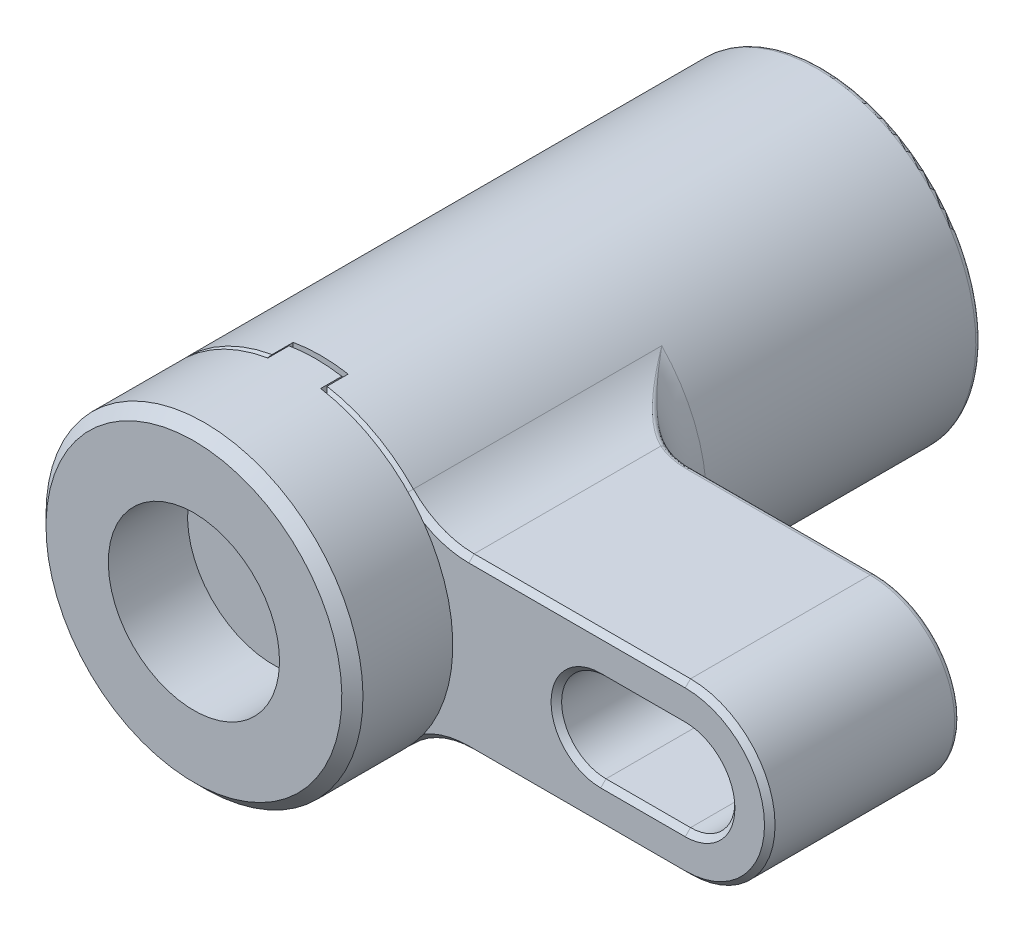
ISO-10303-21;
HEADER;
FILE_DESCRIPTION(('STEP AP214'),'2;1');
FILE_NAME('part.step','',(''),(''),'','','');
FILE_SCHEMA(('AUTOMOTIVE_DESIGN { 1 0 10303 214 1 1 1 1 }'));
ENDSEC;
DATA;
#1=APPLICATION_CONTEXT('core data for automotive mechanical design processes');
#2=APPLICATION_PROTOCOL_DEFINITION('international standard','automotive_design',2000,#1);
#3=PRODUCT_CONTEXT('',#1,'mechanical');
#4=PRODUCT('Part','Part','',(#3));
#5=PRODUCT_RELATED_PRODUCT_CATEGORY('part','',(#4));
#6=PRODUCT_DEFINITION_FORMATION('','',#4);
#7=PRODUCT_DEFINITION_CONTEXT('part definition',#1,'design');
#8=PRODUCT_DEFINITION('design','',#6,#7);
#9=PRODUCT_DEFINITION_SHAPE('','',#8);
#10=(LENGTH_UNIT() NAMED_UNIT(*) SI_UNIT(.MILLI.,.METRE.));
#11=(NAMED_UNIT(*) PLANE_ANGLE_UNIT() SI_UNIT($,.RADIAN.));
#12=(NAMED_UNIT(*) SI_UNIT($,.STERADIAN.) SOLID_ANGLE_UNIT());
#13=UNCERTAINTY_MEASURE_WITH_UNIT(LENGTH_MEASURE(1.E-05),#10,'distance_accuracy_value','');
#14=(GEOMETRIC_REPRESENTATION_CONTEXT(3) GLOBAL_UNCERTAINTY_ASSIGNED_CONTEXT((#13)) GLOBAL_UNIT_ASSIGNED_CONTEXT((#10,
#11,#12)) REPRESENTATION_CONTEXT('',''));
#15=CARTESIAN_POINT('',(0.,0.,0.));
#16=DIRECTION('',(0.,0.,1.));
#17=DIRECTION('',(1.,0.,0.));
#18=AXIS2_PLACEMENT_3D('',#15,#16,#17);
#19=CARTESIAN_POINT('',(2.59999999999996,-5.64670651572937,47.5));
#20=DIRECTION('',(0.,1.,0.));
#21=DIRECTION('',(-1.,0.,0.));
#22=AXIS2_PLACEMENT_3D('',#19,#20,#21);
#23=PLANE('',#22);
#24=DIRECTION('',(-1.,0.,0.));
#25=VECTOR('',#24,1.);
#26=CARTESIAN_POINT('',(2.59999999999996,-5.64670651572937,48.));
#27=LINE('',#26,#25);
#28=CARTESIAN_POINT('',(2.5,-5.64670651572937,48.));
#29=VERTEX_POINT('',#28);
#30=CARTESIAN_POINT('',(1.998595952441,-5.64670651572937,48.));
#31=VERTEX_POINT('',#30);
#32=EDGE_CURVE('E408',#29,#31,#27,.T.);
#33=ORIENTED_EDGE('',*,*,#32,.T.);
#34=DIRECTION('',(0.,0.,-1.));
#35=VECTOR('',#34,1.);
#36=CARTESIAN_POINT('',(1.998595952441,-5.64670651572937,53.));
#37=LINE('',#36,#35);
#38=CARTESIAN_POINT('',(1.998595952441,-5.64670651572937,47.5));
#39=VERTEX_POINT('',#38);
#40=EDGE_CURVE('E37',#31,#39,#37,.T.);
#41=ORIENTED_EDGE('',*,*,#40,.T.);
#42=DIRECTION('',(-1.,0.,0.));
#43=VECTOR('',#42,1.);
#44=CARTESIAN_POINT('',(2.59999999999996,-5.64670651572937,47.5));
#45=LINE('',#44,#43);
#46=CARTESIAN_POINT('',(2.59999999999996,-5.64670651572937,47.5));
#47=VERTEX_POINT('',#46);
#48=EDGE_CURVE('E828',#47,#39,#45,.T.);
#49=ORIENTED_EDGE('',*,*,#48,.F.);
#50=DIRECTION('',(0.,0.,1.));
#51=VECTOR('',#50,1.);
#52=CARTESIAN_POINT('',(2.59999999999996,-5.64670651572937,47.5));
#53=LINE('',#52,#51);
#54=CARTESIAN_POINT('',(2.59999999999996,-5.64670651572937,49.5));
#55=VERTEX_POINT('',#54);
#56=EDGE_CURVE('E838',#47,#55,#53,.T.);
#57=ORIENTED_EDGE('',*,*,#56,.T.);
#58=DIRECTION('',(0.707106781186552,0.,0.707106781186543));
#59=VECTOR('',#58,1.);
#60=CARTESIAN_POINT('',(1.59999999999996,-5.64670651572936,48.5));
#61=LINE('',#60,#59);
#62=CARTESIAN_POINT('',(3.09999999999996,-5.64670651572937,50.));
#63=VERTEX_POINT('',#62);
#64=EDGE_CURVE('E1132',#55,#63,#61,.T.);
#65=ORIENTED_EDGE('',*,*,#64,.T.);
#66=DIRECTION('',(-1.,0.,0.));
#67=VECTOR('',#66,1.);
#68=CARTESIAN_POINT('',(2.59999999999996,-5.64670651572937,50.));
#69=LINE('',#68,#67);
#70=CARTESIAN_POINT('',(2.5,-5.64670651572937,50.));
#71=VERTEX_POINT('',#70);
#72=EDGE_CURVE('E835',#63,#71,#69,.T.);
#73=ORIENTED_EDGE('',*,*,#72,.T.);
#74=DIRECTION('',(0.,0.,1.));
#75=VECTOR('',#74,1.);
#76=CARTESIAN_POINT('',(2.5,-5.64670651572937,47.5));
#77=LINE('',#76,#75);
#78=EDGE_CURVE('E519',#29,#71,#77,.T.);
#79=ORIENTED_EDGE('',*,*,#78,.F.);
#80=EDGE_LOOP('',(#33,#41,#49,#57,#65,#73,#79));
#81=FACE_BOUND('',#80,.T.);
#82=ADVANCED_FACE('F14',(#81),#23,.F.);
#83=CARTESIAN_POINT('',(-2.6,5.64670651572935,47.5));
#84=DIRECTION('',(0.,-1.,0.));
#85=DIRECTION('',(1.,0.,0.));
#86=AXIS2_PLACEMENT_3D('',#83,#84,#85);
#87=PLANE('',#86);
#88=DIRECTION('',(1.,0.,0.));
#89=VECTOR('',#88,1.);
#90=CARTESIAN_POINT('',(-2.6,5.64670651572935,48.));
#91=LINE('',#90,#89);
#92=CARTESIAN_POINT('',(-2.5,5.64670651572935,48.));
#93=VERTEX_POINT('',#92);
#94=CARTESIAN_POINT('',(-1.99859595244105,5.64670651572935,48.));
#95=VERTEX_POINT('',#94);
#96=EDGE_CURVE('E507',#93,#95,#91,.T.);
#97=ORIENTED_EDGE('',*,*,#96,.T.);
#98=DIRECTION('',(0.,0.,-1.));
#99=VECTOR('',#98,1.);
#100=CARTESIAN_POINT('',(-1.99859595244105,5.64670651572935,53.));
#101=LINE('',#100,#99);
#102=CARTESIAN_POINT('',(-1.99859595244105,5.64670651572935,47.5));
#103=VERTEX_POINT('',#102);
#104=EDGE_CURVE('E1361',#95,#103,#101,.T.);
#105=ORIENTED_EDGE('',*,*,#104,.T.);
#106=DIRECTION('',(1.,0.,0.));
#107=VECTOR('',#106,1.);
#108=CARTESIAN_POINT('',(-2.6,5.64670651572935,47.5));
#109=LINE('',#108,#107);
#110=CARTESIAN_POINT('',(-2.6,5.64670651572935,47.5));
#111=VERTEX_POINT('',#110);
#112=EDGE_CURVE('E844',#111,#103,#109,.T.);
#113=ORIENTED_EDGE('',*,*,#112,.F.);
#114=DIRECTION('',(0.,0.,1.));
#115=VECTOR('',#114,1.);
#116=CARTESIAN_POINT('',(-2.6,5.64670651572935,47.5));
#117=LINE('',#116,#115);
#118=CARTESIAN_POINT('',(-2.6,5.64670651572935,49.5));
#119=VERTEX_POINT('',#118);
#120=EDGE_CURVE('E855',#111,#119,#117,.T.);
#121=ORIENTED_EDGE('',*,*,#120,.T.);
#122=DIRECTION('',(-0.707106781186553,0.,0.707106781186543));
#123=VECTOR('',#122,1.);
#124=CARTESIAN_POINT('',(-1.6,5.64670651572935,48.5));
#125=LINE('',#124,#123);
#126=CARTESIAN_POINT('',(-3.1,5.64670651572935,50.));
#127=VERTEX_POINT('',#126);
#128=EDGE_CURVE('E1137',#119,#127,#125,.T.);
#129=ORIENTED_EDGE('',*,*,#128,.T.);
#130=DIRECTION('',(1.,0.,0.));
#131=VECTOR('',#130,1.);
#132=CARTESIAN_POINT('',(-2.6,5.64670651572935,50.));
#133=LINE('',#132,#131);
#134=CARTESIAN_POINT('',(-2.5,5.64670651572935,50.));
#135=VERTEX_POINT('',#134);
#136=EDGE_CURVE('E853',#127,#135,#133,.T.);
#137=ORIENTED_EDGE('',*,*,#136,.T.);
#138=DIRECTION('',(0.,0.,1.));
#139=VECTOR('',#138,1.);
#140=CARTESIAN_POINT('',(-2.5,5.64670651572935,47.5));
#141=LINE('',#140,#139);
#142=EDGE_CURVE('E421',#93,#135,#141,.T.);
#143=ORIENTED_EDGE('',*,*,#142,.F.);
#144=EDGE_LOOP('',(#97,#105,#113,#121,#129,#137,#143));
#145=FACE_BOUND('',#144,.T.);
#146=ADVANCED_FACE('F1511',(#145),#87,.F.);
#147=CARTESIAN_POINT('',(0.,0.,50.));
#148=DIRECTION('',(0.,0.,-1.));
#149=DIRECTION('',(0.,-1.,0.));
#150=AXIS2_PLACEMENT_3D('',#147,#148,#149);
#151=CYLINDRICAL_SURFACE('',#150,15.);
#152=CARTESIAN_POINT('',(-14.9596122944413,-1.09999999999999,43.25));
#153=CARTESIAN_POINT('',(-14.8861745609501,-2.09786530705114,42.673882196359));
#154=CARTESIAN_POINT('',(-14.6812686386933,-3.07576838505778,42.1092895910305));
#155=CARTESIAN_POINT('',(-14.4762655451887,-4.05413520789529,41.5444292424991));
#156=CARTESIAN_POINT('',(-14.1431555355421,-4.99711431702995,41.));
#157=B_SPLINE_CURVE_WITH_KNOTS('',2,(#152,#153,#154,#155,#156),.UNSPECIFIED.,.F.,.F.,(3,2,3),
(0.,0.5,1.),.UNSPECIFIED.);
#158=CARTESIAN_POINT('',(-14.9596122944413,-1.1,43.25));
#159=VERTEX_POINT('',#158);
#160=CARTESIAN_POINT('',(-14.1431555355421,-4.99711431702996,41.));
#161=VERTEX_POINT('',#160);
#162=EDGE_CURVE('E475',#159,#161,#157,.T.);
#163=ORIENTED_EDGE('',*,*,#162,.F.);
#164=DIRECTION('',(0.,0.,-1.));
#165=VECTOR('',#164,1.);
#166=CARTESIAN_POINT('',(-14.9596122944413,-1.1,50.));
#167=LINE('',#166,#165);
#168=CARTESIAN_POINT('',(-14.9596122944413,-1.1,42.25));
#169=VERTEX_POINT('',#168);
#170=EDGE_CURVE('E1395',#159,#169,#167,.T.);
#171=ORIENTED_EDGE('',*,*,#170,.T.);
#172=CARTESIAN_POINT('',(0.,0.,42.25));
#173=DIRECTION('',(0.,0.,1.));
#174=DIRECTION('',(0.,1.,0.));
#175=AXIS2_PLACEMENT_3D('',#172,#173,#174);
#176=CIRCLE('',#175,15.);
#177=CARTESIAN_POINT('',(-14.1421356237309,5.,42.25));
#178=VERTEX_POINT('',#177);
#179=EDGE_CURVE('E1370',#178,#169,#176,.T.);
#180=ORIENTED_EDGE('',*,*,#179,.F.);
#181=DIRECTION('',(0.,0.,-1.));
#182=VECTOR('',#181,1.);
#183=CARTESIAN_POINT('',(-14.1421356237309,5.,50.));
#184=LINE('',#183,#182);
#185=CARTESIAN_POINT('',(-14.1421356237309,5.,39.75));
#186=VERTEX_POINT('',#185);
#187=EDGE_CURVE('E1380',#178,#186,#184,.T.);
#188=ORIENTED_EDGE('',*,*,#187,.T.);
#189=CARTESIAN_POINT('',(0.,0.,39.75));
#190=DIRECTION('',(0.,0.,-1.));
#191=DIRECTION('',(0.,-1.,0.));
#192=AXIS2_PLACEMENT_3D('',#189,#190,#191);
#193=CIRCLE('',#192,15.);
#194=CARTESIAN_POINT('',(-14.9596122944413,-1.1,39.75));
#195=VERTEX_POINT('',#194);
#196=EDGE_CURVE('E1378',#195,#186,#193,.T.);
#197=ORIENTED_EDGE('',*,*,#196,.F.);
#198=DIRECTION('',(0.,0.,-1.));
#199=VECTOR('',#198,1.);
#200=CARTESIAN_POINT('',(-14.9596122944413,-1.1,50.));
#201=LINE('',#200,#199);
#202=CARTESIAN_POINT('',(-14.9596122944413,-1.1,38.75));
#203=VERTEX_POINT('',#202);
#204=EDGE_CURVE('E1388',#195,#203,#201,.T.);
#205=ORIENTED_EDGE('',*,*,#204,.T.);
#206=CARTESIAN_POINT('',(-14.1431555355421,-4.99711431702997,41.));
#207=CARTESIAN_POINT('',(-14.4764247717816,-4.05368446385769,40.4553105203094));
#208=CARTESIAN_POINT('',(-14.6812686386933,-3.0757683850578,39.8907104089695));
#209=CARTESIAN_POINT('',(-14.8862096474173,-2.09738855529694,39.3258425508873));
#210=CARTESIAN_POINT('',(-14.9596122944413,-1.1,38.75));
#211=B_SPLINE_CURVE_WITH_KNOTS('',2,(#206,#207,#208,#209,#210),.UNSPECIFIED.,.F.,.F.,(3,2,3),
(0.,0.5,1.),.UNSPECIFIED.);
#212=EDGE_CURVE('E1412',#161,#203,#211,.T.);
#213=ORIENTED_EDGE('',*,*,#212,.F.);
#214=EDGE_LOOP('',(#163,#171,#180,#188,#197,#205,#213));
#215=FACE_BOUND('',#214,.T.);
#216=ADVANCED_FACE('F615',(#215),#151,.T.);
#217=CARTESIAN_POINT('',(0.,0.,1.5));
#218=DIRECTION('',(0.,0.,1.));
#219=DIRECTION('',(0.,1.,0.));
#220=AXIS2_PLACEMENT_3D('',#217,#218,#219);
#221=TOROIDAL_SURFACE('',#220,11.5,1.5);
#222=CARTESIAN_POINT('',(0.,0.,1.5));
#223=DIRECTION('',(0.,0.,1.));
#224=DIRECTION('',(0.,1.,0.));
#225=AXIS2_PLACEMENT_3D('',#222,#223,#224);
#226=CIRCLE('',#225,10.);
#227=CARTESIAN_POINT('',(0.,10.,1.5));
#228=VERTEX_POINT('',#227);
#229=EDGE_CURVE('E523',#228,#228,#226,.F.);
#230=ORIENTED_EDGE('',*,*,#229,.F.);
#231=EDGE_LOOP('',(#230));
#232=FACE_BOUND('',#231,.T.);
#233=CARTESIAN_POINT('',(0.,0.,0.));
#234=DIRECTION('',(0.,0.,1.));
#235=DIRECTION('',(0.,1.,0.));
#236=AXIS2_PLACEMENT_3D('',#233,#234,#235);
#237=CIRCLE('',#236,11.5);
#238=CARTESIAN_POINT('',(0.,11.5,0.));
#239=VERTEX_POINT('',#238);
#240=EDGE_CURVE('E1282',#239,#239,#237,.T.);
#241=ORIENTED_EDGE('',*,*,#240,.F.);
#242=EDGE_LOOP('',(#241));
#243=FACE_BOUND('',#242,.T.);
#244=ADVANCED_FACE('F1314',(#232,#243),#221,.T.);
#245=CARTESIAN_POINT('',(0.,0.,32.));
#246=DIRECTION('',(0.,0.,1.));
#247=DIRECTION('',(0.,1.,0.));
#248=AXIS2_PLACEMENT_3D('',#245,#246,#247);
#249=CYLINDRICAL_SURFACE('',#248,10.);
#250=ORIENTED_EDGE('',*,*,#229,.T.);
#251=EDGE_LOOP('',(#250));
#252=FACE_BOUND('',#251,.T.);
#253=CARTESIAN_POINT('',(0.,0.,31.));
#254=DIRECTION('',(0.,0.,1.));
#255=DIRECTION('',(0.,1.,0.));
#256=AXIS2_PLACEMENT_3D('',#253,#254,#255);
#257=CIRCLE('',#256,10.);
#258=CARTESIAN_POINT('',(0.,10.,31.));
#259=VERTEX_POINT('',#258);
#260=EDGE_CURVE('E864',#259,#259,#257,.T.);
#261=ORIENTED_EDGE('',*,*,#260,.T.);
#262=EDGE_LOOP('',(#261));
#263=FACE_BOUND('',#262,.T.);
#264=ADVANCED_FACE('F1311',(#252,#263),#249,.F.);
#265=CARTESIAN_POINT('',(-5.25,0.,31.));
#266=DIRECTION('',(0.,0.,-1.));
#267=DIRECTION('',(0.,-1.,0.));
#268=AXIS2_PLACEMENT_3D('',#265,#266,#267);
#269=PLANE('',#268);
#270=ORIENTED_EDGE('',*,*,#260,.F.);
#271=EDGE_LOOP('',(#270));
#272=FACE_BOUND('',#271,.T.);
#273=ADVANCED_FACE('F1501',(#272),#269,.T.);
#274=CARTESIAN_POINT('',(-13.8421356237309,5.,50.));
#275=DIRECTION('',(0.,1.,0.));
#276=DIRECTION('',(-1.,0.,0.));
#277=AXIS2_PLACEMENT_3D('',#274,#275,#276);
#278=PLANE('',#277);
#279=ORIENTED_EDGE('',*,*,#187,.F.);
#280=DIRECTION('',(-1.,0.,0.));
#281=VECTOR('',#280,1.);
#282=CARTESIAN_POINT('',(-13.8421356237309,5.,42.25));
#283=LINE('',#282,#281);
#284=CARTESIAN_POINT('',(-13.8421356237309,5.,42.25));
#285=VERTEX_POINT('',#284);
#286=EDGE_CURVE('E1373',#285,#178,#283,.T.);
#287=ORIENTED_EDGE('',*,*,#286,.F.);
#288=DIRECTION('',(0.,0.,-1.));
#289=VECTOR('',#288,1.);
#290=CARTESIAN_POINT('',(-13.8421356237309,5.,50.));
#291=LINE('',#290,#289);
#292=CARTESIAN_POINT('',(-13.8421356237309,5.,39.75));
#293=VERTEX_POINT('',#292);
#294=EDGE_CURVE('E1371',#285,#293,#291,.T.);
#295=ORIENTED_EDGE('',*,*,#294,.T.);
#296=DIRECTION('',(-1.,0.,0.));
#297=VECTOR('',#296,1.);
#298=CARTESIAN_POINT('',(-13.8421356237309,5.,39.75));
#299=LINE('',#298,#297);
#300=EDGE_CURVE('E1377',#293,#186,#299,.T.);
#301=ORIENTED_EDGE('',*,*,#300,.T.);
#302=EDGE_LOOP('',(#279,#287,#295,#301));
#303=FACE_BOUND('',#302,.T.);
#304=ADVANCED_FACE('F1472',(#303),#278,.T.);
#305=CARTESIAN_POINT('',(-13.8421356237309,5.,39.75));
#306=DIRECTION('',(0.,0.,1.));
#307=DIRECTION('',(0.,1.,0.));
#308=AXIS2_PLACEMENT_3D('',#305,#306,#307);
#309=PLANE('',#308);
#310=ORIENTED_EDGE('',*,*,#196,.T.);
#311=ORIENTED_EDGE('',*,*,#300,.F.);
#312=CARTESIAN_POINT('',(0.3,0.,39.75));
#313=DIRECTION('',(0.,0.,-1.));
#314=DIRECTION('',(0.,-1.,0.));
#315=AXIS2_PLACEMENT_3D('',#312,#313,#314);
#316=CIRCLE('',#315,15.);
#317=CARTESIAN_POINT('',(-14.6596122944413,-1.1,39.75));
#318=VERTEX_POINT('',#317);
#319=EDGE_CURVE('E1374',#318,#293,#316,.T.);
#320=ORIENTED_EDGE('',*,*,#319,.F.);
#321=DIRECTION('',(-1.,0.,0.));
#322=VECTOR('',#321,1.);
#323=CARTESIAN_POINT('',(-14.6596122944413,-1.1,39.75));
#324=LINE('',#323,#322);
#325=EDGE_CURVE('E1385',#318,#195,#324,.T.);
#326=ORIENTED_EDGE('',*,*,#325,.T.);
#327=EDGE_LOOP('',(#310,#311,#320,#326));
#328=FACE_BOUND('',#327,.T.);
#329=ADVANCED_FACE('F1462',(#328),#309,.F.);
#330=CARTESIAN_POINT('',(-14.6596122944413,-1.1,50.));
#331=DIRECTION('',(0.,1.,0.));
#332=DIRECTION('',(-1.,0.,0.));
#333=AXIS2_PLACEMENT_3D('',#330,#331,#332);
#334=PLANE('',#333);
#335=ORIENTED_EDGE('',*,*,#204,.F.);
#336=ORIENTED_EDGE('',*,*,#325,.F.);
#337=DIRECTION('',(0.,0.,-1.));
#338=VECTOR('',#337,1.);
#339=CARTESIAN_POINT('',(-14.6596122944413,-1.1,50.));
#340=LINE('',#339,#338);
#341=CARTESIAN_POINT('',(-14.6596122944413,-1.1,38.75));
#342=VERTEX_POINT('',#341);
#343=EDGE_CURVE('E1384',#318,#342,#340,.T.);
#344=ORIENTED_EDGE('',*,*,#343,.T.);
#345=DIRECTION('',(-1.,0.,0.));
#346=VECTOR('',#345,1.);
#347=CARTESIAN_POINT('',(-14.6596122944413,-1.1,38.75));
#348=LINE('',#347,#346);
#349=EDGE_CURVE('E1455',#342,#203,#348,.T.);
#350=ORIENTED_EDGE('',*,*,#349,.T.);
#351=EDGE_LOOP('',(#335,#336,#344,#350));
#352=FACE_BOUND('',#351,.T.);
#353=ADVANCED_FACE('F1459',(#352),#334,.T.);
#354=CARTESIAN_POINT('',(-14.6596122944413,-1.1,38.75));
#355=DIRECTION('',(0.,0.5,0.866025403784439));
#356=DIRECTION('',(0.,0.866025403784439,-0.5));
#357=AXIS2_PLACEMENT_3D('',#354,#355,#356);
#358=PLANE('',#357);
#359=ORIENTED_EDGE('',*,*,#212,.T.);
#360=ORIENTED_EDGE('',*,*,#349,.F.);
#361=CARTESIAN_POINT('',(-13.8431555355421,-4.99711431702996,41.));
#362=CARTESIAN_POINT('',(-13.8953608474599,-4.84935928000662,40.9146890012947));
#363=CARTESIAN_POINT('',(-13.9451838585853,-4.7009758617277,40.8290100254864));
#364=CARTESIAN_POINT('',(-14.0421771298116,-4.396432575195,40.6531634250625));
#365=CARTESIAN_POINT('',(-14.0891302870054,-4.24022079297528,40.5629658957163));
#366=CARTESIAN_POINT('',(-14.1797263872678,-3.91999750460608,40.3780827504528));
#367=CARTESIAN_POINT('',(-14.2231425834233,-3.75593761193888,40.2833698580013));
#368=CARTESIAN_POINT('',(-14.3059764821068,-3.42002716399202,40.0894563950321));
#369=CARTESIAN_POINT('',(-14.3451577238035,-3.24813263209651,39.9902308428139));
#370=CARTESIAN_POINT('',(-14.4113800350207,-2.93204097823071,39.8077244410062));
#371=CARTESIAN_POINT('',(-14.4393565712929,-2.78798696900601,39.7245334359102));
#372=CARTESIAN_POINT('',(-14.4933895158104,-2.48620353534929,39.5502596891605));
#373=CARTESIAN_POINT('',(-14.5190412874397,-2.32841940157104,39.4591458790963));
#374=CARTESIAN_POINT('',(-14.5671929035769,-1.99912909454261,39.2690270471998));
#375=CARTESIAN_POINT('',(-14.5892529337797,-1.82757347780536,39.1699961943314));
#376=CARTESIAN_POINT('',(-14.6288813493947,-1.4707662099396,38.9640330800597));
#377=CARTESIAN_POINT('',(-14.6459745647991,-1.2854747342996,38.8570781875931));
#378=CARTESIAN_POINT('',(-14.6596122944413,-1.09999999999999,38.75));
#379=B_SPLINE_CURVE_WITH_KNOTS('',3,(#361,#362,#363,#364,#365,#366,#367,#368,#369,#370,#371,
#372,#373,#374,#375,#376,#377,#378),.UNSPECIFIED.,.F.,.F.,(4,2,2,2,2,2,2,2,4),(0.,
0.535252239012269,1.09435290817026,1.67731125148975,2.28413539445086,2.79014091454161,
3.34206516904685,3.93990998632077,4.58367659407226),.UNSPECIFIED.);
#380=CARTESIAN_POINT('',(-13.8431555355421,-4.99711431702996,41.));
#381=VERTEX_POINT('',#380);
#382=EDGE_CURVE('E584',#381,#342,#379,.T.);
#383=ORIENTED_EDGE('',*,*,#382,.F.);
#384=DIRECTION('',(-1.,0.,0.));
#385=VECTOR('',#384,1.);
#386=CARTESIAN_POINT('',(-13.8431555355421,-4.99711431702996,41.));
#387=LINE('',#386,#385);
#388=EDGE_CURVE('E1440',#381,#161,#387,.T.);
#389=ORIENTED_EDGE('',*,*,#388,.T.);
#390=EDGE_LOOP('',(#359,#360,#383,#389));
#391=FACE_BOUND('',#390,.T.);
#392=ADVANCED_FACE('F1444',(#391),#358,.F.);
#393=CARTESIAN_POINT('',(-13.8431555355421,-4.99711431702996,41.));
#394=DIRECTION('',(0.,0.5,-0.866025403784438));
#395=DIRECTION('',(0.,-0.866025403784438,-0.5));
#396=AXIS2_PLACEMENT_3D('',#393,#394,#395);
#397=PLANE('',#396);
#398=ORIENTED_EDGE('',*,*,#162,.T.);
#399=ORIENTED_EDGE('',*,*,#388,.F.);
#400=CARTESIAN_POINT('',(-14.6596122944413,-1.09999999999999,43.25));
#401=CARTESIAN_POINT('',(-14.6459740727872,-1.28548142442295,43.1429179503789));
#402=CARTESIAN_POINT('',(-14.6288801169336,-1.47077956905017,43.0359591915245));
#403=CARTESIAN_POINT('',(-14.5892502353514,-1.82759567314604,42.8299909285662));
#404=CARTESIAN_POINT('',(-14.5671896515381,-1.99915347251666,42.7309587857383));
#405=CARTESIAN_POINT('',(-14.5190374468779,-2.3284436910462,42.5408399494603));
#406=CARTESIAN_POINT('',(-14.4933857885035,-2.48622557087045,42.449727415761));
#407=CARTESIAN_POINT('',(-14.4393540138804,-2.7880001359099,42.2754588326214));
#408=CARTESIAN_POINT('',(-14.411378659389,-2.93204754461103,42.1922716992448));
#409=CARTESIAN_POINT('',(-14.3451568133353,-3.24813697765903,42.0097667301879));
#410=CARTESIAN_POINT('',(-14.3059745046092,-3.42003583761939,41.9105387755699));
#411=CARTESIAN_POINT('',(-14.2231388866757,-3.75595197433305,41.7166221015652));
#412=CARTESIAN_POINT('',(-14.1797221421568,-3.92001324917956,41.6219083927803));
#413=CARTESIAN_POINT('',(-14.0891256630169,-4.24023642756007,41.4370252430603));
#414=CARTESIAN_POINT('',(-14.0421727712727,-4.39644673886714,41.3468285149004));
#415=CARTESIAN_POINT('',(-13.9451810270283,-4.70098429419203,41.1709851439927));
#416=CARTESIAN_POINT('',(-13.8953593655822,-4.84936347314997,41.0853085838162));
#417=CARTESIAN_POINT('',(-13.8431555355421,-4.99711431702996,41.));
#418=B_SPLINE_CURVE_WITH_KNOTS('',3,(#400,#401,#402,#403,#404,#405,#406,#407,#408,#409,#410,
#411,#412,#413,#414,#415,#416,#417),.UNSPECIFIED.,.F.,.F.,(4,2,2,2,2,2,2,2,4),(0.,
0.643789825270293,1.2416423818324,1.79355889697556,2.2995411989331,2.90638052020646,
3.48934392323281,4.04843953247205,4.58367659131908),.UNSPECIFIED.);
#419=CARTESIAN_POINT('',(-14.6596122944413,-1.1,43.25));
#420=VERTEX_POINT('',#419);
#421=EDGE_CURVE('E1448',#420,#381,#418,.T.);
#422=ORIENTED_EDGE('',*,*,#421,.F.);
#423=DIRECTION('',(-1.,0.,0.));
#424=VECTOR('',#423,1.);
#425=CARTESIAN_POINT('',(-14.6596122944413,-1.1,43.25));
#426=LINE('',#425,#424);
#427=EDGE_CURVE('E1442',#420,#159,#426,.T.);
#428=ORIENTED_EDGE('',*,*,#427,.T.);
#429=EDGE_LOOP('',(#398,#399,#422,#428));
#430=FACE_BOUND('',#429,.T.);
#431=ADVANCED_FACE('F1439',(#430),#397,.F.);
#432=CARTESIAN_POINT('',(-14.6596122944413,-1.1,50.));
#433=DIRECTION('',(0.,1.,0.));
#434=DIRECTION('',(-1.,0.,0.));
#435=AXIS2_PLACEMENT_3D('',#432,#433,#434);
#436=PLANE('',#435);
#437=ORIENTED_EDGE('',*,*,#170,.F.);
#438=ORIENTED_EDGE('',*,*,#427,.F.);
#439=DIRECTION('',(0.,0.,-1.));
#440=VECTOR('',#439,1.);
#441=CARTESIAN_POINT('',(-14.6596122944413,-1.1,50.));
#442=LINE('',#441,#440);
#443=CARTESIAN_POINT('',(-14.6596122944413,-1.1,42.25));
#444=VERTEX_POINT('',#443);
#445=EDGE_CURVE('E812',#420,#444,#442,.T.);
#446=ORIENTED_EDGE('',*,*,#445,.T.);
#447=DIRECTION('',(-1.,0.,0.));
#448=VECTOR('',#447,1.);
#449=CARTESIAN_POINT('',(-14.6596122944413,-1.1,42.25));
#450=LINE('',#449,#448);
#451=EDGE_CURVE('E1369',#444,#169,#450,.T.);
#452=ORIENTED_EDGE('',*,*,#451,.T.);
#453=EDGE_LOOP('',(#437,#438,#446,#452));
#454=FACE_BOUND('',#453,.T.);
#455=ADVANCED_FACE('F1474',(#454),#436,.T.);
#456=CARTESIAN_POINT('',(-14.6596122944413,-1.1,42.25));
#457=DIRECTION('',(0.,0.,-1.));
#458=DIRECTION('',(0.,-1.,0.));
#459=AXIS2_PLACEMENT_3D('',#456,#457,#458);
#460=PLANE('',#459);
#461=ORIENTED_EDGE('',*,*,#179,.T.);
#462=ORIENTED_EDGE('',*,*,#451,.F.);
#463=CARTESIAN_POINT('',(0.3,0.,42.25));
#464=DIRECTION('',(0.,0.,1.));
#465=DIRECTION('',(0.,1.,0.));
#466=AXIS2_PLACEMENT_3D('',#463,#464,#465);
#467=CIRCLE('',#466,15.);
#468=EDGE_CURVE('E1366',#285,#444,#467,.T.);
#469=ORIENTED_EDGE('',*,*,#468,.F.);
#470=ORIENTED_EDGE('',*,*,#286,.T.);
#471=EDGE_LOOP('',(#461,#462,#469,#470));
#472=FACE_BOUND('',#471,.T.);
#473=ADVANCED_FACE('F1469',(#472),#460,.F.);
#474=CARTESIAN_POINT('',(0.,-4.7,32.5));
#475=DIRECTION('',(1.,0.,0.));
#476=DIRECTION('',(0.,1.,0.));
#477=AXIS2_PLACEMENT_3D('',#474,#475,#476);
#478=CYLINDRICAL_SURFACE('',#477,0.5);
#479=CARTESIAN_POINT('',(29.,-4.7,32.5));
#480=DIRECTION('',(1.,0.,0.));
#481=DIRECTION('',(0.,1.,0.));
#482=AXIS2_PLACEMENT_3D('',#479,#480,#481);
#483=CIRCLE('',#482,0.5);
#484=CARTESIAN_POINT('',(29.,-4.7,32.));
#485=VERTEX_POINT('',#484);
#486=CARTESIAN_POINT('',(29.,-4.2,32.5));
#487=VERTEX_POINT('',#486);
#488=EDGE_CURVE('E1102',#485,#487,#483,.T.);
#489=ORIENTED_EDGE('',*,*,#488,.T.);
#490=DIRECTION('',(1.,0.,0.));
#491=VECTOR('',#490,1.);
#492=CARTESIAN_POINT('',(29.,-4.2,32.5));
#493=LINE('',#492,#491);
#494=CARTESIAN_POINT('',(37.,-4.2,32.5));
#495=VERTEX_POINT('',#494);
#496=EDGE_CURVE('E1090',#495,#487,#493,.F.);
#497=ORIENTED_EDGE('',*,*,#496,.F.);
#498=CARTESIAN_POINT('',(37.,-4.7,32.5));
#499=DIRECTION('',(-1.,0.,0.));
#500=DIRECTION('',(0.,-1.,0.));
#501=AXIS2_PLACEMENT_3D('',#498,#499,#500);
#502=CIRCLE('',#501,0.5);
#503=CARTESIAN_POINT('',(37.,-4.7,32.));
#504=VERTEX_POINT('',#503);
#505=EDGE_CURVE('E1100',#495,#504,#502,.T.);
#506=ORIENTED_EDGE('',*,*,#505,.T.);
#507=DIRECTION('',(1.,0.,0.));
#508=VECTOR('',#507,1.);
#509=CARTESIAN_POINT('',(0.,-4.7,32.));
#510=LINE('',#509,#508);
#511=EDGE_CURVE('E1088',#485,#504,#510,.T.);
#512=ORIENTED_EDGE('',*,*,#511,.F.);
#513=EDGE_LOOP('',(#489,#497,#506,#512));
#514=FACE_BOUND('',#513,.T.);
#515=ADVANCED_FACE('F1503',(#514),#478,.T.);
#516=CARTESIAN_POINT('',(37.,0.,32.5));
#517=DIRECTION('',(0.,0.,1.));
#518=DIRECTION('',(0.,1.,0.));
#519=AXIS2_PLACEMENT_3D('',#516,#517,#518);
#520=TOROIDAL_SURFACE('',#519,4.7,0.5);
#521=CARTESIAN_POINT('',(37.,4.7,32.5));
#522=DIRECTION('',(1.,0.,0.));
#523=DIRECTION('',(0.,1.,0.));
#524=AXIS2_PLACEMENT_3D('',#521,#522,#523);
#525=CIRCLE('',#524,0.5);
#526=CARTESIAN_POINT('',(37.,4.2,32.5));
#527=VERTEX_POINT('',#526);
#528=CARTESIAN_POINT('',(37.,4.7,32.));
#529=VERTEX_POINT('',#528);
#530=EDGE_CURVE('E1105',#527,#529,#525,.T.);
#531=ORIENTED_EDGE('',*,*,#530,.T.);
#532=CARTESIAN_POINT('',(37.,0.,32.));
#533=DIRECTION('',(0.,0.,1.));
#534=DIRECTION('',(0.,1.,0.));
#535=AXIS2_PLACEMENT_3D('',#532,#533,#534);
#536=CIRCLE('',#535,4.7);
#537=EDGE_CURVE('E1074',#504,#529,#536,.T.);
#538=ORIENTED_EDGE('',*,*,#537,.F.);
#539=ORIENTED_EDGE('',*,*,#505,.F.);
#540=CARTESIAN_POINT('',(37.,0.,32.5));
#541=DIRECTION('',(0.,0.,1.));
#542=DIRECTION('',(0.,1.,0.));
#543=AXIS2_PLACEMENT_3D('',#540,#541,#542);
#544=CIRCLE('',#543,4.2);
#545=EDGE_CURVE('E1097',#527,#495,#544,.F.);
#546=ORIENTED_EDGE('',*,*,#545,.F.);
#547=EDGE_LOOP('',(#531,#538,#539,#546));
#548=FACE_BOUND('',#547,.T.);
#549=ADVANCED_FACE('F1735',(#548),#520,.T.);
#550=CARTESIAN_POINT('',(0.,4.7,32.5));
#551=DIRECTION('',(-1.,0.,0.));
#552=DIRECTION('',(0.,-1.,0.));
#553=AXIS2_PLACEMENT_3D('',#550,#551,#552);
#554=CYLINDRICAL_SURFACE('',#553,0.5);
#555=ORIENTED_EDGE('',*,*,#530,.F.);
#556=DIRECTION('',(-1.,0.,0.));
#557=VECTOR('',#556,1.);
#558=CARTESIAN_POINT('',(29.,4.2,32.5));
#559=LINE('',#558,#557);
#560=CARTESIAN_POINT('',(29.,4.2,32.5));
#561=VERTEX_POINT('',#560);
#562=EDGE_CURVE('E1095',#561,#527,#559,.F.);
#563=ORIENTED_EDGE('',*,*,#562,.F.);
#564=CARTESIAN_POINT('',(29.,4.7,32.5));
#565=DIRECTION('',(-1.,0.,0.));
#566=DIRECTION('',(0.,-1.,0.));
#567=AXIS2_PLACEMENT_3D('',#564,#565,#566);
#568=CIRCLE('',#567,0.5);
#569=CARTESIAN_POINT('',(29.,4.7,32.));
#570=VERTEX_POINT('',#569);
#571=EDGE_CURVE('E1108',#570,#561,#568,.T.);
#572=ORIENTED_EDGE('',*,*,#571,.F.);
#573=DIRECTION('',(-1.,0.,0.));
#574=VECTOR('',#573,1.);
#575=CARTESIAN_POINT('',(0.,4.7,32.));
#576=LINE('',#575,#574);
#577=EDGE_CURVE('E1079',#529,#570,#576,.T.);
#578=ORIENTED_EDGE('',*,*,#577,.F.);
#579=EDGE_LOOP('',(#555,#563,#572,#578));
#580=FACE_BOUND('',#579,.T.);
#581=ADVANCED_FACE('F1738',(#580),#554,.T.);
#582=CARTESIAN_POINT('',(29.,0.,32.5));
#583=DIRECTION('',(0.,0.,1.));
#584=DIRECTION('',(0.,1.,0.));
#585=AXIS2_PLACEMENT_3D('',#582,#583,#584);
#586=TOROIDAL_SURFACE('',#585,4.7,0.5);
#587=ORIENTED_EDGE('',*,*,#571,.T.);
#588=CARTESIAN_POINT('',(29.,0.,32.5));
#589=DIRECTION('',(0.,0.,1.));
#590=DIRECTION('',(0.,1.,0.));
#591=AXIS2_PLACEMENT_3D('',#588,#589,#590);
#592=CIRCLE('',#591,4.2);
#593=EDGE_CURVE('E1093',#487,#561,#592,.F.);
#594=ORIENTED_EDGE('',*,*,#593,.F.);
#595=ORIENTED_EDGE('',*,*,#488,.F.);
#596=CARTESIAN_POINT('',(29.,0.,32.));
#597=DIRECTION('',(0.,0.,1.));
#598=DIRECTION('',(0.,1.,0.));
#599=AXIS2_PLACEMENT_3D('',#596,#597,#598);
#600=CIRCLE('',#599,4.7);
#601=EDGE_CURVE('E1084',#570,#485,#600,.T.);
#602=ORIENTED_EDGE('',*,*,#601,.F.);
#603=EDGE_LOOP('',(#587,#594,#595,#602));
#604=FACE_BOUND('',#603,.T.);
#605=ADVANCED_FACE('F1007',(#604),#586,.T.);
#606=CARTESIAN_POINT('',(37.,0.,32.5));
#607=DIRECTION('',(0.,0.,1.));
#608=DIRECTION('',(0.,1.,0.));
#609=AXIS2_PLACEMENT_3D('',#606,#607,#608);
#610=TOROIDAL_SURFACE('',#609,7.5,0.5);
#611=CARTESIAN_POINT('',(37.,7.5,32.5));
#612=DIRECTION('',(1.,0.,0.));
#613=DIRECTION('',(0.,1.,0.));
#614=AXIS2_PLACEMENT_3D('',#611,#612,#613);
#615=CIRCLE('',#614,0.5);
#616=CARTESIAN_POINT('',(37.,7.5,32.));
#617=VERTEX_POINT('',#616);
#618=CARTESIAN_POINT('',(37.,8.,32.5));
#619=VERTEX_POINT('',#618);
#620=EDGE_CURVE('E1594',#617,#619,#615,.T.);
#621=ORIENTED_EDGE('',*,*,#620,.T.);
#622=CARTESIAN_POINT('',(37.,0.,32.5));
#623=DIRECTION('',(0.,0.,1.));
#624=DIRECTION('',(0.,1.,0.));
#625=AXIS2_PLACEMENT_3D('',#622,#623,#624);
#626=CIRCLE('',#625,8.);
#627=CARTESIAN_POINT('',(37.,-8.,32.5));
#628=VERTEX_POINT('',#627);
#629=EDGE_CURVE('E1072',#628,#619,#626,.T.);
#630=ORIENTED_EDGE('',*,*,#629,.F.);
#631=CARTESIAN_POINT('',(37.,-7.5,32.5));
#632=DIRECTION('',(-1.,0.,0.));
#633=DIRECTION('',(0.,-1.,0.));
#634=AXIS2_PLACEMENT_3D('',#631,#632,#633);
#635=CIRCLE('',#634,0.5);
#636=CARTESIAN_POINT('',(37.,-7.5,32.));
#637=VERTEX_POINT('',#636);
#638=EDGE_CURVE('E994',#637,#628,#635,.T.);
#639=ORIENTED_EDGE('',*,*,#638,.F.);
#640=CARTESIAN_POINT('',(37.,0.,32.));
#641=DIRECTION('',(0.,0.,1.));
#642=DIRECTION('',(0.,1.,0.));
#643=AXIS2_PLACEMENT_3D('',#640,#641,#642);
#644=CIRCLE('',#643,7.5);
#645=EDGE_CURVE('E1582',#617,#637,#644,.F.);
#646=ORIENTED_EDGE('',*,*,#645,.F.);
#647=EDGE_LOOP('',(#621,#630,#639,#646));
#648=FACE_BOUND('',#647,.T.);
#649=ADVANCED_FACE('F1004',(#648),#610,.T.);
#650=CARTESIAN_POINT('',(12.6885775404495,7.5,32.5));
#651=DIRECTION('',(-1.,0.,0.));
#652=DIRECTION('',(0.,-1.,0.));
#653=AXIS2_PLACEMENT_3D('',#650,#651,#652);
#654=CYLINDRICAL_SURFACE('',#653,0.5);
#655=CARTESIAN_POINT('',(19.615045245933,7.5,32.5));
#656=DIRECTION('',(1.,0.,0.));
#657=DIRECTION('',(0.,1.,0.));
#658=AXIS2_PLACEMENT_3D('',#655,#656,#657);
#659=CIRCLE('',#658,0.5);
#660=CARTESIAN_POINT('',(19.6150452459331,7.5,32.));
#661=VERTEX_POINT('',#660);
#662=CARTESIAN_POINT('',(19.615045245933,8.,32.5));
#663=VERTEX_POINT('',#662);
#664=EDGE_CURVE('E1633',#661,#663,#659,.T.);
#665=ORIENTED_EDGE('',*,*,#664,.T.);
#666=DIRECTION('',(-1.,0.,0.));
#667=VECTOR('',#666,1.);
#668=CARTESIAN_POINT('',(12.6885775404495,8.,32.5));
#669=LINE('',#668,#667);
#670=EDGE_CURVE('E1063',#619,#663,#669,.T.);
#671=ORIENTED_EDGE('',*,*,#670,.F.);
#672=ORIENTED_EDGE('',*,*,#620,.F.);
#673=DIRECTION('',(-1.,0.,0.));
#674=VECTOR('',#673,1.);
#675=CARTESIAN_POINT('',(0.,7.5,32.));
#676=LINE('',#675,#674);
#677=EDGE_CURVE('E1587',#661,#617,#676,.F.);
#678=ORIENTED_EDGE('',*,*,#677,.F.);
#679=EDGE_LOOP('',(#665,#671,#672,#678));
#680=FACE_BOUND('',#679,.T.);
#681=ADVANCED_FACE('F1002',(#680),#654,.T.);
#682=CARTESIAN_POINT('',(12.6885775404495,-7.5,32.5));
#683=DIRECTION('',(1.,0.,0.));
#684=DIRECTION('',(0.,1.,0.));
#685=AXIS2_PLACEMENT_3D('',#682,#683,#684);
#686=CYLINDRICAL_SURFACE('',#685,0.5);
#687=ORIENTED_EDGE('',*,*,#638,.T.);
#688=DIRECTION('',(1.,0.,0.));
#689=VECTOR('',#688,1.);
#690=CARTESIAN_POINT('',(12.6885775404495,-8.,32.5));
#691=LINE('',#690,#689);
#692=CARTESIAN_POINT('',(19.6150452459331,-8.,32.5));
#693=VERTEX_POINT('',#692);
#694=EDGE_CURVE('E1604',#693,#628,#691,.T.);
#695=ORIENTED_EDGE('',*,*,#694,.F.);
#696=CARTESIAN_POINT('',(19.6150452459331,-7.5,32.5));
#697=DIRECTION('',(-1.,0.,0.));
#698=DIRECTION('',(0.,-1.,0.));
#699=AXIS2_PLACEMENT_3D('',#696,#697,#698);
#700=CIRCLE('',#699,0.5);
#701=CARTESIAN_POINT('',(19.6150452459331,-7.5,32.));
#702=VERTEX_POINT('',#701);
#703=EDGE_CURVE('E972',#702,#693,#700,.T.);
#704=ORIENTED_EDGE('',*,*,#703,.F.);
#705=DIRECTION('',(1.,0.,0.));
#706=VECTOR('',#705,1.);
#707=CARTESIAN_POINT('',(0.,-7.5,32.));
#708=LINE('',#707,#706);
#709=EDGE_CURVE('E1064',#637,#702,#708,.F.);
#710=ORIENTED_EDGE('',*,*,#709,.F.);
#711=EDGE_LOOP('',(#687,#695,#704,#710));
#712=FACE_BOUND('',#711,.T.);
#713=ADVANCED_FACE('F998',(#712),#686,.T.);
#714=CARTESIAN_POINT('',(0.,0.,32.));
#715=DIRECTION('',(0.,0.,1.));
#716=DIRECTION('',(0.,1.,0.));
#717=AXIS2_PLACEMENT_3D('',#714,#715,#716);
#718=PLANE('',#717);
#719=ORIENTED_EDGE('',*,*,#601,.T.);
#720=ORIENTED_EDGE('',*,*,#511,.T.);
#721=ORIENTED_EDGE('',*,*,#537,.T.);
#722=ORIENTED_EDGE('',*,*,#577,.T.);
#723=EDGE_LOOP('',(#719,#720,#721,#722));
#724=FACE_BOUND('',#723,.T.);
#725=ORIENTED_EDGE('',*,*,#645,.T.);
#726=ORIENTED_EDGE('',*,*,#709,.T.);
#727=CARTESIAN_POINT('',(0.,0.,32.));
#728=DIRECTION('',(0.,0.,1.));
#729=DIRECTION('',(0.,1.,0.));
#730=AXIS2_PLACEMENT_3D('',#727,#728,#729);
#731=CIRCLE('',#730,21.);
#732=EDGE_CURVE('E911',#702,#661,#731,.T.);
#733=ORIENTED_EDGE('',*,*,#732,.T.);
#734=ORIENTED_EDGE('',*,*,#677,.T.);
#735=EDGE_LOOP('',(#725,#726,#733,#734));
#736=FACE_BOUND('',#735,.T.);
#737=ADVANCED_FACE('F1001',(#724,#736),#718,.F.);
#738=CARTESIAN_POINT('',(21.8283182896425,7.44451004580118,31.6342298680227));
#739=CARTESIAN_POINT('',(21.808007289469,8.,31.5756179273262));
#740=CARTESIAN_POINT('',(21.9910223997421,8.,32.1037490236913));
#741=CARTESIAN_POINT('',(21.6510346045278,7.44855720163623,31.6952033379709));
#742=CARTESIAN_POINT('',(21.6348563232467,8.,31.6404533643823));
#743=CARTESIAN_POINT('',(21.8004604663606,8.,32.1698036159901));
#744=CARTESIAN_POINT('',(21.4710844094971,7.4527538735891,31.7485918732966));
#745=CARTESIAN_POINT('',(21.4579080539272,8.,31.6983647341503));
#746=CARTESIAN_POINT('',(21.6070843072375,8.,32.2276411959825));
#747=CARTESIAN_POINT('',(21.1072261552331,7.46143763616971,31.8401090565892));
#748=CARTESIAN_POINT('',(21.0991127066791,8.,31.7992116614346));
#749=CARTESIAN_POINT('',(21.2161996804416,8.,32.3267848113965));
#750=CARTESIAN_POINT('',(20.9233193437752,7.46592463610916,31.8782424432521));
#751=CARTESIAN_POINT('',(20.917403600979,8.,31.8422672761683));
#752=CARTESIAN_POINT('',(21.0186925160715,8.,32.3680959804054));
#753=CARTESIAN_POINT('',(20.5527305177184,7.47518498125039,31.9392105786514));
#754=CARTESIAN_POINT('',(20.5502230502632,8.,31.9132131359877));
#755=CARTESIAN_POINT('',(20.6208351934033,8.,32.4341447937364));
#756=CARTESIAN_POINT('',(20.3660473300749,7.47995845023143,31.9620386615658));
#757=CARTESIAN_POINT('',(20.3648686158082,8.,31.9412288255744));
#758=CARTESIAN_POINT('',(20.4204838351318,8.,32.4588752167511));
#759=CARTESIAN_POINT('',(19.9913115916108,7.48977719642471,31.9924372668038));
#760=CARTESIAN_POINT('',(19.9918324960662,8.,31.9819504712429));
#761=CARTESIAN_POINT('',(20.0184656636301,8.,32.4918070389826));
#762=CARTESIAN_POINT('',(19.8032589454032,7.4948224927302,32.0000067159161));
#763=CARTESIAN_POINT('',(19.8042487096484,8.,31.9948006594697));
#764=CARTESIAN_POINT('',(19.816798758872,8.,32.5000072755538));
#765=CARTESIAN_POINT('',(19.2159529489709,7.51097849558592,31.99998575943));
#766=CARTESIAN_POINT('',(19.2202653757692,8.,32.0108486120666));
#767=CARTESIAN_POINT('',(19.187242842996,8.,32.4999845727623));
#768=CARTESIAN_POINT('',(18.816136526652,7.5225514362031,31.9659076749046));
#769=CARTESIAN_POINT('',(18.8187695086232,8.,31.9883863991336));
#770=CARTESIAN_POINT('',(18.7590510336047,8.,32.4630666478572));
#771=CARTESIAN_POINT('',(18.027928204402,7.54664292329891,31.8319317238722));
#772=CARTESIAN_POINT('',(18.0233081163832,8.,31.87436368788));
#773=CARTESIAN_POINT('',(17.9158340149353,8.,32.3179260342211));
#774=CARTESIAN_POINT('',(17.6395144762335,7.55915947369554,31.7321695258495));
#775=CARTESIAN_POINT('',(17.629604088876,8.,31.7845246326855));
#776=CARTESIAN_POINT('',(17.5007835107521,8.,32.2098503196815));
#777=CARTESIAN_POINT('',(17.1708805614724,7.57507628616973,31.5698996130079));
#778=CARTESIAN_POINT('',(17.1489375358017,8.,31.6306011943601));
#779=CARTESIAN_POINT('',(17.0006602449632,8.,32.0340579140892));
#780=CARTESIAN_POINT('',(17.0802145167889,7.57819526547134,31.5364712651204));
#781=CARTESIAN_POINT('',(17.0566449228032,8.,31.5989826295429));
#782=CARTESIAN_POINT('',(16.9039334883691,8.,31.9978438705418));
#783=CARTESIAN_POINT('',(16.9003482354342,7.5844603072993,31.4660732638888));
#784=CARTESIAN_POINT('',(16.8734147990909,8.,31.5320137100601));
#785=CARTESIAN_POINT('',(16.7121068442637,8.,31.9215793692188));
#786=CARTESIAN_POINT('',(16.8111468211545,7.5876063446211,31.429106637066));
#787=CARTESIAN_POINT('',(16.7824704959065,8.,31.4966870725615));
#788=CARTESIAN_POINT('',(16.6170056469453,8.,31.8815321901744));
#789=CARTESIAN_POINT('',(16.3702297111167,7.60335288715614,31.2359980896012));
#790=CARTESIAN_POINT('',(16.336112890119,8.,31.3126884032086));
#791=CARTESIAN_POINT('',(16.1470892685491,8.,31.6723312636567));
#792=CARTESIAN_POINT('',(16.0293150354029,7.61615684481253,31.0533490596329));
#793=CARTESIAN_POINT('',(15.9867316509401,8.,31.1352435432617));
#794=CARTESIAN_POINT('',(15.7842757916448,8.,31.4744614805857));
#795=CARTESIAN_POINT('',(15.5426378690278,7.63528211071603,30.739683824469));
#796=CARTESIAN_POINT('',(15.4848847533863,8.,30.8244275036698));
#797=CARTESIAN_POINT('',(15.2671055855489,8.,31.1346574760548));
#798=CARTESIAN_POINT('',(15.3838872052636,7.64167158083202,30.6279350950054));
#799=CARTESIAN_POINT('',(15.3217121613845,8.,30.7137581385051));
#800=CARTESIAN_POINT('',(15.0985453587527,8.,31.0135963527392));
#801=CARTESIAN_POINT('',(15.0763799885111,7.65431775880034,30.3917444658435));
#802=CARTESIAN_POINT('',(15.0054787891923,8.,30.4787341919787));
#803=CARTESIAN_POINT('',(14.772291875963,8.,30.7577231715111));
#804=CARTESIAN_POINT('',(14.9276205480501,7.66057450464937,30.2673062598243));
#805=CARTESIAN_POINT('',(14.8522644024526,8.,30.3544763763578));
#806=CARTESIAN_POINT('',(14.6145954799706,8.,30.6229151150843));
#807=CARTESIAN_POINT('',(14.7843741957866,7.66672366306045,30.136720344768));
#808=CARTESIAN_POINT('',(14.703976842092,8.,30.2229241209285));
#809=CARTESIAN_POINT('',(14.4628672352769,8.,30.4814470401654));
#810=(BOUNDED_SURFACE() B_SPLINE_SURFACE(3,2,((#738,#739,#740),(#741,#742,#743),(#744,#745,
#746),(#747,#748,#749),(#750,#751,#752),(#753,#754,#755),(#756,#757,#758),(#759,#760,#761),
(#762,#763,#764),(#765,#766,#767),(#768,#769,#770),(#771,#772,#773),(#774,#775,#776),(#777,#778,
#779),(#780,#781,#782),(#783,#784,#785),(#786,#787,#788),(#789,#790,#791),(#792,#793,#794),
(#795,#796,#797),(#798,#799,#800),(#801,#802,#803),(#804,#805,#806),(#807,#808,#809)),
.UNSPECIFIED.,.F.,.F.,.F.) B_SPLINE_SURFACE_WITH_KNOTS((4,2,2,2,2,2,2,2,2,2,2,4),(3,3),(0.,
0.604821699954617,1.20945537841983,1.8143522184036,2.4192916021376,3.70201782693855,
4.98210289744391,5.29190035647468,5.60143515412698,6.83447425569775,7.45647095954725,
8.07828712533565),(0.,1.),
.UNSPECIFIED.) GEOMETRIC_REPRESENTATION_ITEM() RATIONAL_B_SPLINE_SURFACE(((1.,0.6667158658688,
1.),(1.,0.669751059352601,1.),(1.,0.672877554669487,1.),(1.,0.679299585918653,1.),(1.,
0.682595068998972,1.),(1.,0.689344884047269,1.),(1.,0.692799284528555,1.),(1.,0.699849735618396,
1.),(1.,0.703445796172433,1.),(1.,0.714869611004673,1.),(1.,0.722924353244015,1.),(1.,
0.739398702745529,1.),(1.,0.747817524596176,1.),(1.,0.758340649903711,1.),(1.,0.76039429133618,
1.),(1.,0.764502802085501,1.),(1.,0.766557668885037,1.),(1.,0.776800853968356,1.),(1.,
0.784997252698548,1.),(1.,0.79705625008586,1.),(1.,0.801053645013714,1.),(1.,0.80890867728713,
1.),(1.,0.812766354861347,1.),(1.,0.816531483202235,1.))) REPRESENTATION_ITEM('') SURFACE());
#811=CARTESIAN_POINT('',(16.5227116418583,7.5,31.8395536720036));
#812=DIRECTION('',(0.913571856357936,0.,0.406677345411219));
#813=DIRECTION('',(0.406677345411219,0.,-0.913571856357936));
#814=AXIS2_PLACEMENT_3D('',#811,#812,#813);
#815=CIRCLE('',#814,0.5);
#816=CARTESIAN_POINT('',(16.7226718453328,7.59076606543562,31.3903572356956));
#817=VERTEX_POINT('',#816);
#818=CARTESIAN_POINT('',(16.5227116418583,8.,31.8395536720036));
#819=VERTEX_POINT('',#818);
#820=EDGE_CURVE('E1029',#817,#819,#815,.T.);
#821=ORIENTED_EDGE('',*,*,#820,.T.);
#822=CARTESIAN_POINT('',(21.9910223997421,8.,32.1037490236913));
#823=CARTESIAN_POINT('',(21.8004604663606,8.,32.1698036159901));
#824=CARTESIAN_POINT('',(21.6070843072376,8.,32.2276411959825));
#825=CARTESIAN_POINT('',(21.2161996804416,8.,32.3267848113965));
#826=CARTESIAN_POINT('',(21.0186925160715,8.,32.3680959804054));
#827=CARTESIAN_POINT('',(20.6208351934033,8.,32.4341447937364));
#828=CARTESIAN_POINT('',(20.4204838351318,8.,32.4588752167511));
#829=CARTESIAN_POINT('',(20.0184656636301,8.,32.4918070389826));
#830=CARTESIAN_POINT('',(19.816798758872,8.,32.5000072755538));
#831=CARTESIAN_POINT('',(19.187242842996,8.,32.4999845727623));
#832=CARTESIAN_POINT('',(18.7590510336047,8.,32.4630666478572));
#833=CARTESIAN_POINT('',(17.9158340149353,8.,32.3179260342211));
#834=CARTESIAN_POINT('',(17.5007835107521,8.,32.2098503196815));
#835=CARTESIAN_POINT('',(17.0006602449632,8.,32.0340579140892));
#836=CARTESIAN_POINT('',(16.9039334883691,8.,31.9978438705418));
#837=CARTESIAN_POINT('',(16.7121068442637,8.,31.9215793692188));
#838=CARTESIAN_POINT('',(16.6170056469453,8.,31.8815321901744));
#839=CARTESIAN_POINT('',(16.1470892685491,8.,31.6723312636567));
#840=CARTESIAN_POINT('',(15.7842757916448,8.,31.4744614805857));
#841=CARTESIAN_POINT('',(15.2671055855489,8.,31.1346574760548));
#842=CARTESIAN_POINT('',(15.0985453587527,8.,31.0135963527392));
#843=CARTESIAN_POINT('',(14.772291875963,8.,30.7577231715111));
#844=CARTESIAN_POINT('',(14.6145954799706,8.,30.6229151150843));
#845=CARTESIAN_POINT('',(14.4628672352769,8.,30.4814470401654));
#846=B_SPLINE_CURVE_WITH_KNOTS('',3,(#822,#823,#824,#825,#826,#827,#828,#829,#830,#831,#832,
#833,#834,#835,#836,#837,#838,#839,#840,#841,#842,#843,#844,#845),.UNSPECIFIED.,.F.,.F.,(4,2,2,
2,2,2,2,2,2,2,2,4),(0.,0.604821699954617,1.20945537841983,1.8143522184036,2.4192916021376,
3.70201782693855,4.98210289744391,5.29190035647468,5.60143515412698,6.83447425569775,
7.45647095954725,8.07828712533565),.UNSPECIFIED.);
#847=EDGE_CURVE('E1067',#663,#819,#846,.T.);
#848=ORIENTED_EDGE('',*,*,#847,.F.);
#849=ORIENTED_EDGE('',*,*,#664,.F.);
#850=CARTESIAN_POINT('',(14.7843741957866,7.66672366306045,30.136720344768));
#851=CARTESIAN_POINT('',(14.9276205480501,7.66057450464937,30.2673062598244));
#852=CARTESIAN_POINT('',(15.0763799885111,7.65431775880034,30.3917444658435));
#853=CARTESIAN_POINT('',(15.3838872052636,7.64167158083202,30.6279350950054));
#854=CARTESIAN_POINT('',(15.5426378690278,7.63528211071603,30.739683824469));
#855=CARTESIAN_POINT('',(16.0293150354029,7.61615684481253,31.0533490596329));
#856=CARTESIAN_POINT('',(16.3702297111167,7.60335288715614,31.2359980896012));
#857=CARTESIAN_POINT('',(16.8111468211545,7.5876063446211,31.429106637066));
#858=CARTESIAN_POINT('',(16.9003482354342,7.5844603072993,31.4660732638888));
#859=CARTESIAN_POINT('',(17.0802145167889,7.57819526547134,31.5364712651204));
#860=CARTESIAN_POINT('',(17.1708805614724,7.57507628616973,31.5698996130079));
#861=CARTESIAN_POINT('',(17.6395144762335,7.55915947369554,31.7321695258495));
#862=CARTESIAN_POINT('',(18.027928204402,7.54664292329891,31.8319317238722));
#863=CARTESIAN_POINT('',(18.816136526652,7.5225514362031,31.9659076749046));
#864=CARTESIAN_POINT('',(19.2159529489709,7.51097849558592,31.99998575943));
#865=CARTESIAN_POINT('',(19.8032589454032,7.4948224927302,32.0000067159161));
#866=CARTESIAN_POINT('',(19.9913115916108,7.48977719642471,31.9924372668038));
#867=CARTESIAN_POINT('',(20.3660473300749,7.47995845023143,31.9620386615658));
#868=CARTESIAN_POINT('',(20.5527305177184,7.47518498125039,31.9392105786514));
#869=CARTESIAN_POINT('',(20.9233193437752,7.46592463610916,31.8782424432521));
#870=CARTESIAN_POINT('',(21.1072261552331,7.46143763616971,31.8401090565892));
#871=CARTESIAN_POINT('',(21.4710844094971,7.45275387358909,31.7485918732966));
#872=CARTESIAN_POINT('',(21.6510346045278,7.44855720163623,31.6952033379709));
#873=CARTESIAN_POINT('',(21.8283182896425,7.44451004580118,31.6342298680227));
#874=B_SPLINE_CURVE_WITH_KNOTS('',3,(#850,#851,#852,#853,#854,#855,#856,#857,#858,#859,#860,
#861,#862,#863,#864,#865,#866,#867,#868,#869,#870,#871,#872,#873),.UNSPECIFIED.,.F.,.F.,(4,2,2,
2,2,2,2,2,2,2,2,4),(0.,0.621816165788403,1.2438128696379,2.47685197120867,2.78638676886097,
3.09618422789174,4.3762692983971,5.65899552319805,6.26393490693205,6.86883174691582,
7.47346542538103,8.07828712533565),.UNSPECIFIED.);
#875=EDGE_CURVE('E925',#817,#661,#874,.T.);
#876=ORIENTED_EDGE('',*,*,#875,.F.);
#877=EDGE_LOOP('',(#821,#848,#849,#876));
#878=FACE_BOUND('',#877,.T.);
#879=ADVANCED_FACE('F980',(#878),#810,.T.);
#880=CARTESIAN_POINT('',(14.7843741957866,-7.66672366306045,30.136720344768));
#881=CARTESIAN_POINT('',(14.703976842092,-8.,30.2229241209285));
#882=CARTESIAN_POINT('',(14.4628672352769,-8.,30.4814470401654));
#883=CARTESIAN_POINT('',(15.0695374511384,-7.65445265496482,30.396721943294));
#884=CARTESIAN_POINT('',(15.0010170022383,-8.,30.4864277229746));
#885=CARTESIAN_POINT('',(14.7648854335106,-8.,30.7631154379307));
#886=CARTESIAN_POINT('',(15.3767892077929,-7.64179787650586,30.6324144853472));
#887=CARTESIAN_POINT('',(15.317334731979,-8.,30.7202922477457));
#888=CARTESIAN_POINT('',(15.0908631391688,-8.,31.0184490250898));
#889=CARTESIAN_POINT('',(16.0261332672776,-7.61628369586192,31.0516724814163));
#890=CARTESIAN_POINT('',(15.9833809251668,-8.,31.1335345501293));
#891=CARTESIAN_POINT('',(15.78089721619,-8.,31.4726451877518));
#892=CARTESIAN_POINT('',(16.3682833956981,-7.60342398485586,31.2351494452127));
#893=CARTESIAN_POINT('',(16.3341424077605,-8.,31.3118633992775));
#894=CARTESIAN_POINT('',(16.145016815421,-8.,31.6714118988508));
#895=CARTESIAN_POINT('',(17.0896905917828,-7.57765702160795,31.5510965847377));
#896=CARTESIAN_POINT('',(17.0706802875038,-8.,31.6155071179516));
#897=CARTESIAN_POINT('',(16.9138673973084,-8.,32.0136879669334));
#898=CARTESIAN_POINT('',(17.4698355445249,-7.56476440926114,31.6815158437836));
#899=CARTESIAN_POINT('',(17.4574979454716,-8.,31.7371912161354));
#900=CARTESIAN_POINT('',(17.3195832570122,-8.,32.154975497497));
#901=CARTESIAN_POINT('',(18.2452804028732,-7.53982706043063,31.8777862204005));
#902=CARTESIAN_POINT('',(18.2430687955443,-8.,31.9153323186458));
#903=CARTESIAN_POINT('',(18.1482240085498,-8.,32.367601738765));
#904=CARTESIAN_POINT('',(18.640538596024,-7.52778021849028,31.9438033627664));
#905=CARTESIAN_POINT('',(18.6418280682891,-8.,31.9704052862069));
#906=CARTESIAN_POINT('',(18.5711017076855,-8.,32.4391203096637));
#907=CARTESIAN_POINT('',(19.1337317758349,-7.51350940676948,31.9842140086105));
#908=CARTESIAN_POINT('',(19.1331258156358,-8.,31.9973655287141));
#909=CARTESIAN_POINT('',(19.0992903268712,-8.,32.482898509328));
#910=CARTESIAN_POINT('',(19.2299577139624,-7.51076079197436,31.990127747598));
#911=CARTESIAN_POINT('',(19.2296704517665,-8.,32.0006638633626));
#912=CARTESIAN_POINT('',(19.2023691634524,-8.,32.4893050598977));
#913=CARTESIAN_POINT('',(19.4224745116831,-7.50533028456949,31.998019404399));
#914=CARTESIAN_POINT('',(19.4226214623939,-8.,32.0033109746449));
#915=CARTESIAN_POINT('',(19.4086435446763,-8.,32.4978543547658));
#916=CARTESIAN_POINT('',(19.5187652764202,-7.50264834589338,32.0000001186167));
#917=CARTESIAN_POINT('',(19.5190196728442,-8.,32.0026412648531));
#918=CARTESIAN_POINT('',(19.5118389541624,-8.,32.500000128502));
#919=CARTESIAN_POINT('',(19.8023719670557,-7.49484725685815,31.999999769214));
#920=CARTESIAN_POINT('',(19.8033420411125,-8.,31.9948207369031));
#921=CARTESIAN_POINT('',(19.8158481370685,-8.,32.4999997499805));
#922=CARTESIAN_POINT('',(19.9896578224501,-7.48982168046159,31.9925010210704));
#923=CARTESIAN_POINT('',(19.9901711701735,-8.,31.9820618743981));
#924=CARTESIAN_POINT('',(20.0166922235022,-8.,32.4918761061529));
#925=CARTESIAN_POINT('',(20.3629286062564,-7.48003902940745,31.9623611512));
#926=CARTESIAN_POINT('',(20.3617646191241,-8.,31.9416374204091));
#927=CARTESIAN_POINT('',(20.4171373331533,-8.,32.4592245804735));
#928=CARTESIAN_POINT('',(20.5489127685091,-7.4752821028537,31.93971176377));
#929=CARTESIAN_POINT('',(20.5464282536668,-8.,31.9138201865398));
#930=CARTESIAN_POINT('',(20.6167376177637,-8.,32.43468774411));
#931=CARTESIAN_POINT('',(20.9196456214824,-7.46601474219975,31.8789715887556));
#932=CARTESIAN_POINT('',(20.9137776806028,-8.,31.8430931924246));
#933=CARTESIAN_POINT('',(21.0147474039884,-8.,32.3688858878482));
#934=CARTESIAN_POINT('',(21.1043739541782,-7.46150647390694,31.8407639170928));
#935=CARTESIAN_POINT('',(21.0963038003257,-8.,31.7999390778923));
#936=CARTESIAN_POINT('',(21.2131360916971,-8.,32.3274942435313));
#937=CARTESIAN_POINT('',(21.4697386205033,-7.45278522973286,31.7489922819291));
#938=CARTESIAN_POINT('',(21.4565918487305,-8.,31.6987966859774));
#939=CARTESIAN_POINT('',(21.6056380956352,-8.,32.2280749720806));
#940=CARTESIAN_POINT('',(21.6503760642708,-7.44857217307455,31.6954325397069));
#941=CARTESIAN_POINT('',(21.6342180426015,-8.,31.6406953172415));
#942=CARTESIAN_POINT('',(21.7997525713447,-8.,32.1700519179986));
#943=CARTESIAN_POINT('',(21.8283182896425,-7.44451004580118,31.6342298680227));
#944=CARTESIAN_POINT('',(21.808007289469,-8.,31.5756179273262));
#945=CARTESIAN_POINT('',(21.9910223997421,-8.,32.1037490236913));
#946=(BOUNDED_SURFACE() B_SPLINE_SURFACE(3,2,((#880,#881,#882),(#883,#884,#885),(#886,#887,
#888),(#889,#890,#891),(#892,#893,#894),(#895,#896,#897),(#898,#899,#900),(#901,#902,#903),
(#904,#905,#906),(#907,#908,#909),(#910,#911,#912),(#913,#914,#915),(#916,#917,#918),(#919,#920,
#921),(#922,#923,#924),(#925,#926,#927),(#928,#929,#930),(#931,#932,#933),(#934,#935,#936),
(#937,#938,#939),(#940,#941,#942),(#943,#944,#945)),.UNSPECIFIED.,.F.,.F.,
.F.) B_SPLINE_SURFACE_WITH_KNOTS((4,2,2,2,2,2,2,2,2,2,4),(3,3),(0.,1.23682901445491,
2.47574177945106,3.75880901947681,5.03855977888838,5.34834887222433,5.6579176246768,
6.26022877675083,6.86286879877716,7.47012232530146,8.07720903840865),(0.,1.),
.UNSPECIFIED.) GEOMETRIC_REPRESENTATION_ITEM() RATIONAL_B_SPLINE_SURFACE(((1.,0.816531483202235,
1.),(1.,0.809024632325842,1.),(1.,0.801165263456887,1.),(1.,0.785076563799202,1.),(1.,
0.776846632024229,1.),(1.,0.760086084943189,1.),(1.,0.751555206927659,1.),(1.,0.734776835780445,
1.),(1.,0.726528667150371,1.),(1.,0.716598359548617,1.),(1.,0.714677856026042,1.),(1.,
0.710868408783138,1.),(1.,0.708979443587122,1.),(1.,0.703463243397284,1.),(1.,0.699881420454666,
1.),(1.,0.692857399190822,1.),(1.,0.689415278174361,1.),(1.,0.682661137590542,1.),(1.,
0.679350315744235,1.),(1.,0.672900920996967,1.),(1.,0.669762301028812,1.),(1.,0.6667158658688,1.))) REPRESENTATION_ITEM('') SURFACE());
#947=ORIENTED_EDGE('',*,*,#703,.T.);
#948=CARTESIAN_POINT('',(14.4628672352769,-8.,30.4814470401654));
#949=CARTESIAN_POINT('',(14.7648854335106,-8.,30.7631154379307));
#950=CARTESIAN_POINT('',(15.0908631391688,-8.,31.0184490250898));
#951=CARTESIAN_POINT('',(15.78089721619,-8.,31.4726451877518));
#952=CARTESIAN_POINT('',(16.145016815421,-8.,31.6714118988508));
#953=CARTESIAN_POINT('',(16.9138673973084,-8.,32.0136879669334));
#954=CARTESIAN_POINT('',(17.3195832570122,-8.,32.154975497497));
#955=CARTESIAN_POINT('',(18.1482240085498,-8.,32.367601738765));
#956=CARTESIAN_POINT('',(18.5711017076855,-8.,32.4391203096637));
#957=CARTESIAN_POINT('',(19.0992903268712,-8.,32.482898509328));
#958=CARTESIAN_POINT('',(19.2023691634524,-8.,32.4893050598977));
#959=CARTESIAN_POINT('',(19.4086435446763,-8.,32.4978543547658));
#960=CARTESIAN_POINT('',(19.5118389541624,-8.,32.500000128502));
#961=CARTESIAN_POINT('',(19.8158481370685,-8.,32.4999997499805));
#962=CARTESIAN_POINT('',(20.0166922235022,-8.,32.4918761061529));
#963=CARTESIAN_POINT('',(20.4171373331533,-8.,32.4592245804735));
#964=CARTESIAN_POINT('',(20.6167376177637,-8.,32.43468774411));
#965=CARTESIAN_POINT('',(21.0147474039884,-8.,32.3688858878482));
#966=CARTESIAN_POINT('',(21.2131360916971,-8.,32.3274942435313));
#967=CARTESIAN_POINT('',(21.6056380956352,-8.,32.2280749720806));
#968=CARTESIAN_POINT('',(21.7997525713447,-8.,32.1700519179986));
#969=CARTESIAN_POINT('',(21.9910223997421,-8.,32.1037490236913));
#970=B_SPLINE_CURVE_WITH_KNOTS('',3,(#948,#949,#950,#951,#952,#953,#954,#955,#956,#957,#958,
#959,#960,#961,#962,#963,#964,#965,#966,#967,#968,#969),.UNSPECIFIED.,.F.,.F.,(4,2,2,2,2,2,2,2,
2,2,4),(0.,1.23682901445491,2.47574177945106,3.75880901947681,5.03855977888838,5.34834887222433,
5.6579176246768,6.26022877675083,6.86286879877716,7.47012232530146,8.07720903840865),.UNSPECIFIED.);
#971=CARTESIAN_POINT('',(16.5227116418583,-8.,31.8395536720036));
#972=VERTEX_POINT('',#971);
#973=EDGE_CURVE('E1590',#972,#693,#970,.T.);
#974=ORIENTED_EDGE('',*,*,#973,.F.);
#975=CARTESIAN_POINT('',(16.5227116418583,-7.5,31.8395536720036));
#976=DIRECTION('',(-0.913571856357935,0.,-0.406677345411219));
#977=DIRECTION('',(-0.406677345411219,0.,0.913571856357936));
#978=AXIS2_PLACEMENT_3D('',#975,#976,#977);
#979=CIRCLE('',#978,0.5);
#980=CARTESIAN_POINT('',(16.7226718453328,-7.59076606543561,31.3903572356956));
#981=VERTEX_POINT('',#980);
#982=EDGE_CURVE('E970',#981,#972,#979,.T.);
#983=ORIENTED_EDGE('',*,*,#982,.F.);
#984=CARTESIAN_POINT('',(21.8283182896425,-7.44451004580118,31.6342298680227));
#985=CARTESIAN_POINT('',(21.6503760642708,-7.44857217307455,31.6954325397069));
#986=CARTESIAN_POINT('',(21.4697386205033,-7.45278522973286,31.7489922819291));
#987=CARTESIAN_POINT('',(21.1043739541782,-7.46150647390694,31.8407639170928));
#988=CARTESIAN_POINT('',(20.9196456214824,-7.46601474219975,31.8789715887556));
#989=CARTESIAN_POINT('',(20.5489127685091,-7.4752821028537,31.93971176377));
#990=CARTESIAN_POINT('',(20.3629286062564,-7.48003902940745,31.9623611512));
#991=CARTESIAN_POINT('',(19.9896578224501,-7.48982168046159,31.9925010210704));
#992=CARTESIAN_POINT('',(19.8023719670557,-7.49484725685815,31.999999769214));
#993=CARTESIAN_POINT('',(19.5187652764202,-7.50264834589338,32.0000001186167));
#994=CARTESIAN_POINT('',(19.4224745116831,-7.50533028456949,31.9980194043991));
#995=CARTESIAN_POINT('',(19.2299577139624,-7.51076079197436,31.990127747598));
#996=CARTESIAN_POINT('',(19.1337317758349,-7.51350940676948,31.9842140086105));
#997=CARTESIAN_POINT('',(18.640538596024,-7.52778021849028,31.9438033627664));
#998=CARTESIAN_POINT('',(18.2452804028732,-7.53982706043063,31.8777862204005));
#999=CARTESIAN_POINT('',(17.4698355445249,-7.56476440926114,31.6815158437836));
#1000=CARTESIAN_POINT('',(17.0896905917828,-7.57765702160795,31.5510965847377));
#1001=CARTESIAN_POINT('',(16.3682833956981,-7.60342398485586,31.2351494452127));
#1002=CARTESIAN_POINT('',(16.0261332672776,-7.61628369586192,31.0516724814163));
#1003=CARTESIAN_POINT('',(15.3767892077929,-7.64179787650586,30.6324144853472));
#1004=CARTESIAN_POINT('',(15.0695374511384,-7.65445265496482,30.396721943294));
#1005=CARTESIAN_POINT('',(14.7843741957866,-7.66672366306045,30.136720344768));
#1006=B_SPLINE_CURVE_WITH_KNOTS('',3,(#984,#985,#986,#987,#988,#989,#990,#991,#992,#993,#994,
#995,#996,#997,#998,#999,#1000,#1001,#1002,#1003,#1004,#1005),.UNSPECIFIED.,.F.,.F.,(4,2,2,2,2,
2,2,2,2,2,4),(0.,0.607086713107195,1.21434023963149,1.81698026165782,2.41929141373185,
2.72886016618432,3.03864925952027,4.31840001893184,5.60146725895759,6.84038002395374,
8.07720903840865),.UNSPECIFIED.);
#1007=EDGE_CURVE('E1613',#702,#981,#1006,.T.);
#1008=ORIENTED_EDGE('',*,*,#1007,.F.);
#1009=EDGE_LOOP('',(#947,#974,#983,#1008));
#1010=FACE_BOUND('',#1009,.T.);
#1011=ADVANCED_FACE('F976',(#1010),#946,.T.);
#1012=CARTESIAN_POINT('',(0.,0.,0.));
#1013=DIRECTION('',(0.,0.,1.));
#1014=DIRECTION('',(0.,1.,0.));
#1015=AXIS2_PLACEMENT_3D('',#1012,#1013,#1014);
#1016=PLANE('',#1015);
#1017=ORIENTED_EDGE('',*,*,#240,.T.);
#1018=EDGE_LOOP('',(#1017));
#1019=FACE_BOUND('',#1018,.T.);
#1020=CARTESIAN_POINT('',(0.,0.,0.));
#1021=DIRECTION('',(0.,0.,1.));
#1022=DIRECTION('',(0.,1.,0.));
#1023=AXIS2_PLACEMENT_3D('',#1020,#1021,#1022);
#1024=CIRCLE('',#1023,14.5);
#1025=CARTESIAN_POINT('',(0.,14.5,0.));
#1026=VERTEX_POINT('',#1025);
#1027=EDGE_CURVE('E908',#1026,#1026,#1024,.F.);
#1028=ORIENTED_EDGE('',*,*,#1027,.T.);
#1029=EDGE_LOOP('',(#1028));
#1030=FACE_BOUND('',#1029,.T.);
#1031=ADVANCED_FACE('F541',(#1019,#1030),#1016,.F.);
#1032=CARTESIAN_POINT('',(0.3,0.,50.));
#1033=DIRECTION('',(0.,0.,-1.));
#1034=DIRECTION('',(0.,-1.,0.));
#1035=AXIS2_PLACEMENT_3D('',#1032,#1033,#1034);
#1036=CYLINDRICAL_SURFACE('',#1035,15.);
#1037=DIRECTION('',(0.,0.,-1.));
#1038=VECTOR('',#1037,1.);
#1039=CARTESIAN_POINT('',(-13.4477270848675,-6.,50.));
#1040=LINE('',#1039,#1038);
#1041=CARTESIAN_POINT('',(-13.4477270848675,-6.,42.75));
#1042=VERTEX_POINT('',#1041);
#1043=CARTESIAN_POINT('',(-13.4477270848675,-6.,39.25));
#1044=VERTEX_POINT('',#1043);
#1045=EDGE_CURVE('E791',#1042,#1044,#1040,.T.);
#1046=ORIENTED_EDGE('',*,*,#1045,.F.);
#1047=CARTESIAN_POINT('',(-13.8421356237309,-5.,43.75));
#1048=CARTESIAN_POINT('',(-13.800113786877,-5.11885570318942,43.75));
#1049=CARTESIAN_POINT('',(-13.7559369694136,-5.23877873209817,43.7283021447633));
#1050=CARTESIAN_POINT('',(-13.7134853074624,-5.34997472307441,43.6867591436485));
#1051=CARTESIAN_POINT('',(-13.6710156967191,-5.4612177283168,43.6451985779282));
#1052=CARTESIAN_POINT('',(-13.6290636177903,-5.56693838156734,43.5825375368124));
#1053=CARTESIAN_POINT('',(-13.5920761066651,-5.65775763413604,43.5032296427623));
#1054=CARTESIAN_POINT('',(-13.5558000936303,-5.74682987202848,43.425447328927));
#1055=CARTESIAN_POINT('',(-13.523257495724,-5.8242104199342,43.3291212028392));
#1056=CARTESIAN_POINT('',(-13.4988501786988,-5.88147377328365,43.2222329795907));
#1057=CARTESIAN_POINT('',(-13.4761210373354,-5.9347998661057,43.1226940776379));
#1058=CARTESIAN_POINT('',(-13.4598396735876,-5.9721983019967,43.0108533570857));
#1059=CARTESIAN_POINT('',(-13.452473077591,-5.98911381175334,42.8971525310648));
#1060=CARTESIAN_POINT('',(-13.4493259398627,-5.99634041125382,42.84857756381));
#1061=CARTESIAN_POINT('',(-13.4477270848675,-6.,42.7992103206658));
#1062=CARTESIAN_POINT('',(-13.4477270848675,-6.,42.75));
#1063=B_SPLINE_CURVE_WITH_KNOTS('',3,(#1047,#1048,#1049,#1050,#1051,#1052,#1053,#1054,#1055,
#1056,#1057,#1058,#1059,#1060,#1061,#1062),.UNSPECIFIED.,.F.,.F.,(4,3,3,3,3,4),(0.,
0.233472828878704,0.467152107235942,0.696551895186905,0.910056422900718,1.),.UNSPECIFIED.);
#1064=CARTESIAN_POINT('',(-13.8421356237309,-5.,43.75));
#1065=VERTEX_POINT('',#1064);
#1066=EDGE_CURVE('E810',#1065,#1042,#1063,.T.);
#1067=ORIENTED_EDGE('',*,*,#1066,.F.);
#1068=CARTESIAN_POINT('',(0.3,0.,43.75));
#1069=DIRECTION('',(0.,0.,1.));
#1070=DIRECTION('',(0.,1.,0.));
#1071=AXIS2_PLACEMENT_3D('',#1068,#1069,#1070);
#1072=CIRCLE('',#1071,15.);
#1073=CARTESIAN_POINT('',(-13.8421356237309,5.,43.75));
#1074=VERTEX_POINT('',#1073);
#1075=EDGE_CURVE('E720',#1074,#1065,#1072,.T.);
#1076=ORIENTED_EDGE('',*,*,#1075,.F.);
#1077=CARTESIAN_POINT('',(-13.4477270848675,6.,42.75));
#1078=CARTESIAN_POINT('',(-13.4477270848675,6.,42.8553752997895));
#1079=CARTESIAN_POINT('',(-13.4552707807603,5.98279041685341,42.9622013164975));
#1080=CARTESIAN_POINT('',(-13.4693260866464,5.95026546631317,43.0614410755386));
#1081=CARTESIAN_POINT('',(-13.4833613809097,5.91778682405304,43.1605395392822));
#1082=CARTESIAN_POINT('',(-13.5041894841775,5.86929208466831,43.2547456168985));
#1083=CARTESIAN_POINT('',(-13.5293984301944,5.80928042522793,43.337422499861));
#1084=CARTESIAN_POINT('',(-13.5555786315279,5.74695662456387,43.4232847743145));
#1085=CARTESIAN_POINT('',(-13.5870856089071,5.67072123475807,43.4989552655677));
#1086=CARTESIAN_POINT('',(-13.6208646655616,5.58654875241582,43.5599139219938));
#1087=CARTESIAN_POINT('',(-13.6572676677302,5.49583778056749,43.6256078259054));
#1088=CARTESIAN_POINT('',(-13.6972111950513,5.39360118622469,43.6759320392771));
#1089=CARTESIAN_POINT('',(-13.7371775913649,5.28749896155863,43.7077809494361));
#1090=CARTESIAN_POINT('',(-13.7721272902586,5.19471499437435,43.7356320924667));
#1091=CARTESIAN_POINT('',(-13.8078070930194,5.09709574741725,43.75));
#1092=CARTESIAN_POINT('',(-13.8421356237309,5.,43.75));
#1093=B_SPLINE_CURVE_WITH_KNOTS('',3,(#1077,#1078,#1079,#1080,#1081,#1082,#1083,#1084,#1085,
#1086,#1087,#1088,#1089,#1090,#1091,#1092),.UNSPECIFIED.,.F.,.F.,(4,3,3,3,3,4),(0.,
0.195166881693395,0.389839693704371,0.591945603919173,0.809955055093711,1.),.UNSPECIFIED.);
#1094=CARTESIAN_POINT('',(-13.4477270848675,6.,42.75));
#1095=VERTEX_POINT('',#1094);
#1096=EDGE_CURVE('E706',#1095,#1074,#1093,.T.);
#1097=ORIENTED_EDGE('',*,*,#1096,.F.);
#1098=DIRECTION('',(0.,0.,-1.));
#1099=VECTOR('',#1098,1.);
#1100=CARTESIAN_POINT('',(-13.4477270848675,6.,50.));
#1101=LINE('',#1100,#1099);
#1102=CARTESIAN_POINT('',(-13.4477270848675,6.,39.25));
#1103=VERTEX_POINT('',#1102);
#1104=EDGE_CURVE('E688',#1095,#1103,#1101,.T.);
#1105=ORIENTED_EDGE('',*,*,#1104,.T.);
#1106=CARTESIAN_POINT('',(-13.8421356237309,5.,38.25));
#1107=CARTESIAN_POINT('',(-13.800113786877,5.11885570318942,38.25));
#1108=CARTESIAN_POINT('',(-13.7559369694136,5.23877873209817,38.2716978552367));
#1109=CARTESIAN_POINT('',(-13.7134853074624,5.34997472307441,38.3132408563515));
#1110=CARTESIAN_POINT('',(-13.6710156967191,5.4612177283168,38.3548014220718));
#1111=CARTESIAN_POINT('',(-13.6290636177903,5.56693838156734,38.4174624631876));
#1112=CARTESIAN_POINT('',(-13.5920761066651,5.65775763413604,38.4967703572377));
#1113=CARTESIAN_POINT('',(-13.5558000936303,5.74682987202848,38.574552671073));
#1114=CARTESIAN_POINT('',(-13.523257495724,5.8242104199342,38.6708787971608));
#1115=CARTESIAN_POINT('',(-13.4988501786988,5.88147377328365,38.7777670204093));
#1116=CARTESIAN_POINT('',(-13.4761210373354,5.9347998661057,38.8773059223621));
#1117=CARTESIAN_POINT('',(-13.4598396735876,5.9721983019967,38.9891466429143));
#1118=CARTESIAN_POINT('',(-13.452473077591,5.98911381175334,39.1028474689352));
#1119=CARTESIAN_POINT('',(-13.4493259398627,5.99634041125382,39.15142243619));
#1120=CARTESIAN_POINT('',(-13.4477270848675,6.,39.2007896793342));
#1121=CARTESIAN_POINT('',(-13.4477270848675,6.,39.25));
#1122=B_SPLINE_CURVE_WITH_KNOTS('',3,(#1106,#1107,#1108,#1109,#1110,#1111,#1112,#1113,#1114,
#1115,#1116,#1117,#1118,#1119,#1120,#1121),.UNSPECIFIED.,.F.,.F.,(4,3,3,3,3,4),(0.,
0.233472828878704,0.467152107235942,0.696551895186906,0.910056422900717,1.),.UNSPECIFIED.);
#1123=CARTESIAN_POINT('',(-13.8421356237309,5.,38.25));
#1124=VERTEX_POINT('',#1123);
#1125=EDGE_CURVE('E703',#1124,#1103,#1122,.T.);
#1126=ORIENTED_EDGE('',*,*,#1125,.F.);
#1127=CARTESIAN_POINT('',(0.3,0.,38.25));
#1128=DIRECTION('',(0.,0.,-1.));
#1129=DIRECTION('',(0.,-1.,0.));
#1130=AXIS2_PLACEMENT_3D('',#1127,#1128,#1129);
#1131=CIRCLE('',#1130,15.);
#1132=CARTESIAN_POINT('',(-13.8421356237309,-5.,38.25));
#1133=VERTEX_POINT('',#1132);
#1134=EDGE_CURVE('E765',#1133,#1124,#1131,.T.);
#1135=ORIENTED_EDGE('',*,*,#1134,.F.);
#1136=CARTESIAN_POINT('',(-13.4477270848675,-6.,39.25));
#1137=CARTESIAN_POINT('',(-13.4477270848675,-6.,39.1446247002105));
#1138=CARTESIAN_POINT('',(-13.4552707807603,-5.98279041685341,39.0377986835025));
#1139=CARTESIAN_POINT('',(-13.4693260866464,-5.95026546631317,38.9385589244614));
#1140=CARTESIAN_POINT('',(-13.4833613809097,-5.91778682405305,38.8394604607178));
#1141=CARTESIAN_POINT('',(-13.5041894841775,-5.86929208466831,38.7452543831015));
#1142=CARTESIAN_POINT('',(-13.5293984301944,-5.80928042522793,38.662577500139));
#1143=CARTESIAN_POINT('',(-13.5555786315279,-5.74695662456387,38.5767152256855));
#1144=CARTESIAN_POINT('',(-13.5870856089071,-5.67072123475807,38.5010447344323));
#1145=CARTESIAN_POINT('',(-13.6208646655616,-5.58654875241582,38.4400860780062));
#1146=CARTESIAN_POINT('',(-13.6572676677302,-5.49583778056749,38.3743921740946));
#1147=CARTESIAN_POINT('',(-13.6972111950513,-5.39360118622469,38.3240679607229));
#1148=CARTESIAN_POINT('',(-13.7371775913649,-5.28749896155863,38.2922190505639));
#1149=CARTESIAN_POINT('',(-13.7721272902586,-5.19471499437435,38.2643679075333));
#1150=CARTESIAN_POINT('',(-13.8078070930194,-5.09709574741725,38.25));
#1151=CARTESIAN_POINT('',(-13.8421356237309,-5.,38.25));
#1152=B_SPLINE_CURVE_WITH_KNOTS('',3,(#1136,#1137,#1138,#1139,#1140,#1141,#1142,#1143,#1144,
#1145,#1146,#1147,#1148,#1149,#1150,#1151),.UNSPECIFIED.,.F.,.F.,(4,3,3,3,3,4),(0.,
0.195166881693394,0.389839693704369,0.591945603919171,0.809955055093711,1.),.UNSPECIFIED.);
#1153=EDGE_CURVE('E771',#1044,#1133,#1152,.T.);
#1154=ORIENTED_EDGE('',*,*,#1153,.F.);
#1155=EDGE_LOOP('',(#1046,#1067,#1076,#1097,#1105,#1126,#1135,#1154));
#1156=FACE_BOUND('',#1155,.T.);
#1157=ORIENTED_EDGE('',*,*,#468,.T.);
#1158=ORIENTED_EDGE('',*,*,#445,.F.);
#1159=ORIENTED_EDGE('',*,*,#421,.T.);
#1160=ORIENTED_EDGE('',*,*,#382,.T.);
#1161=ORIENTED_EDGE('',*,*,#343,.F.);
#1162=ORIENTED_EDGE('',*,*,#319,.T.);
#1163=ORIENTED_EDGE('',*,*,#294,.F.);
#1164=EDGE_LOOP('',(#1157,#1158,#1159,#1160,#1161,#1162,#1163));
#1165=FACE_BOUND('',#1164,.T.);
#1166=ADVANCED_FACE('F530',(#1156,#1165),#1036,.T.);
#1167=CARTESIAN_POINT('',(29.,-4.2,0.));
#1168=DIRECTION('',(0.,-1.,0.));
#1169=DIRECTION('',(1.,0.,0.));
#1170=AXIS2_PLACEMENT_3D('',#1167,#1168,#1169);
#1171=PLANE('',#1170);
#1172=DIRECTION('',(0.,0.,1.));
#1173=VECTOR('',#1172,1.);
#1174=CARTESIAN_POINT('',(29.,-4.2,0.));
#1175=LINE('',#1174,#1173);
#1176=CARTESIAN_POINT('',(29.,-4.2,49.5));
#1177=VERTEX_POINT('',#1176);
#1178=EDGE_CURVE('E858',#487,#1177,#1175,.T.);
#1179=ORIENTED_EDGE('',*,*,#1178,.T.);
#1180=DIRECTION('',(1.,0.,0.));
#1181=VECTOR('',#1180,1.);
#1182=CARTESIAN_POINT('',(37.,-4.2,49.5));
#1183=LINE('',#1182,#1181);
#1184=CARTESIAN_POINT('',(37.,-4.2,49.5));
#1185=VERTEX_POINT('',#1184);
#1186=EDGE_CURVE('E1280',#1177,#1185,#1183,.T.);
#1187=ORIENTED_EDGE('',*,*,#1186,.T.);
#1188=DIRECTION('',(0.,0.,1.));
#1189=VECTOR('',#1188,1.);
#1190=CARTESIAN_POINT('',(37.,-4.2,0.));
#1191=LINE('',#1190,#1189);
#1192=EDGE_CURVE('E868',#495,#1185,#1191,.T.);
#1193=ORIENTED_EDGE('',*,*,#1192,.F.);
#1194=ORIENTED_EDGE('',*,*,#496,.T.);
#1195=EDGE_LOOP('',(#1179,#1187,#1193,#1194));
#1196=FACE_BOUND('',#1195,.T.);
#1197=ADVANCED_FACE('F540',(#1196),#1171,.F.);
#1198=CARTESIAN_POINT('',(37.,0.,0.));
#1199=DIRECTION('',(0.,0.,1.));
#1200=DIRECTION('',(0.,1.,0.));
#1201=AXIS2_PLACEMENT_3D('',#1198,#1199,#1200);
#1202=CYLINDRICAL_SURFACE('',#1201,4.2);
#1203=ORIENTED_EDGE('',*,*,#1192,.T.);
#1204=CARTESIAN_POINT('',(37.,0.,49.5));
#1205=DIRECTION('',(0.,0.,1.));
#1206=DIRECTION('',(0.,1.,0.));
#1207=AXIS2_PLACEMENT_3D('',#1204,#1205,#1206);
#1208=CIRCLE('',#1207,4.2);
#1209=CARTESIAN_POINT('',(37.,4.2,49.5));
#1210=VERTEX_POINT('',#1209);
#1211=EDGE_CURVE('E1278',#1185,#1210,#1208,.T.);
#1212=ORIENTED_EDGE('',*,*,#1211,.T.);
#1213=DIRECTION('',(0.,0.,1.));
#1214=VECTOR('',#1213,1.);
#1215=CARTESIAN_POINT('',(37.,4.2,0.));
#1216=LINE('',#1215,#1214);
#1217=EDGE_CURVE('E865',#527,#1210,#1216,.T.);
#1218=ORIENTED_EDGE('',*,*,#1217,.F.);
#1219=ORIENTED_EDGE('',*,*,#545,.T.);
#1220=EDGE_LOOP('',(#1203,#1212,#1218,#1219));
#1221=FACE_BOUND('',#1220,.T.);
#1222=ADVANCED_FACE('F1556',(#1221),#1202,.F.);
#1223=CARTESIAN_POINT('',(29.,4.2,0.));
#1224=DIRECTION('',(0.,1.,0.));
#1225=DIRECTION('',(-1.,0.,0.));
#1226=AXIS2_PLACEMENT_3D('',#1223,#1224,#1225);
#1227=PLANE('',#1226);
#1228=ORIENTED_EDGE('',*,*,#1217,.T.);
#1229=DIRECTION('',(-1.,0.,0.));
#1230=VECTOR('',#1229,1.);
#1231=CARTESIAN_POINT('',(29.,4.2,49.5));
#1232=LINE('',#1231,#1230);
#1233=CARTESIAN_POINT('',(29.,4.2,49.5));
#1234=VERTEX_POINT('',#1233);
#1235=EDGE_CURVE('E1246',#1210,#1234,#1232,.T.);
#1236=ORIENTED_EDGE('',*,*,#1235,.T.);
#1237=DIRECTION('',(0.,0.,1.));
#1238=VECTOR('',#1237,1.);
#1239=CARTESIAN_POINT('',(29.,4.2,0.));
#1240=LINE('',#1239,#1238);
#1241=EDGE_CURVE('E861',#561,#1234,#1240,.T.);
#1242=ORIENTED_EDGE('',*,*,#1241,.F.);
#1243=ORIENTED_EDGE('',*,*,#562,.T.);
#1244=EDGE_LOOP('',(#1228,#1236,#1242,#1243));
#1245=FACE_BOUND('',#1244,.T.);
#1246=ADVANCED_FACE('F1552',(#1245),#1227,.F.);
#1247=CARTESIAN_POINT('',(29.,0.,0.));
#1248=DIRECTION('',(0.,0.,1.));
#1249=DIRECTION('',(0.,1.,0.));
#1250=AXIS2_PLACEMENT_3D('',#1247,#1248,#1249);
#1251=CYLINDRICAL_SURFACE('',#1250,4.2);
#1252=ORIENTED_EDGE('',*,*,#1241,.T.);
#1253=CARTESIAN_POINT('',(29.,0.,49.5));
#1254=DIRECTION('',(0.,0.,1.));
#1255=DIRECTION('',(0.,1.,0.));
#1256=AXIS2_PLACEMENT_3D('',#1253,#1254,#1255);
#1257=CIRCLE('',#1256,4.2);
#1258=EDGE_CURVE('E1276',#1234,#1177,#1257,.T.);
#1259=ORIENTED_EDGE('',*,*,#1258,.T.);
#1260=ORIENTED_EDGE('',*,*,#1178,.F.);
#1261=ORIENTED_EDGE('',*,*,#593,.T.);
#1262=EDGE_LOOP('',(#1252,#1259,#1260,#1261));
#1263=FACE_BOUND('',#1262,.T.);
#1264=ADVANCED_FACE('F1555',(#1263),#1251,.F.);
#1265=CARTESIAN_POINT('',(37.,0.,50.));
#1266=DIRECTION('',(0.,0.,-1.));
#1267=DIRECTION('',(0.,-1.,0.));
#1268=AXIS2_PLACEMENT_3D('',#1265,#1266,#1267);
#1269=CYLINDRICAL_SURFACE('',#1268,8.);
#1270=DIRECTION('',(0.,0.,-1.));
#1271=VECTOR('',#1270,1.);
#1272=CARTESIAN_POINT('',(37.,8.,50.));
#1273=LINE('',#1272,#1271);
#1274=CARTESIAN_POINT('',(37.,8.,49.5));
#1275=VERTEX_POINT('',#1274);
#1276=EDGE_CURVE('E875',#1275,#619,#1273,.T.);
#1277=ORIENTED_EDGE('',*,*,#1276,.F.);
#1278=CARTESIAN_POINT('',(37.,0.,49.5));
#1279=DIRECTION('',(0.,0.,1.));
#1280=DIRECTION('',(0.,1.,0.));
#1281=AXIS2_PLACEMENT_3D('',#1278,#1279,#1280);
#1282=CIRCLE('',#1281,8.);
#1283=CARTESIAN_POINT('',(37.,-8.,49.5));
#1284=VERTEX_POINT('',#1283);
#1285=EDGE_CURVE('E1238',#1275,#1284,#1282,.F.);
#1286=ORIENTED_EDGE('',*,*,#1285,.T.);
#1287=DIRECTION('',(0.,0.,-1.));
#1288=VECTOR('',#1287,1.);
#1289=CARTESIAN_POINT('',(37.,-8.,50.));
#1290=LINE('',#1289,#1288);
#1291=EDGE_CURVE('E877',#1284,#628,#1290,.T.);
#1292=ORIENTED_EDGE('',*,*,#1291,.T.);
#1293=ORIENTED_EDGE('',*,*,#629,.T.);
#1294=EDGE_LOOP('',(#1277,#1286,#1292,#1293));
#1295=FACE_BOUND('',#1294,.T.);
#1296=ADVANCED_FACE('F1044',(#1295),#1269,.T.);
#1297=CARTESIAN_POINT('',(18.3927077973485,7.72436611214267,31.9072101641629));
#1298=CARTESIAN_POINT('',(18.2882252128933,8.19680086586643,31.9226194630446));
#1299=CARTESIAN_POINT('',(18.2066977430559,8.17924614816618,32.3994776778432));
#1300=CARTESIAN_POINT('',(18.2506557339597,7.69611432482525,31.8819834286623));
#1301=CARTESIAN_POINT('',(18.1553042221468,8.1666241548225,31.9009796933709));
#1302=CARTESIAN_POINT('',(18.0627862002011,8.14823729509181,32.3721487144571));
#1303=CARTESIAN_POINT('',(18.1085156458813,7.67235241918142,31.8517398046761));
#1304=CARTESIAN_POINT('',(18.0214046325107,8.1397690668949,31.8748287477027));
#1305=CARTESIAN_POINT('',(17.9189425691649,8.12144148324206,32.3393847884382));
#1306=CARTESIAN_POINT('',(17.8251462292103,7.63355145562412,31.7819389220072));
#1307=CARTESIAN_POINT('',(17.7530656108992,8.0930924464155,31.8136530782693));
#1308=CARTESIAN_POINT('',(17.6325072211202,8.0760324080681,32.263767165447));
#1309=CARTESIAN_POINT('',(17.6839159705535,7.61850131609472,31.7423935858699));
#1310=CARTESIAN_POINT('',(17.6189264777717,8.07324527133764,31.7787924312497));
#1311=CARTESIAN_POINT('',(17.4899141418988,8.05740875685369,32.2209263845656));
#1312=CARTESIAN_POINT('',(17.4046950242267,7.59692072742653,31.655144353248));
#1313=CARTESIAN_POINT('',(17.3521110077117,8.04071248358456,31.7009263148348));
#1314=CARTESIAN_POINT('',(17.2083466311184,8.02819115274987,32.1264063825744));
#1315=CARTESIAN_POINT('',(17.2666857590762,7.5902946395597,31.607539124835));
#1316=CARTESIAN_POINT('',(17.2196905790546,8.02790069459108,31.6581887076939));
#1317=CARTESIAN_POINT('',(17.0693494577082,8.01750764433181,32.0748340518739));
#1318=CARTESIAN_POINT('',(16.9928828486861,7.58481456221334,31.5045817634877));
#1319=CARTESIAN_POINT('',(16.9554772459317,8.00901394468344,31.5647053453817));
#1320=CARTESIAN_POINT('',(16.7939474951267,8.00340969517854,31.9632969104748));
#1321=CARTESIAN_POINT('',(16.8570903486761,7.58596447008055,31.4492257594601));
#1322=CARTESIAN_POINT('',(16.8238595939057,8.00286981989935,31.5141220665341));
#1323=CARTESIAN_POINT('',(16.6575440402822,7.99999890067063,31.9033279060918));
#1324=CARTESIAN_POINT('',(16.4848553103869,7.59926116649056,31.2862055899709));
#1325=CARTESIAN_POINT('',(16.4629863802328,7.99501869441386,31.3643402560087));
#1326=CARTESIAN_POINT('',(16.2841628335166,8.00000194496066,31.7267227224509));
#1327=CARTESIAN_POINT('',(16.2513395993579,7.61918661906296,31.1710592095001));
#1328=CARTESIAN_POINT('',(16.2336158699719,7.99990833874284,31.2569571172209));
#1329=CARTESIAN_POINT('',(16.0505316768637,8.01068364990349,31.6019808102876));
#1330=CARTESIAN_POINT('',(15.7948273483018,7.6789782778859,30.9227748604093));
#1331=CARTESIAN_POINT('',(15.7818208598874,8.02909855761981,31.021236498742));
#1332=CARTESIAN_POINT('',(15.5950839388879,8.05066713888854,31.3330060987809));
#1333=CARTESIAN_POINT('',(15.5718402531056,7.71886202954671,30.7896211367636));
#1334=CARTESIAN_POINT('',(15.5595248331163,8.05290724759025,30.8935645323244));
#1335=CARTESIAN_POINT('',(15.3732779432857,8.07998531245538,31.1887562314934));
#1336=CARTESIAN_POINT('',(15.1353363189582,7.81613913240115,30.507699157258));
#1337=CARTESIAN_POINT('',(15.1225751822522,8.11831276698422,30.6196049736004));
#1338=CARTESIAN_POINT('',(14.9404790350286,8.15492659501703,30.8833407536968));
#1339=CARTESIAN_POINT('',(14.9219156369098,7.87367786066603,30.3588082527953));
#1340=CARTESIAN_POINT('',(14.9077019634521,8.15962239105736,30.4735754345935));
#1341=CARTESIAN_POINT('',(14.7295935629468,8.20068563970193,30.7220422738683));
#1342=CARTESIAN_POINT('',(14.5066061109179,8.00357447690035,30.0494380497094));
#1343=CARTESIAN_POINT('',(14.4890195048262,8.2579728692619,30.1671632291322));
#1344=CARTESIAN_POINT('',(14.320711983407,8.30612120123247,30.3868912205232));
#1345=CARTESIAN_POINT('',(14.304715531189,8.07593012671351,29.8889605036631));
#1346=CARTESIAN_POINT('',(14.2847121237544,8.31469529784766,30.0069493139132));
#1347=CARTESIAN_POINT('',(14.122713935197,8.36579561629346,30.2130405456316));
#1348=CARTESIAN_POINT('',(13.8396781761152,8.26230137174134,29.4981539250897));
#1349=CARTESIAN_POINT('',(13.8164996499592,8.46481794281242,29.61560092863));
#1350=CARTESIAN_POINT('',(13.6684915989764,8.52133588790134,29.7896667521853));
#1351=CARTESIAN_POINT('',(13.5813080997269,8.38185203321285,29.2638399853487));
#1352=CARTESIAN_POINT('',(13.5543773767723,8.56447681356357,29.3777509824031));
#1353=CARTESIAN_POINT('',(13.4176318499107,8.62244077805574,29.5358266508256));
#1354=CARTESIAN_POINT('',(13.0833888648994,8.64060273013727,28.783120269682));
#1355=CARTESIAN_POINT('',(13.0522605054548,8.78576680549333,28.8872798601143));
#1356=CARTESIAN_POINT('',(12.937180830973,8.8436082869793,29.0150469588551));
#1357=CARTESIAN_POINT('',(12.8438508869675,8.77981430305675,28.5367074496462));
#1358=CARTESIAN_POINT('',(12.8105380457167,8.90741814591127,28.6338210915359));
#1359=CARTESIAN_POINT('',(12.7076021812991,8.96368204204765,28.7480997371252));
#1360=CARTESIAN_POINT('',(12.3825278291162,9.07466186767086,28.0363652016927));
#1361=CARTESIAN_POINT('',(12.3490200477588,9.1693522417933,28.1181992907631));
#1362=CARTESIAN_POINT('',(12.2684650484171,9.22018632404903,28.2060623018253));
#1363=CARTESIAN_POINT('',(12.1607011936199,9.2302573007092,27.7824554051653));
#1364=CARTESIAN_POINT('',(12.1275233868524,9.30996281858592,27.8548169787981));
#1365=CARTESIAN_POINT('',(12.0588594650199,9.3565765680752,27.930993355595));
#1366=CARTESIAN_POINT('',(11.7328083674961,9.55631539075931,27.2697553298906));
#1367=CARTESIAN_POINT('',(11.7047437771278,9.60809275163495,27.3231504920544));
#1368=CARTESIAN_POINT('',(11.6574635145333,9.64465858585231,27.3755682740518));
#1369=CARTESIAN_POINT('',(11.5267346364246,9.72677085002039,27.0109674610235));
#1370=CARTESIAN_POINT('',(11.5019478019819,9.76628537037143,27.0533466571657));
#1371=CARTESIAN_POINT('',(11.4656646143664,9.79634295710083,27.0952147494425));
#1372=CARTESIAN_POINT('',(11.2339949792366,9.98820284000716,26.6280246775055));
#1373=CARTESIAN_POINT('',(11.2168149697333,10.0114444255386,26.6542387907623));
#1374=CARTESIAN_POINT('',(11.1952464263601,10.0308039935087,26.6803600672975));
#1375=CARTESIAN_POINT('',(11.1416031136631,10.0737557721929,26.5047477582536));
#1376=CARTESIAN_POINT('',(11.1272835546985,10.0920107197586,26.5258023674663));
#1377=CARTESIAN_POINT('',(11.1102216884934,10.1077964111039,26.5468100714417));
#1378=CARTESIAN_POINT('',(10.9601010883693,10.2479355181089,26.2579854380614));
#1379=CARTESIAN_POINT('',(10.9523002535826,10.2567408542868,26.2688262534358));
#1380=CARTESIAN_POINT('',(10.9438051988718,10.2651143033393,26.2794842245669));
#1381=CARTESIAN_POINT('',(10.8709892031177,10.336560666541,26.1345001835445));
#1382=CARTESIAN_POINT('',(10.8667178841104,10.3410128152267,26.1401069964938));
#1383=CARTESIAN_POINT('',(10.8624115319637,10.3454379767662,26.1457085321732));
#1384=CARTESIAN_POINT('',(10.7808831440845,10.4294138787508,26.0073463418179));
#1385=CARTESIAN_POINT('',(10.7806489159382,10.4296563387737,26.00765244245));
#1386=CARTESIAN_POINT('',(10.7804142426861,10.4298983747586,26.0079585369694));
#1387=CARTESIAN_POINT('',(10.7782816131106,10.4320975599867,26.0036731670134));
#1388=CARTESIAN_POINT('',(10.7781643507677,10.4322186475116,26.0038262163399));
#1389=CARTESIAN_POINT('',(10.7780470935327,10.4323397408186,26.0039792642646));
#1390=CARTESIAN_POINT('',(10.7756815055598,10.4347826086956,26.));
#1391=CARTESIAN_POINT('',(10.7756815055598,10.4347826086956,26.));
#1392=CARTESIAN_POINT('',(10.7756815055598,10.4347826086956,26.));
#1393=(BOUNDED_SURFACE() B_SPLINE_SURFACE(3,2,((#1297,#1298,#1299),(#1300,#1301,#1302),(#1303,
#1304,#1305),(#1306,#1307,#1308),(#1309,#1310,#1311),(#1312,#1313,#1314),(#1315,#1316,#1317),
(#1318,#1319,#1320),(#1321,#1322,#1323),(#1324,#1325,#1326),(#1327,#1328,#1329),(#1330,#1331,
#1332),(#1333,#1334,#1335),(#1336,#1337,#1338),(#1339,#1340,#1341),(#1342,#1343,#1344),(#1345,
#1346,#1347),(#1348,#1349,#1350),(#1351,#1352,#1353),(#1354,#1355,#1356),(#1357,#1358,#1359),
(#1360,#1361,#1362),(#1363,#1364,#1365),(#1366,#1367,#1368),(#1369,#1370,#1371),(#1372,#1373,
#1374),(#1375,#1376,#1377),(#1378,#1379,#1380),(#1381,#1382,#1383),(#1384,#1385,#1386),(#1387,
#1388,#1389),(#1390,#1391,#1392)),.UNSPECIFIED.,.F.,.F.,.F.) B_SPLINE_SURFACE_WITH_KNOTS((4,2,2,
2,2,2,2,2,2,2,2,2,2,2,2,4),(3,3),(0.,0.476107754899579,0.951608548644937,1.42166128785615,
1.89194963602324,2.72399539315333,3.55677389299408,4.39660266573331,5.23630467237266,
6.38480680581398,7.53398572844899,8.68038388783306,9.82622981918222,10.3685746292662,
10.9106299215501,10.9267544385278),(0.,1.),
.UNSPECIFIED.) GEOMETRIC_REPRESENTATION_ITEM() RATIONAL_B_SPLINE_SURFACE(((1.,0.718440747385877,
1.),(1.,0.721143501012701,1.),(1.,0.72430461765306,1.),(1.,0.731421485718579,1.),(1.,
0.735376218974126,1.),(1.,0.743916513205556,1.),(1.,0.748494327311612,1.),(1.,0.758185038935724,
1.),(1.,0.763298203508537,1.),(1.,0.778016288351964,1.),(1.,0.788050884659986,1.),(1.,
0.808685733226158,1.),(1.,0.81928647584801,1.),(1.,0.840552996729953,1.),(1.,0.851218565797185,
1.),(1.,0.872048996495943,1.),(1.,0.882213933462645,1.),(1.,0.905263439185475,1.),(1.,
0.91777344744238,1.),(1.,0.940523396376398,1.),(1.,0.950761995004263,1.),(1.,0.968512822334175,
1.),(1.,0.976031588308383,1.),(1.,0.988104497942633,1.),(1.,0.992660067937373,1.),(1.,
0.997085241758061,1.),(1.,0.998159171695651,1.),(1.,0.999605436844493,1.),(1.,0.999978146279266,
1.),(1.,0.999999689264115,1.),(1.,1.00000000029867,1.),(1.,1.,1.))) REPRESENTATION_ITEM('') SURFACE());
#1394=CARTESIAN_POINT('',(18.3927077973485,7.72436611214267,31.9072101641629));
#1395=CARTESIAN_POINT('',(18.2506557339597,7.69611432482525,31.8819834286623));
#1396=CARTESIAN_POINT('',(18.1085156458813,7.67235241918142,31.8517398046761));
#1397=CARTESIAN_POINT('',(17.8251462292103,7.63355145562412,31.7819389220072));
#1398=CARTESIAN_POINT('',(17.6839159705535,7.61850131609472,31.74239358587));
#1399=CARTESIAN_POINT('',(17.4046950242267,7.59692072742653,31.655144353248));
#1400=CARTESIAN_POINT('',(17.2666857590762,7.5902946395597,31.607539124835));
#1401=CARTESIAN_POINT('',(16.9928828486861,7.58481456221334,31.5045817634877));
#1402=CARTESIAN_POINT('',(16.8570903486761,7.58596447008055,31.4492257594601));
#1403=CARTESIAN_POINT('',(16.4848553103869,7.59926116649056,31.2862055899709));
#1404=CARTESIAN_POINT('',(16.2513395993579,7.61918661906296,31.1710592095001));
#1405=CARTESIAN_POINT('',(15.7948273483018,7.6789782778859,30.9227748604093));
#1406=CARTESIAN_POINT('',(15.5718402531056,7.71886202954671,30.7896211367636));
#1407=CARTESIAN_POINT('',(15.1353363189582,7.81613913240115,30.507699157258));
#1408=CARTESIAN_POINT('',(14.9219156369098,7.87367786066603,30.3588082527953));
#1409=CARTESIAN_POINT('',(14.5066061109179,8.00357447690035,30.0494380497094));
#1410=CARTESIAN_POINT('',(14.304715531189,8.07593012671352,29.8889605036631));
#1411=CARTESIAN_POINT('',(13.8396781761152,8.26230137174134,29.4981539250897));
#1412=CARTESIAN_POINT('',(13.5813080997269,8.38185203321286,29.2638399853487));
#1413=CARTESIAN_POINT('',(13.0833888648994,8.64060273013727,28.783120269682));
#1414=CARTESIAN_POINT('',(12.8438508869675,8.77981430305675,28.5367074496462));
#1415=CARTESIAN_POINT('',(12.3825278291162,9.07466186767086,28.0363652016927));
#1416=CARTESIAN_POINT('',(12.1607011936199,9.2302573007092,27.7824554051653));
#1417=CARTESIAN_POINT('',(11.7328083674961,9.55631539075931,27.2697553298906));
#1418=CARTESIAN_POINT('',(11.5267346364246,9.72677085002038,27.0109674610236));
#1419=CARTESIAN_POINT('',(11.2339949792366,9.98820284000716,26.6280246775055));
#1420=CARTESIAN_POINT('',(11.1416031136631,10.0737557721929,26.5047477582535));
#1421=CARTESIAN_POINT('',(10.9601010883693,10.2479355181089,26.2579854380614));
#1422=CARTESIAN_POINT('',(10.8709892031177,10.336560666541,26.1345001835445));
#1423=CARTESIAN_POINT('',(10.7808831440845,10.4294138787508,26.0073463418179));
#1424=CARTESIAN_POINT('',(10.7782816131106,10.4320975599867,26.0036731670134));
#1425=CARTESIAN_POINT('',(10.7756815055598,10.4347826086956,26.));
#1426=B_SPLINE_CURVE_WITH_KNOTS('',3,(#1394,#1395,#1396,#1397,#1398,#1399,#1400,#1401,#1402,
#1403,#1404,#1405,#1406,#1407,#1408,#1409,#1410,#1411,#1412,#1413,#1414,#1415,#1416,#1417,#1418,
#1419,#1420,#1421,#1422,#1423,#1424,#1425),.UNSPECIFIED.,.F.,.F.,(4,2,2,2,2,2,2,2,2,2,2,2,2,2,2,
4),(0.,0.476107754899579,0.951608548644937,1.42166128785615,1.89194963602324,2.72399539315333,
3.55677389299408,4.39660266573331,5.23630467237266,6.38480680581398,7.53398572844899,
8.68038388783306,9.82622981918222,10.3685746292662,10.9106299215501,10.9267544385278),.UNSPECIFIED.);
#1427=CARTESIAN_POINT('',(10.7756815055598,10.4347826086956,26.));
#1428=VERTEX_POINT('',#1427);
#1429=EDGE_CURVE('E1620',#1428,#817,#1426,.F.);
#1430=ORIENTED_EDGE('',*,*,#1429,.F.);
#1431=CARTESIAN_POINT('',(18.2066977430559,8.17924614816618,32.3994776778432));
#1432=CARTESIAN_POINT('',(18.0627862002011,8.14823729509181,32.3721487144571));
#1433=CARTESIAN_POINT('',(17.9189425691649,8.12144148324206,32.3393847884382));
#1434=CARTESIAN_POINT('',(17.6325072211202,8.0760324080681,32.263767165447));
#1435=CARTESIAN_POINT('',(17.4899141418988,8.05740875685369,32.2209263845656));
#1436=CARTESIAN_POINT('',(17.2083466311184,8.02819115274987,32.1264063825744));
#1437=CARTESIAN_POINT('',(17.0693494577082,8.01750764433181,32.0748340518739));
#1438=CARTESIAN_POINT('',(16.7939474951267,8.00340969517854,31.9632969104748));
#1439=CARTESIAN_POINT('',(16.6575440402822,7.99999890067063,31.9033279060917));
#1440=CARTESIAN_POINT('',(16.2841628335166,8.00000194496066,31.7267227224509));
#1441=CARTESIAN_POINT('',(16.0505316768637,8.01068364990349,31.6019808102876));
#1442=CARTESIAN_POINT('',(15.5950839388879,8.05066713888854,31.333006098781));
#1443=CARTESIAN_POINT('',(15.3732779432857,8.07998531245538,31.1887562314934));
#1444=CARTESIAN_POINT('',(14.9404790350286,8.15492659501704,30.8833407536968));
#1445=CARTESIAN_POINT('',(14.7295935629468,8.20068563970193,30.7220422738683));
#1446=CARTESIAN_POINT('',(14.320711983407,8.30612120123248,30.3868912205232));
#1447=CARTESIAN_POINT('',(14.122713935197,8.36579561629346,30.2130405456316));
#1448=CARTESIAN_POINT('',(13.6684915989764,8.52133588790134,29.7896667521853));
#1449=CARTESIAN_POINT('',(13.4176318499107,8.62244077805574,29.5358266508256));
#1450=CARTESIAN_POINT('',(12.937180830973,8.8436082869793,29.0150469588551));
#1451=CARTESIAN_POINT('',(12.7076021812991,8.96368204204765,28.7480997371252));
#1452=CARTESIAN_POINT('',(12.2684650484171,9.22018632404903,28.2060623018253));
#1453=CARTESIAN_POINT('',(12.0588594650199,9.3565765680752,27.930993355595));
#1454=CARTESIAN_POINT('',(11.6574635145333,9.64465858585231,27.3755682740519));
#1455=CARTESIAN_POINT('',(11.4656646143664,9.79634295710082,27.0952147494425));
#1456=CARTESIAN_POINT('',(11.1952464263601,10.0308039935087,26.6803600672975));
#1457=CARTESIAN_POINT('',(11.1102216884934,10.1077964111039,26.5468100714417));
#1458=CARTESIAN_POINT('',(10.9438051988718,10.2651143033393,26.2794842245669));
#1459=CARTESIAN_POINT('',(10.8624115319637,10.3454379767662,26.1457085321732));
#1460=CARTESIAN_POINT('',(10.7804142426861,10.4298983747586,26.0079585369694));
#1461=CARTESIAN_POINT('',(10.7780470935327,10.4323397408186,26.0039792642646));
#1462=CARTESIAN_POINT('',(10.7756815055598,10.4347826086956,26.));
#1463=B_SPLINE_CURVE_WITH_KNOTS('',3,(#1431,#1432,#1433,#1434,#1435,#1436,#1437,#1438,#1439,
#1440,#1441,#1442,#1443,#1444,#1445,#1446,#1447,#1448,#1449,#1450,#1451,#1452,#1453,#1454,#1455,
#1456,#1457,#1458,#1459,#1460,#1461,#1462),.UNSPECIFIED.,.F.,.F.,(4,2,2,2,2,2,2,2,2,2,2,2,2,2,2,
4),(0.,0.476107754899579,0.951608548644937,1.42166128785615,1.89194963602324,2.72399539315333,
3.55677389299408,4.39660266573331,5.23630467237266,6.38480680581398,7.53398572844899,
8.68038388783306,9.82622981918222,10.3685746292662,10.9106299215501,10.9267544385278),.UNSPECIFIED.);
#1464=EDGE_CURVE('E1055',#819,#1428,#1463,.T.);
#1465=ORIENTED_EDGE('',*,*,#1464,.F.);
#1466=ORIENTED_EDGE('',*,*,#820,.F.);
#1467=EDGE_LOOP('',(#1430,#1465,#1466));
#1468=FACE_BOUND('',#1467,.T.);
#1469=ADVANCED_FACE('F1041',(#1468),#1393,.T.);
#1470=CARTESIAN_POINT('',(12.6885775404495,8.,50.));
#1471=DIRECTION('',(0.,-1.,0.));
#1472=DIRECTION('',(1.,0.,0.));
#1473=AXIS2_PLACEMENT_3D('',#1470,#1471,#1472);
#1474=PLANE('',#1473);
#1475=DIRECTION('',(0.,0.,1.));
#1476=VECTOR('',#1475,1.);
#1477=CARTESIAN_POINT('',(16.5227116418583,8.,50.));
#1478=LINE('',#1477,#1476);
#1479=CARTESIAN_POINT('',(16.5227116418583,8.,49.5));
#1480=VERTEX_POINT('',#1479);
#1481=EDGE_CURVE('E886',#819,#1480,#1478,.T.);
#1482=ORIENTED_EDGE('',*,*,#1481,.T.);
#1483=DIRECTION('',(1.,0.,0.));
#1484=VECTOR('',#1483,1.);
#1485=CARTESIAN_POINT('',(37.,8.,49.5));
#1486=LINE('',#1485,#1484);
#1487=EDGE_CURVE('E1244',#1480,#1275,#1486,.T.);
#1488=ORIENTED_EDGE('',*,*,#1487,.T.);
#1489=ORIENTED_EDGE('',*,*,#1276,.T.);
#1490=ORIENTED_EDGE('',*,*,#670,.T.);
#1491=ORIENTED_EDGE('',*,*,#847,.T.);
#1492=EDGE_LOOP('',(#1482,#1488,#1489,#1490,#1491));
#1493=FACE_BOUND('',#1492,.T.);
#1494=ADVANCED_FACE('F953',(#1493),#1474,.F.);
#1495=CARTESIAN_POINT('',(18.2066977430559,-8.17924614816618,32.3994776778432));
#1496=CARTESIAN_POINT('',(18.2882252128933,-8.19680086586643,31.9226194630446));
#1497=CARTESIAN_POINT('',(18.3927077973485,-7.72436611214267,31.9072101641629));
#1498=CARTESIAN_POINT('',(18.0627862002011,-8.14823729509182,32.3721487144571));
#1499=CARTESIAN_POINT('',(18.1553042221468,-8.16662415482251,31.9009796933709));
#1500=CARTESIAN_POINT('',(18.2506557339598,-7.69611432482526,31.8819834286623));
#1501=CARTESIAN_POINT('',(17.918942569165,-8.12144148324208,32.3393847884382));
#1502=CARTESIAN_POINT('',(18.0214046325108,-8.13976906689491,31.8748287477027));
#1503=CARTESIAN_POINT('',(18.1085156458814,-7.67235241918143,31.8517398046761));
#1504=CARTESIAN_POINT('',(17.6325072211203,-8.07603240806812,32.263767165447));
#1505=CARTESIAN_POINT('',(17.7530656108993,-8.09309244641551,31.8136530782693));
#1506=CARTESIAN_POINT('',(17.8251462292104,-7.63355145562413,31.7819389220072));
#1507=CARTESIAN_POINT('',(17.489914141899,-8.05740875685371,32.2209263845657));
#1508=CARTESIAN_POINT('',(17.6189264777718,-8.07324527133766,31.7787924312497));
#1509=CARTESIAN_POINT('',(17.6839159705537,-7.61850131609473,31.74239358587));
#1510=CARTESIAN_POINT('',(17.2083466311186,-8.02819115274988,32.1264063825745));
#1511=CARTESIAN_POINT('',(17.3521110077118,-8.04071248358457,31.7009263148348));
#1512=CARTESIAN_POINT('',(17.4046950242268,-7.59692072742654,31.6551443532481));
#1513=CARTESIAN_POINT('',(17.0693494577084,-8.01750764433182,32.0748340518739));
#1514=CARTESIAN_POINT('',(17.2196905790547,-8.0279006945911,31.6581887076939));
#1515=CARTESIAN_POINT('',(17.2666857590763,-7.5902946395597,31.607539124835));
#1516=CARTESIAN_POINT('',(16.7939474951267,-8.00340969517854,31.9632969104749));
#1517=CARTESIAN_POINT('',(16.9554772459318,-8.00901394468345,31.5647053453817));
#1518=CARTESIAN_POINT('',(16.9928828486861,-7.58481456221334,31.5045817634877));
#1519=CARTESIAN_POINT('',(16.6575440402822,-7.99999890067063,31.9033279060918));
#1520=CARTESIAN_POINT('',(16.8238595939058,-8.00286981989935,31.5141220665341));
#1521=CARTESIAN_POINT('',(16.8570903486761,-7.58596447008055,31.4492257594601));
#1522=CARTESIAN_POINT('',(16.2841628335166,-8.00000194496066,31.7267227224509));
#1523=CARTESIAN_POINT('',(16.4629863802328,-7.99501869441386,31.3643402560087));
#1524=CARTESIAN_POINT('',(16.4848553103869,-7.59926116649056,31.2862055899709));
#1525=CARTESIAN_POINT('',(16.0505316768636,-8.01068364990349,31.6019808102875));
#1526=CARTESIAN_POINT('',(16.2336158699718,-7.99990833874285,31.2569571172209));
#1527=CARTESIAN_POINT('',(16.2513395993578,-7.61918661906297,31.1710592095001));
#1528=CARTESIAN_POINT('',(15.5950839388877,-8.05066713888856,31.3330060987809));
#1529=CARTESIAN_POINT('',(15.7818208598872,-8.02909855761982,31.0212364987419));
#1530=CARTESIAN_POINT('',(15.7948273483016,-7.67897827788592,30.9227748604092));
#1531=CARTESIAN_POINT('',(15.3732779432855,-8.07998531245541,31.1887562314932));
#1532=CARTESIAN_POINT('',(15.5595248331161,-8.05290724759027,30.8935645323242));
#1533=CARTESIAN_POINT('',(15.5718402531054,-7.71886202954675,30.7896211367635));
#1534=CARTESIAN_POINT('',(14.9404790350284,-8.15492659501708,30.8833407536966));
#1535=CARTESIAN_POINT('',(15.122575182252,-8.11831276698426,30.6196049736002));
#1536=CARTESIAN_POINT('',(15.135336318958,-7.8161391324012,30.5076991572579));
#1537=CARTESIAN_POINT('',(14.7295935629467,-8.20068563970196,30.7220422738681));
#1538=CARTESIAN_POINT('',(14.9077019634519,-8.1596223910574,30.4735754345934));
#1539=CARTESIAN_POINT('',(14.9219156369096,-7.87367786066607,30.3588082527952));
#1540=CARTESIAN_POINT('',(14.3207119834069,-8.3061212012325,30.3868912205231));
#1541=CARTESIAN_POINT('',(14.4890195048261,-8.25797286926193,30.1671632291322));
#1542=CARTESIAN_POINT('',(14.5066061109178,-8.00357447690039,30.0494380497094));
#1543=CARTESIAN_POINT('',(14.122713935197,-8.36579561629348,30.2130405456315));
#1544=CARTESIAN_POINT('',(14.2847121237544,-8.31469529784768,30.0069493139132));
#1545=CARTESIAN_POINT('',(14.304715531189,-8.07593012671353,29.8889605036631));
#1546=CARTESIAN_POINT('',(13.6684915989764,-8.52133588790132,29.7896667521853));
#1547=CARTESIAN_POINT('',(13.8164996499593,-8.4648179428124,29.61560092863));
#1548=CARTESIAN_POINT('',(13.8396781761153,-8.26230137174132,29.4981539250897));
#1549=CARTESIAN_POINT('',(13.4176318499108,-8.6224407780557,29.5358266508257));
#1550=CARTESIAN_POINT('',(13.5543773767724,-8.56447681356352,29.3777509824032));
#1551=CARTESIAN_POINT('',(13.581308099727,-8.3818520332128,29.2638399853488));
#1552=CARTESIAN_POINT('',(12.9371808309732,-8.84360828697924,29.0150469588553));
#1553=CARTESIAN_POINT('',(13.052260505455,-8.78576680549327,28.8872798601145));
#1554=CARTESIAN_POINT('',(13.0833888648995,-8.6406027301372,28.7831202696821));
#1555=CARTESIAN_POINT('',(12.7076021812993,-8.9636820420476,28.7480997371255));
#1556=CARTESIAN_POINT('',(12.8105380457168,-8.90741814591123,28.6338210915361));
#1557=CARTESIAN_POINT('',(12.8438508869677,-8.7798143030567,28.5367074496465));
#1558=CARTESIAN_POINT('',(12.2684650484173,-9.22018632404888,28.2060623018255));
#1559=CARTESIAN_POINT('',(12.349020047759,-9.16935224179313,28.1181992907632));
#1560=CARTESIAN_POINT('',(12.3825278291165,-9.07466186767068,28.0363652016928));
#1561=CARTESIAN_POINT('',(12.0588594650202,-9.35657656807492,27.9309933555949));
#1562=CARTESIAN_POINT('',(12.1275233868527,-9.30996281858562,27.854816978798));
#1563=CARTESIAN_POINT('',(12.1607011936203,-9.23025730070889,27.7824554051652));
#1564=CARTESIAN_POINT('',(11.6574635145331,-9.64465858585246,27.3755682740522));
#1565=CARTESIAN_POINT('',(11.7047437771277,-9.60809275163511,27.3231504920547));
#1566=CARTESIAN_POINT('',(11.7328083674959,-9.55631539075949,27.269755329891));
#1567=CARTESIAN_POINT('',(11.4656646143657,-9.79634295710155,27.0952147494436));
#1568=CARTESIAN_POINT('',(11.5019478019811,-9.76628537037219,27.0533466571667));
#1569=CARTESIAN_POINT('',(11.5267346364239,-9.72677085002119,27.0109674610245));
#1570=CARTESIAN_POINT('',(11.1952464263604,-10.0308039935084,26.680360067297));
#1571=CARTESIAN_POINT('',(11.2168149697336,-10.0114444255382,26.6542387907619));
#1572=CARTESIAN_POINT('',(11.2339949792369,-9.98820284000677,26.6280246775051));
#1573=CARTESIAN_POINT('',(11.1102216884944,-10.1077964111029,26.5468100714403));
#1574=CARTESIAN_POINT('',(11.1272835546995,-10.0920107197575,26.525802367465));
#1575=CARTESIAN_POINT('',(11.1416031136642,-10.0737557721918,26.5047477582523));
#1576=CARTESIAN_POINT('',(10.9438051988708,-10.2651143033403,26.2794842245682));
#1577=CARTESIAN_POINT('',(10.9523002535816,-10.2567408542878,26.2688262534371));
#1578=CARTESIAN_POINT('',(10.9601010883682,-10.24793551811,26.2579854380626));
#1579=CARTESIAN_POINT('',(10.8624115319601,-10.3454379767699,26.1457085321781));
#1580=CARTESIAN_POINT('',(10.8667178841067,-10.3410128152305,26.1401069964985));
#1581=CARTESIAN_POINT('',(10.8709892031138,-10.336560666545,26.1345001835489));
#1582=CARTESIAN_POINT('',(10.7804142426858,-10.4298983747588,26.0079585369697));
#1583=CARTESIAN_POINT('',(10.780648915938,-10.4296563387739,26.0076524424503));
#1584=CARTESIAN_POINT('',(10.7808831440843,-10.4294138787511,26.0073463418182));
#1585=CARTESIAN_POINT('',(10.7780470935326,-10.4323397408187,26.0039792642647));
#1586=CARTESIAN_POINT('',(10.7781643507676,-10.4322186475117,26.00382621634));
#1587=CARTESIAN_POINT('',(10.7782816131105,-10.4320975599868,26.0036731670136));
#1588=CARTESIAN_POINT('',(10.7756815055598,-10.4347826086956,26.));
#1589=CARTESIAN_POINT('',(10.7756815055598,-10.4347826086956,26.));
#1590=CARTESIAN_POINT('',(10.7756815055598,-10.4347826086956,26.));
#1591=(BOUNDED_SURFACE() B_SPLINE_SURFACE(3,2,((#1495,#1496,#1497),(#1498,#1499,#1500),(#1501,
#1502,#1503),(#1504,#1505,#1506),(#1507,#1508,#1509),(#1510,#1511,#1512),(#1513,#1514,#1515),
(#1516,#1517,#1518),(#1519,#1520,#1521),(#1522,#1523,#1524),(#1525,#1526,#1527),(#1528,#1529,
#1530),(#1531,#1532,#1533),(#1534,#1535,#1536),(#1537,#1538,#1539),(#1540,#1541,#1542),(#1543,
#1544,#1545),(#1546,#1547,#1548),(#1549,#1550,#1551),(#1552,#1553,#1554),(#1555,#1556,#1557),
(#1558,#1559,#1560),(#1561,#1562,#1563),(#1564,#1565,#1566),(#1567,#1568,#1569),(#1570,#1571,
#1572),(#1573,#1574,#1575),(#1576,#1577,#1578),(#1579,#1580,#1581),(#1582,#1583,#1584),(#1585,
#1586,#1587),(#1588,#1589,#1590)),.UNSPECIFIED.,.F.,.F.,.F.) B_SPLINE_SURFACE_WITH_KNOTS((4,2,2,
2,2,2,2,2,2,2,2,2,2,2,2,4),(3,3),(0.,0.47610775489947,0.951608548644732,1.42166128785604,
1.89194963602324,2.72399539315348,3.55677389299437,4.39660266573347,5.23630467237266,
6.38480680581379,7.53398572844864,8.6803838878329,9.82622981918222,10.3685746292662,
10.9106299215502,10.9267544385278),(0.,1.),
.UNSPECIFIED.) GEOMETRIC_REPRESENTATION_ITEM() RATIONAL_B_SPLINE_SURFACE(((1.,0.718440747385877,
1.),(1.,0.721143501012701,1.),(1.,0.724304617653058,1.),(1.,0.731421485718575,1.),(1.,
0.735376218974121,1.),(1.,0.74391651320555,1.),(1.,0.748494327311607,1.),(1.,0.758185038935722,
1.),(1.,0.763298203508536,1.),(1.,0.778016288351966,1.),(1.,0.788050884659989,1.),(1.,
0.808685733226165,1.),(1.,0.819286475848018,1.),(1.,0.840552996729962,1.),(1.,0.851218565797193,
1.),(1.,0.872048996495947,1.),(1.,0.882213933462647,1.),(1.,0.905263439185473,1.),(1.,
0.917773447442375,1.),(1.,0.940523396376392,1.),(1.,0.950761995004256,1.),(1.,0.96851282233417,
1.),(1.,0.976031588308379,1.),(1.,0.988104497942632,1.),(1.,0.992660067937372,1.),(1.,
0.997085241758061,1.),(1.,0.998159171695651,1.),(1.,0.999605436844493,1.),(1.,0.999978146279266,
1.),(1.,0.999999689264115,1.),(1.,1.00000000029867,1.),(1.,1.,1.))) REPRESENTATION_ITEM('') SURFACE());
#1592=CARTESIAN_POINT('',(18.2066977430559,-8.17924614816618,32.3994776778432));
#1593=CARTESIAN_POINT('',(18.0627862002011,-8.14823729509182,32.3721487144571));
#1594=CARTESIAN_POINT('',(17.918942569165,-8.12144148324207,32.3393847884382));
#1595=CARTESIAN_POINT('',(17.6325072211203,-8.07603240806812,32.263767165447));
#1596=CARTESIAN_POINT('',(17.489914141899,-8.05740875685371,32.2209263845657));
#1597=CARTESIAN_POINT('',(17.2083466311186,-8.02819115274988,32.1264063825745));
#1598=CARTESIAN_POINT('',(17.0693494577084,-8.01750764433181,32.0748340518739));
#1599=CARTESIAN_POINT('',(16.7939474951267,-8.00340969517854,31.9632969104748));
#1600=CARTESIAN_POINT('',(16.6575440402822,-7.99999890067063,31.9033279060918));
#1601=CARTESIAN_POINT('',(16.2841628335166,-8.00000194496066,31.7267227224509));
#1602=CARTESIAN_POINT('',(16.0505316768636,-8.01068364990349,31.6019808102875));
#1603=CARTESIAN_POINT('',(15.5950839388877,-8.05066713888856,31.3330060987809));
#1604=CARTESIAN_POINT('',(15.3732779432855,-8.07998531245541,31.1887562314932));
#1605=CARTESIAN_POINT('',(14.9404790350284,-8.15492659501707,30.8833407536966));
#1606=CARTESIAN_POINT('',(14.7295935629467,-8.20068563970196,30.7220422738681));
#1607=CARTESIAN_POINT('',(14.3207119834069,-8.3061212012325,30.3868912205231));
#1608=CARTESIAN_POINT('',(14.122713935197,-8.36579561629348,30.2130405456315));
#1609=CARTESIAN_POINT('',(13.6684915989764,-8.52133588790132,29.7896667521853));
#1610=CARTESIAN_POINT('',(13.4176318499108,-8.6224407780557,29.5358266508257));
#1611=CARTESIAN_POINT('',(12.9371808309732,-8.84360828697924,29.0150469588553));
#1612=CARTESIAN_POINT('',(12.7076021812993,-8.9636820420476,28.7480997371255));
#1613=CARTESIAN_POINT('',(12.2684650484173,-9.22018632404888,28.2060623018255));
#1614=CARTESIAN_POINT('',(12.0588594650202,-9.35657656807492,27.9309933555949));
#1615=CARTESIAN_POINT('',(11.6574635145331,-9.64465858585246,27.3755682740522));
#1616=CARTESIAN_POINT('',(11.4656646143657,-9.79634295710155,27.0952147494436));
#1617=CARTESIAN_POINT('',(11.1952464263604,-10.0308039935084,26.680360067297));
#1618=CARTESIAN_POINT('',(11.1102216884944,-10.1077964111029,26.5468100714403));
#1619=CARTESIAN_POINT('',(10.9438051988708,-10.2651143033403,26.2794842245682));
#1620=CARTESIAN_POINT('',(10.8624115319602,-10.3454379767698,26.1457085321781));
#1621=CARTESIAN_POINT('',(10.7804142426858,-10.4298983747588,26.0079585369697));
#1622=CARTESIAN_POINT('',(10.7780470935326,-10.4323397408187,26.0039792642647));
#1623=CARTESIAN_POINT('',(10.7756815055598,-10.4347826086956,26.));
#1624=B_SPLINE_CURVE_WITH_KNOTS('',3,(#1592,#1593,#1594,#1595,#1596,#1597,#1598,#1599,#1600,
#1601,#1602,#1603,#1604,#1605,#1606,#1607,#1608,#1609,#1610,#1611,#1612,#1613,#1614,#1615,#1616,
#1617,#1618,#1619,#1620,#1621,#1622,#1623),.UNSPECIFIED.,.F.,.F.,(4,2,2,2,2,2,2,2,2,2,2,2,2,2,2,
4),(0.,0.47610775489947,0.951608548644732,1.42166128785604,1.89194963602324,2.72399539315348,
3.55677389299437,4.39660266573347,5.23630467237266,6.38480680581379,7.53398572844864,
8.6803838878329,9.82622981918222,10.3685746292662,10.9106299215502,10.9267544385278),.UNSPECIFIED.);
#1625=CARTESIAN_POINT('',(10.7756815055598,-10.4347826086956,26.));
#1626=VERTEX_POINT('',#1625);
#1627=EDGE_CURVE('E917',#1626,#972,#1624,.F.);
#1628=ORIENTED_EDGE('',*,*,#1627,.F.);
#1629=CARTESIAN_POINT('',(18.3927077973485,-7.72436611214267,31.9072101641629));
#1630=CARTESIAN_POINT('',(18.2506557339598,-7.69611432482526,31.8819834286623));
#1631=CARTESIAN_POINT('',(18.1085156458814,-7.67235241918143,31.8517398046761));
#1632=CARTESIAN_POINT('',(17.8251462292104,-7.63355145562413,31.7819389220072));
#1633=CARTESIAN_POINT('',(17.6839159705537,-7.61850131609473,31.74239358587));
#1634=CARTESIAN_POINT('',(17.4046950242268,-7.59692072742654,31.6551443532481));
#1635=CARTESIAN_POINT('',(17.2666857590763,-7.5902946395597,31.607539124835));
#1636=CARTESIAN_POINT('',(16.9928828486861,-7.58481456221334,31.5045817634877));
#1637=CARTESIAN_POINT('',(16.8570903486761,-7.58596447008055,31.4492257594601));
#1638=CARTESIAN_POINT('',(16.4848553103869,-7.59926116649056,31.2862055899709));
#1639=CARTESIAN_POINT('',(16.2513395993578,-7.61918661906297,31.1710592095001));
#1640=CARTESIAN_POINT('',(15.7948273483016,-7.67897827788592,30.9227748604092));
#1641=CARTESIAN_POINT('',(15.5718402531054,-7.71886202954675,30.7896211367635));
#1642=CARTESIAN_POINT('',(15.135336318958,-7.8161391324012,30.5076991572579));
#1643=CARTESIAN_POINT('',(14.9219156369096,-7.87367786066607,30.3588082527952));
#1644=CARTESIAN_POINT('',(14.5066061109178,-8.00357447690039,30.0494380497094));
#1645=CARTESIAN_POINT('',(14.304715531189,-8.07593012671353,29.8889605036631));
#1646=CARTESIAN_POINT('',(13.8396781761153,-8.26230137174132,29.4981539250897));
#1647=CARTESIAN_POINT('',(13.581308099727,-8.3818520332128,29.2638399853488));
#1648=CARTESIAN_POINT('',(13.0833888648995,-8.6406027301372,28.7831202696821));
#1649=CARTESIAN_POINT('',(12.8438508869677,-8.7798143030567,28.5367074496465));
#1650=CARTESIAN_POINT('',(12.3825278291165,-9.07466186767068,28.0363652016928));
#1651=CARTESIAN_POINT('',(12.1607011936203,-9.23025730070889,27.7824554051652));
#1652=CARTESIAN_POINT('',(11.7328083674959,-9.55631539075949,27.269755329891));
#1653=CARTESIAN_POINT('',(11.5267346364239,-9.72677085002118,27.0109674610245));
#1654=CARTESIAN_POINT('',(11.2339949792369,-9.98820284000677,26.6280246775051));
#1655=CARTESIAN_POINT('',(11.1416031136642,-10.0737557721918,26.5047477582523));
#1656=CARTESIAN_POINT('',(10.9601010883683,-10.24793551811,26.2579854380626));
#1657=CARTESIAN_POINT('',(10.8709892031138,-10.336560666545,26.134500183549));
#1658=CARTESIAN_POINT('',(10.7808831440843,-10.4294138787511,26.0073463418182));
#1659=CARTESIAN_POINT('',(10.7782816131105,-10.4320975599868,26.0036731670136));
#1660=CARTESIAN_POINT('',(10.7756815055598,-10.4347826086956,26.));
#1661=B_SPLINE_CURVE_WITH_KNOTS('',3,(#1629,#1630,#1631,#1632,#1633,#1634,#1635,#1636,#1637,
#1638,#1639,#1640,#1641,#1642,#1643,#1644,#1645,#1646,#1647,#1648,#1649,#1650,#1651,#1652,#1653,
#1654,#1655,#1656,#1657,#1658,#1659,#1660),.UNSPECIFIED.,.F.,.F.,(4,2,2,2,2,2,2,2,2,2,2,2,2,2,2,
4),(0.,0.47610775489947,0.951608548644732,1.42166128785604,1.89194963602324,2.72399539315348,
3.55677389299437,4.39660266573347,5.23630467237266,6.38480680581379,7.53398572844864,
8.6803838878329,9.82622981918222,10.3685746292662,10.9106299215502,10.9267544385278),.UNSPECIFIED.);
#1662=EDGE_CURVE('E1607',#981,#1626,#1661,.T.);
#1663=ORIENTED_EDGE('',*,*,#1662,.F.);
#1664=ORIENTED_EDGE('',*,*,#982,.T.);
#1665=EDGE_LOOP('',(#1628,#1663,#1664));
#1666=FACE_BOUND('',#1665,.T.);
#1667=ADVANCED_FACE('F946',(#1666),#1591,.T.);
#1668=CARTESIAN_POINT('',(12.6885775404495,-8.,50.));
#1669=DIRECTION('',(0.,1.,0.));
#1670=DIRECTION('',(-1.,0.,0.));
#1671=AXIS2_PLACEMENT_3D('',#1668,#1669,#1670);
#1672=PLANE('',#1671);
#1673=ORIENTED_EDGE('',*,*,#1291,.F.);
#1674=DIRECTION('',(-1.,0.,0.));
#1675=VECTOR('',#1674,1.);
#1676=CARTESIAN_POINT('',(16.5227116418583,-8.,49.5));
#1677=LINE('',#1676,#1675);
#1678=CARTESIAN_POINT('',(16.5227116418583,-8.,49.5));
#1679=VERTEX_POINT('',#1678);
#1680=EDGE_CURVE('E1239',#1284,#1679,#1677,.T.);
#1681=ORIENTED_EDGE('',*,*,#1680,.T.);
#1682=DIRECTION('',(0.,0.,1.));
#1683=VECTOR('',#1682,1.);
#1684=CARTESIAN_POINT('',(16.5227116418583,-8.,32.));
#1685=LINE('',#1684,#1683);
#1686=EDGE_CURVE('E879',#1679,#972,#1685,.F.);
#1687=ORIENTED_EDGE('',*,*,#1686,.T.);
#1688=ORIENTED_EDGE('',*,*,#973,.T.);
#1689=ORIENTED_EDGE('',*,*,#694,.T.);
#1690=EDGE_LOOP('',(#1673,#1681,#1687,#1688,#1689));
#1691=FACE_BOUND('',#1690,.T.);
#1692=ADVANCED_FACE('F952',(#1691),#1672,.F.);
#1693=CARTESIAN_POINT('',(0.,0.,26.));
#1694=DIRECTION('',(0.,0.,1.));
#1695=DIRECTION('',(0.,1.,0.));
#1696=AXIS2_PLACEMENT_3D('',#1693,#1694,#1695);
#1697=TOROIDAL_SURFACE('',#1696,21.,6.);
#1698=ORIENTED_EDGE('',*,*,#1007,.T.);
#1699=ORIENTED_EDGE('',*,*,#1662,.T.);
#1700=CARTESIAN_POINT('',(0.,0.,26.));
#1701=DIRECTION('',(0.,0.,1.));
#1702=DIRECTION('',(0.,1.,0.));
#1703=AXIS2_PLACEMENT_3D('',#1700,#1701,#1702);
#1704=CIRCLE('',#1703,15.);
#1705=EDGE_CURVE('E914',#1428,#1626,#1704,.F.);
#1706=ORIENTED_EDGE('',*,*,#1705,.F.);
#1707=ORIENTED_EDGE('',*,*,#1429,.T.);
#1708=ORIENTED_EDGE('',*,*,#875,.T.);
#1709=ORIENTED_EDGE('',*,*,#732,.F.);
#1710=EDGE_LOOP('',(#1698,#1699,#1706,#1707,#1708,#1709));
#1711=FACE_BOUND('',#1710,.T.);
#1712=ADVANCED_FACE('F961',(#1711),#1697,.F.);
#1713=CARTESIAN_POINT('',(0.,0.,0.5));
#1714=DIRECTION('',(0.,0.,1.));
#1715=DIRECTION('',(0.,1.,0.));
#1716=AXIS2_PLACEMENT_3D('',#1713,#1714,#1715);
#1717=TOROIDAL_SURFACE('',#1716,14.5,0.5);
#1718=ORIENTED_EDGE('',*,*,#1027,.F.);
#1719=EDGE_LOOP('',(#1718));
#1720=FACE_BOUND('',#1719,.T.);
#1721=CARTESIAN_POINT('',(0.,0.,0.5));
#1722=DIRECTION('',(0.,0.,1.));
#1723=DIRECTION('',(0.,1.,0.));
#1724=AXIS2_PLACEMENT_3D('',#1721,#1722,#1723);
#1725=CIRCLE('',#1724,15.);
#1726=CARTESIAN_POINT('',(0.,15.,0.5));
#1727=VERTEX_POINT('',#1726);
#1728=EDGE_CURVE('E905',#1727,#1727,#1725,.T.);
#1729=ORIENTED_EDGE('',*,*,#1728,.F.);
#1730=EDGE_LOOP('',(#1729));
#1731=FACE_BOUND('',#1730,.T.);
#1732=ADVANCED_FACE('F1325',(#1720,#1731),#1717,.T.);
#1733=CARTESIAN_POINT('',(-13.7477270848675,-6.,50.));
#1734=DIRECTION('',(0.,-1.,0.));
#1735=DIRECTION('',(1.,0.,0.));
#1736=AXIS2_PLACEMENT_3D('',#1733,#1734,#1735);
#1737=PLANE('',#1736);
#1738=ORIENTED_EDGE('',*,*,#1045,.T.);
#1739=DIRECTION('',(1.,0.,0.));
#1740=VECTOR('',#1739,1.);
#1741=CARTESIAN_POINT('',(-13.7477270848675,-6.,39.25));
#1742=LINE('',#1741,#1740);
#1743=CARTESIAN_POINT('',(-13.7477270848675,-6.,39.25));
#1744=VERTEX_POINT('',#1743);
#1745=EDGE_CURVE('E643',#1744,#1044,#1742,.T.);
#1746=ORIENTED_EDGE('',*,*,#1745,.F.);
#1747=DIRECTION('',(0.,0.,-1.));
#1748=VECTOR('',#1747,1.);
#1749=CARTESIAN_POINT('',(-13.7477270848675,-6.,50.));
#1750=LINE('',#1749,#1748);
#1751=CARTESIAN_POINT('',(-13.7477270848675,-6.,42.75));
#1752=VERTEX_POINT('',#1751);
#1753=EDGE_CURVE('E797',#1752,#1744,#1750,.T.);
#1754=ORIENTED_EDGE('',*,*,#1753,.F.);
#1755=DIRECTION('',(1.,0.,0.));
#1756=VECTOR('',#1755,1.);
#1757=CARTESIAN_POINT('',(-13.7477270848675,-6.,42.75));
#1758=LINE('',#1757,#1756);
#1759=EDGE_CURVE('E594',#1752,#1042,#1758,.T.);
#1760=ORIENTED_EDGE('',*,*,#1759,.T.);
#1761=EDGE_LOOP('',(#1738,#1746,#1754,#1760));
#1762=FACE_BOUND('',#1761,.T.);
#1763=ADVANCED_FACE('F543',(#1762),#1737,.F.);
#1764=CARTESIAN_POINT('',(-14.1421356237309,-5.,43.75));
#1765=CARTESIAN_POINT('',(-14.100113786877,-5.11885570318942,43.75));
#1766=CARTESIAN_POINT('',(-14.0559369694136,-5.23877873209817,43.7283021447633));
#1767=CARTESIAN_POINT('',(-14.0134853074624,-5.34997472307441,43.6867591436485));
#1768=CARTESIAN_POINT('',(-13.9710156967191,-5.4612177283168,43.6451985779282));
#1769=CARTESIAN_POINT('',(-13.9290636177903,-5.56693838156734,43.5825375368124));
#1770=CARTESIAN_POINT('',(-13.8920761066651,-5.65775763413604,43.5032296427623));
#1771=CARTESIAN_POINT('',(-13.8558000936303,-5.74682987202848,43.425447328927));
#1772=CARTESIAN_POINT('',(-13.823257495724,-5.8242104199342,43.3291212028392));
#1773=CARTESIAN_POINT('',(-13.7988501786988,-5.88147377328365,43.2222329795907));
#1774=CARTESIAN_POINT('',(-13.7761210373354,-5.9347998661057,43.1226940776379));
#1775=CARTESIAN_POINT('',(-13.7598396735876,-5.9721983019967,43.0108533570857));
#1776=CARTESIAN_POINT('',(-13.752473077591,-5.98911381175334,42.8971525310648));
#1777=CARTESIAN_POINT('',(-13.7493259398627,-5.99634041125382,42.84857756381));
#1778=CARTESIAN_POINT('',(-13.7477270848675,-6.,42.7992103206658));
#1779=CARTESIAN_POINT('',(-13.7477270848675,-6.,42.75));
#1780=B_SPLINE_CURVE_WITH_KNOTS('',3,(#1764,#1765,#1766,#1767,#1768,#1769,#1770,#1771,#1772,
#1773,#1774,#1775,#1776,#1777,#1778,#1779),.UNSPECIFIED.,.F.,.F.,(4,3,3,3,3,4),(0.,
0.233472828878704,0.467152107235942,0.696551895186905,0.910056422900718,1.),.UNSPECIFIED.);
#1781=DIRECTION('',(1.,0.,0.));
#1782=VECTOR('',#1781,1.);
#1783=SURFACE_OF_LINEAR_EXTRUSION('',#1780,#1782);
#1784=ORIENTED_EDGE('',*,*,#1066,.T.);
#1785=ORIENTED_EDGE('',*,*,#1759,.F.);
#1786=CARTESIAN_POINT('',(-14.1421356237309,-5.,43.75));
#1787=CARTESIAN_POINT('',(-14.1315972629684,-5.02980978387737,43.7499930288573));
#1788=CARTESIAN_POINT('',(-14.1209649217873,-5.05957995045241,43.7486349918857));
#1789=CARTESIAN_POINT('',(-14.0995870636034,-5.11885046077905,43.7432814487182));
#1790=CARTESIAN_POINT('',(-14.0888415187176,-5.14835073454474,43.7392852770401));
#1791=CARTESIAN_POINT('',(-14.0673124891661,-5.20688907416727,43.7287177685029));
#1792=CARTESIAN_POINT('',(-14.0565289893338,-5.23592692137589,43.7221452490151));
#1793=CARTESIAN_POINT('',(-14.03501901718,-5.29331477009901,43.7064470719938));
#1794=CARTESIAN_POINT('',(-14.0242925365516,-5.32166487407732,43.6973217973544));
#1795=CARTESIAN_POINT('',(-13.9923323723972,-5.40538547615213,43.6660851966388));
#1796=CARTESIAN_POINT('',(-13.9713114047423,-5.45944405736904,43.6401099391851));
#1797=CARTESIAN_POINT('',(-13.9305978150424,-5.56250957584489,43.5788417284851));
#1798=CARTESIAN_POINT('',(-13.910904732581,-5.61151826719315,43.5435520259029));
#1799=CARTESIAN_POINT('',(-13.8740984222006,-5.70190738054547,43.4647300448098));
#1800=CARTESIAN_POINT('',(-13.856946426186,-5.74340519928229,43.4213510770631));
#1801=CARTESIAN_POINT('',(-13.8255485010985,-5.81857882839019,43.3273232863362));
#1802=CARTESIAN_POINT('',(-13.8113021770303,-5.85225570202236,43.2766754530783));
#1803=CARTESIAN_POINT('',(-13.7875674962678,-5.90794816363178,43.172903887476));
#1804=CARTESIAN_POINT('',(-13.7778224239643,-5.93059860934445,43.1201795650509));
#1805=CARTESIAN_POINT('',(-13.7621680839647,-5.96683484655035,43.0112177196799));
#1806=CARTESIAN_POINT('',(-13.7562516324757,-5.98043761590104,42.9549869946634));
#1807=CARTESIAN_POINT('',(-13.7509248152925,-5.99266887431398,42.8734610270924));
#1808=CARTESIAN_POINT('',(-13.7497285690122,-5.99541241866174,42.8488468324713));
#1809=CARTESIAN_POINT('',(-13.7481335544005,-5.99906875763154,42.7994910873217));
#1810=CARTESIAN_POINT('',(-13.7477336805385,-5.99998409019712,42.7747497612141));
#1811=CARTESIAN_POINT('',(-13.7477270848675,-6.,42.75));
#1812=B_SPLINE_CURVE_WITH_KNOTS('',3,(#1786,#1787,#1788,#1789,#1790,#1791,#1792,#1793,#1794,
#1795,#1796,#1797,#1798,#1799,#1800,#1801,#1802,#1803,#1804,#1805,#1806,#1807,#1808,#1809,#1810,
#1811),.UNSPECIFIED.,.F.,.F.,(4,2,2,2,2,2,2,2,2,2,2,2,4),(0.,0.0948154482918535,
0.189654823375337,0.284537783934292,0.379406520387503,0.569087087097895,0.758701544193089,
0.945032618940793,1.13133834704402,1.30503800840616,1.47841079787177,1.55272687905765,
1.62693972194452),.UNSPECIFIED.);
#1813=CARTESIAN_POINT('',(-14.1421356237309,-5.,43.75));
#1814=VERTEX_POINT('',#1813);
#1815=EDGE_CURVE('E585',#1814,#1752,#1812,.T.);
#1816=ORIENTED_EDGE('',*,*,#1815,.F.);
#1817=DIRECTION('',(1.,0.,0.));
#1818=VECTOR('',#1817,1.);
#1819=CARTESIAN_POINT('',(-14.1421356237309,-5.,43.75));
#1820=LINE('',#1819,#1818);
#1821=EDGE_CURVE('E595',#1814,#1065,#1820,.T.);
#1822=ORIENTED_EDGE('',*,*,#1821,.T.);
#1823=EDGE_LOOP('',(#1784,#1785,#1816,#1822));
#1824=FACE_BOUND('',#1823,.T.);
#1825=ADVANCED_FACE('F607',(#1824),#1783,.F.);
#1826=CARTESIAN_POINT('',(-14.1421356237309,-5.,43.75));
#1827=DIRECTION('',(0.,0.,1.));
#1828=DIRECTION('',(0.,1.,0.));
#1829=AXIS2_PLACEMENT_3D('',#1826,#1827,#1828);
#1830=PLANE('',#1829);
#1831=ORIENTED_EDGE('',*,*,#1075,.T.);
#1832=ORIENTED_EDGE('',*,*,#1821,.F.);
#1833=CARTESIAN_POINT('',(0.,0.,43.75));
#1834=DIRECTION('',(0.,0.,1.));
#1835=DIRECTION('',(0.,1.,0.));
#1836=AXIS2_PLACEMENT_3D('',#1833,#1834,#1835);
#1837=CIRCLE('',#1836,15.);
#1838=CARTESIAN_POINT('',(-14.1421356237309,5.,43.75));
#1839=VERTEX_POINT('',#1838);
#1840=EDGE_CURVE('E712',#1839,#1814,#1837,.T.);
#1841=ORIENTED_EDGE('',*,*,#1840,.F.);
#1842=DIRECTION('',(1.,0.,0.));
#1843=VECTOR('',#1842,1.);
#1844=CARTESIAN_POINT('',(-14.1421356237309,5.,43.75));
#1845=LINE('',#1844,#1843);
#1846=EDGE_CURVE('E717',#1839,#1074,#1845,.T.);
#1847=ORIENTED_EDGE('',*,*,#1846,.T.);
#1848=EDGE_LOOP('',(#1831,#1832,#1841,#1847));
#1849=FACE_BOUND('',#1848,.T.);
#1850=ADVANCED_FACE('F613',(#1849),#1830,.F.);
#1851=CARTESIAN_POINT('',(-13.7477270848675,6.,42.75));
#1852=CARTESIAN_POINT('',(-13.7477270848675,6.,42.8553752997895));
#1853=CARTESIAN_POINT('',(-13.7552707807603,5.98279041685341,42.9622013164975));
#1854=CARTESIAN_POINT('',(-13.7693260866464,5.95026546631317,43.0614410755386));
#1855=CARTESIAN_POINT('',(-13.7833613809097,5.91778682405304,43.1605395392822));
#1856=CARTESIAN_POINT('',(-13.8041894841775,5.86929208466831,43.2547456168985));
#1857=CARTESIAN_POINT('',(-13.8293984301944,5.80928042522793,43.337422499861));
#1858=CARTESIAN_POINT('',(-13.8555786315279,5.74695662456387,43.4232847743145));
#1859=CARTESIAN_POINT('',(-13.8870856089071,5.67072123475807,43.4989552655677));
#1860=CARTESIAN_POINT('',(-13.9208646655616,5.58654875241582,43.5599139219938));
#1861=CARTESIAN_POINT('',(-13.9572676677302,5.49583778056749,43.6256078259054));
#1862=CARTESIAN_POINT('',(-13.9972111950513,5.39360118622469,43.6759320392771));
#1863=CARTESIAN_POINT('',(-14.0371775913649,5.28749896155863,43.7077809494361));
#1864=CARTESIAN_POINT('',(-14.0721272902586,5.19471499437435,43.7356320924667));
#1865=CARTESIAN_POINT('',(-14.1078070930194,5.09709574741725,43.75));
#1866=CARTESIAN_POINT('',(-14.1421356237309,5.,43.75));
#1867=B_SPLINE_CURVE_WITH_KNOTS('',3,(#1851,#1852,#1853,#1854,#1855,#1856,#1857,#1858,#1859,
#1860,#1861,#1862,#1863,#1864,#1865,#1866),.UNSPECIFIED.,.F.,.F.,(4,3,3,3,3,4),(0.,
0.195166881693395,0.389839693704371,0.591945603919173,0.809955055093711,1.),.UNSPECIFIED.);
#1868=DIRECTION('',(1.,0.,0.));
#1869=VECTOR('',#1868,1.);
#1870=SURFACE_OF_LINEAR_EXTRUSION('',#1867,#1869);
#1871=ORIENTED_EDGE('',*,*,#1096,.T.);
#1872=ORIENTED_EDGE('',*,*,#1846,.F.);
#1873=CARTESIAN_POINT('',(-14.1421356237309,5.,43.75));
#1874=CARTESIAN_POINT('',(-14.1078070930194,5.09709574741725,43.75));
#1875=CARTESIAN_POINT('',(-14.0721272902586,5.19471499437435,43.7356320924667));
#1876=CARTESIAN_POINT('',(-14.0371775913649,5.28749896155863,43.7077809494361));
#1877=CARTESIAN_POINT('',(-13.9972111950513,5.39360118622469,43.6759320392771));
#1878=CARTESIAN_POINT('',(-13.9572676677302,5.49583778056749,43.6256078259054));
#1879=CARTESIAN_POINT('',(-13.9208646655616,5.58654875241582,43.5599139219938));
#1880=CARTESIAN_POINT('',(-13.8870856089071,5.67072123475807,43.4989552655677));
#1881=CARTESIAN_POINT('',(-13.8555786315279,5.74695662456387,43.4232847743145));
#1882=CARTESIAN_POINT('',(-13.8293984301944,5.80928042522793,43.337422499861));
#1883=CARTESIAN_POINT('',(-13.8041894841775,5.86929208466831,43.2547456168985));
#1884=CARTESIAN_POINT('',(-13.7833613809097,5.91778682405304,43.1605395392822));
#1885=CARTESIAN_POINT('',(-13.7693260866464,5.95026546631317,43.0614410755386));
#1886=CARTESIAN_POINT('',(-13.7552707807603,5.98279041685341,42.9622013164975));
#1887=CARTESIAN_POINT('',(-13.7477270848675,6.,42.8553752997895));
#1888=CARTESIAN_POINT('',(-13.7477270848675,6.,42.75));
#1889=B_SPLINE_CURVE_WITH_KNOTS('',3,(#1873,#1874,#1875,#1876,#1877,#1878,#1879,#1880,#1881,
#1882,#1883,#1884,#1885,#1886,#1887,#1888),.UNSPECIFIED.,.F.,.F.,(4,3,3,3,3,4),(0.,
0.190044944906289,0.408054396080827,0.610160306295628,0.804833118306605,1.),.UNSPECIFIED.);
#1890=CARTESIAN_POINT('',(-13.7477270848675,6.,42.75));
#1891=VERTEX_POINT('',#1890);
#1892=EDGE_CURVE('E697',#1891,#1839,#1889,.F.);
#1893=ORIENTED_EDGE('',*,*,#1892,.F.);
#1894=DIRECTION('',(1.,0.,0.));
#1895=VECTOR('',#1894,1.);
#1896=CARTESIAN_POINT('',(-13.7477270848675,6.,42.75));
#1897=LINE('',#1896,#1895);
#1898=EDGE_CURVE('E704',#1891,#1095,#1897,.T.);
#1899=ORIENTED_EDGE('',*,*,#1898,.T.);
#1900=EDGE_LOOP('',(#1871,#1872,#1893,#1899));
#1901=FACE_BOUND('',#1900,.T.);
#1902=ADVANCED_FACE('F731',(#1901),#1870,.F.);
#1903=CARTESIAN_POINT('',(-13.7477270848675,6.,50.));
#1904=DIRECTION('',(0.,-1.,0.));
#1905=DIRECTION('',(1.,0.,0.));
#1906=AXIS2_PLACEMENT_3D('',#1903,#1904,#1905);
#1907=PLANE('',#1906);
#1908=ORIENTED_EDGE('',*,*,#1104,.F.);
#1909=ORIENTED_EDGE('',*,*,#1898,.F.);
#1910=DIRECTION('',(0.,0.,-1.));
#1911=VECTOR('',#1910,1.);
#1912=CARTESIAN_POINT('',(-13.7477270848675,6.,50.));
#1913=LINE('',#1912,#1911);
#1914=CARTESIAN_POINT('',(-13.7477270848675,6.,39.25));
#1915=VERTEX_POINT('',#1914);
#1916=EDGE_CURVE('E696',#1891,#1915,#1913,.T.);
#1917=ORIENTED_EDGE('',*,*,#1916,.T.);
#1918=DIRECTION('',(1.,0.,0.));
#1919=VECTOR('',#1918,1.);
#1920=CARTESIAN_POINT('',(-13.7477270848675,6.,39.25));
#1921=LINE('',#1920,#1919);
#1922=EDGE_CURVE('E756',#1915,#1103,#1921,.T.);
#1923=ORIENTED_EDGE('',*,*,#1922,.T.);
#1924=EDGE_LOOP('',(#1908,#1909,#1917,#1923));
#1925=FACE_BOUND('',#1924,.T.);
#1926=ADVANCED_FACE('F679',(#1925),#1907,.T.);
#1927=CARTESIAN_POINT('',(-14.1421356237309,5.,38.25));
#1928=CARTESIAN_POINT('',(-14.100113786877,5.11885570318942,38.25));
#1929=CARTESIAN_POINT('',(-14.0559369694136,5.23877873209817,38.2716978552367));
#1930=CARTESIAN_POINT('',(-14.0134853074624,5.34997472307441,38.3132408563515));
#1931=CARTESIAN_POINT('',(-13.9710156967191,5.4612177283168,38.3548014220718));
#1932=CARTESIAN_POINT('',(-13.9290636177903,5.56693838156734,38.4174624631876));
#1933=CARTESIAN_POINT('',(-13.8920761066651,5.65775763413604,38.4967703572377));
#1934=CARTESIAN_POINT('',(-13.8558000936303,5.74682987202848,38.574552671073));
#1935=CARTESIAN_POINT('',(-13.823257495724,5.8242104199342,38.6708787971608));
#1936=CARTESIAN_POINT('',(-13.7988501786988,5.88147377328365,38.7777670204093));
#1937=CARTESIAN_POINT('',(-13.7761210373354,5.9347998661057,38.8773059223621));
#1938=CARTESIAN_POINT('',(-13.7598396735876,5.9721983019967,38.9891466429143));
#1939=CARTESIAN_POINT('',(-13.752473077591,5.98911381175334,39.1028474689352));
#1940=CARTESIAN_POINT('',(-13.7493259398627,5.99634041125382,39.15142243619));
#1941=CARTESIAN_POINT('',(-13.7477270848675,6.,39.2007896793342));
#1942=CARTESIAN_POINT('',(-13.7477270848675,6.,39.25));
#1943=B_SPLINE_CURVE_WITH_KNOTS('',3,(#1927,#1928,#1929,#1930,#1931,#1932,#1933,#1934,#1935,
#1936,#1937,#1938,#1939,#1940,#1941,#1942),.UNSPECIFIED.,.F.,.F.,(4,3,3,3,3,4),(0.,
0.233472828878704,0.467152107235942,0.696551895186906,0.910056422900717,1.),.UNSPECIFIED.);
#1944=DIRECTION('',(1.,0.,0.));
#1945=VECTOR('',#1944,1.);
#1946=SURFACE_OF_LINEAR_EXTRUSION('',#1943,#1945);
#1947=ORIENTED_EDGE('',*,*,#1125,.T.);
#1948=ORIENTED_EDGE('',*,*,#1922,.F.);
#1949=CARTESIAN_POINT('',(-14.1421356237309,5.,38.25));
#1950=CARTESIAN_POINT('',(-14.1315972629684,5.02980978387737,38.2500069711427));
#1951=CARTESIAN_POINT('',(-14.1209649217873,5.05957995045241,38.2513650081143));
#1952=CARTESIAN_POINT('',(-14.0995870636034,5.11885046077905,38.2567185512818));
#1953=CARTESIAN_POINT('',(-14.0888415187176,5.14835073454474,38.2607147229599));
#1954=CARTESIAN_POINT('',(-14.0673124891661,5.20688907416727,38.2712822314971));
#1955=CARTESIAN_POINT('',(-14.0565289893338,5.23592692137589,38.2778547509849));
#1956=CARTESIAN_POINT('',(-14.03501901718,5.29331477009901,38.2935529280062));
#1957=CARTESIAN_POINT('',(-14.0242925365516,5.32166487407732,38.3026782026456));
#1958=CARTESIAN_POINT('',(-13.9923323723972,5.40538547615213,38.3339148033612));
#1959=CARTESIAN_POINT('',(-13.9713114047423,5.45944405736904,38.3598900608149));
#1960=CARTESIAN_POINT('',(-13.9305978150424,5.56250957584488,38.4211582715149));
#1961=CARTESIAN_POINT('',(-13.910904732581,5.61151826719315,38.4564479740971));
#1962=CARTESIAN_POINT('',(-13.8740984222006,5.70190738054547,38.5352699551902));
#1963=CARTESIAN_POINT('',(-13.856946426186,5.74340519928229,38.5786489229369));
#1964=CARTESIAN_POINT('',(-13.8255485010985,5.81857882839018,38.6726767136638));
#1965=CARTESIAN_POINT('',(-13.8113021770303,5.85225570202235,38.7233245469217));
#1966=CARTESIAN_POINT('',(-13.7875674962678,5.90794816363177,38.827096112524));
#1967=CARTESIAN_POINT('',(-13.7778224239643,5.93059860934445,38.8798204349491));
#1968=CARTESIAN_POINT('',(-13.7621680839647,5.96683484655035,38.9887822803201));
#1969=CARTESIAN_POINT('',(-13.7562516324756,5.98043761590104,39.0450130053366));
#1970=CARTESIAN_POINT('',(-13.7509248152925,5.99266887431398,39.1265389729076));
#1971=CARTESIAN_POINT('',(-13.7497285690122,5.99541241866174,39.1511531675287));
#1972=CARTESIAN_POINT('',(-13.7481335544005,5.99906875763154,39.2005089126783));
#1973=CARTESIAN_POINT('',(-13.7477336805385,5.99998409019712,39.2252502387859));
#1974=CARTESIAN_POINT('',(-13.7477270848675,6.,39.25));
#1975=B_SPLINE_CURVE_WITH_KNOTS('',3,(#1949,#1950,#1951,#1952,#1953,#1954,#1955,#1956,#1957,
#1958,#1959,#1960,#1961,#1962,#1963,#1964,#1965,#1966,#1967,#1968,#1969,#1970,#1971,#1972,#1973,
#1974),.UNSPECIFIED.,.F.,.F.,(4,2,2,2,2,2,2,2,2,2,2,2,4),(0.,0.0948154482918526,
0.189654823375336,0.284537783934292,0.379406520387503,0.569087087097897,0.758701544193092,
0.945032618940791,1.13133834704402,1.30503800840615,1.47841079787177,1.55272687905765,
1.62693972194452),.UNSPECIFIED.);
#1976=CARTESIAN_POINT('',(-14.1421356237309,5.,38.25));
#1977=VERTEX_POINT('',#1976);
#1978=EDGE_CURVE('E596',#1977,#1915,#1975,.T.);
#1979=ORIENTED_EDGE('',*,*,#1978,.F.);
#1980=DIRECTION('',(1.,0.,0.));
#1981=VECTOR('',#1980,1.);
#1982=CARTESIAN_POINT('',(-14.1421356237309,5.,38.25));
#1983=LINE('',#1982,#1981);
#1984=EDGE_CURVE('E761',#1977,#1124,#1983,.T.);
#1985=ORIENTED_EDGE('',*,*,#1984,.T.);
#1986=EDGE_LOOP('',(#1947,#1948,#1979,#1985));
#1987=FACE_BOUND('',#1986,.T.);
#1988=ADVANCED_FACE('F675',(#1987),#1946,.F.);
#1989=CARTESIAN_POINT('',(-14.1421356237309,5.,38.25));
#1990=DIRECTION('',(0.,0.,-1.));
#1991=DIRECTION('',(0.,-1.,0.));
#1992=AXIS2_PLACEMENT_3D('',#1989,#1990,#1991);
#1993=PLANE('',#1992);
#1994=ORIENTED_EDGE('',*,*,#1134,.T.);
#1995=ORIENTED_EDGE('',*,*,#1984,.F.);
#1996=CARTESIAN_POINT('',(0.,0.,38.25));
#1997=DIRECTION('',(0.,0.,-1.));
#1998=DIRECTION('',(0.,-1.,0.));
#1999=AXIS2_PLACEMENT_3D('',#1996,#1997,#1998);
#2000=CIRCLE('',#1999,15.);
#2001=CARTESIAN_POINT('',(-14.1421356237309,-5.,38.25));
#2002=VERTEX_POINT('',#2001);
#2003=EDGE_CURVE('E776',#2002,#1977,#2000,.T.);
#2004=ORIENTED_EDGE('',*,*,#2003,.F.);
#2005=DIRECTION('',(1.,0.,0.));
#2006=VECTOR('',#2005,1.);
#2007=CARTESIAN_POINT('',(-14.1421356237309,-5.,38.25));
#2008=LINE('',#2007,#2006);
#2009=EDGE_CURVE('E773',#2002,#1133,#2008,.T.);
#2010=ORIENTED_EDGE('',*,*,#2009,.T.);
#2011=EDGE_LOOP('',(#1994,#1995,#2004,#2010));
#2012=FACE_BOUND('',#2011,.T.);
#2013=ADVANCED_FACE('F656',(#2012),#1993,.F.);
#2014=CARTESIAN_POINT('',(-13.7477270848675,-6.,39.25));
#2015=CARTESIAN_POINT('',(-13.7477270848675,-6.,39.1446247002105));
#2016=CARTESIAN_POINT('',(-13.7552707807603,-5.98279041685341,39.0377986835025));
#2017=CARTESIAN_POINT('',(-13.7693260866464,-5.95026546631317,38.9385589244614));
#2018=CARTESIAN_POINT('',(-13.7833613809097,-5.91778682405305,38.8394604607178));
#2019=CARTESIAN_POINT('',(-13.8041894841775,-5.86929208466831,38.7452543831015));
#2020=CARTESIAN_POINT('',(-13.8293984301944,-5.80928042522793,38.662577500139));
#2021=CARTESIAN_POINT('',(-13.8555786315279,-5.74695662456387,38.5767152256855));
#2022=CARTESIAN_POINT('',(-13.8870856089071,-5.67072123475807,38.5010447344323));
#2023=CARTESIAN_POINT('',(-13.9208646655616,-5.58654875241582,38.4400860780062));
#2024=CARTESIAN_POINT('',(-13.9572676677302,-5.49583778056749,38.3743921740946));
#2025=CARTESIAN_POINT('',(-13.9972111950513,-5.39360118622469,38.3240679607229));
#2026=CARTESIAN_POINT('',(-14.0371775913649,-5.28749896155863,38.2922190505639));
#2027=CARTESIAN_POINT('',(-14.0721272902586,-5.19471499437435,38.2643679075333));
#2028=CARTESIAN_POINT('',(-14.1078070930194,-5.09709574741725,38.25));
#2029=CARTESIAN_POINT('',(-14.1421356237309,-5.,38.25));
#2030=B_SPLINE_CURVE_WITH_KNOTS('',3,(#2014,#2015,#2016,#2017,#2018,#2019,#2020,#2021,#2022,
#2023,#2024,#2025,#2026,#2027,#2028,#2029),.UNSPECIFIED.,.F.,.F.,(4,3,3,3,3,4),(0.,
0.195166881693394,0.389839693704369,0.591945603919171,0.809955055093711,1.),.UNSPECIFIED.);
#2031=DIRECTION('',(1.,0.,0.));
#2032=VECTOR('',#2031,1.);
#2033=SURFACE_OF_LINEAR_EXTRUSION('',#2030,#2032);
#2034=ORIENTED_EDGE('',*,*,#1153,.T.);
#2035=ORIENTED_EDGE('',*,*,#2009,.F.);
#2036=CARTESIAN_POINT('',(-14.1421356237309,-5.,38.25));
#2037=CARTESIAN_POINT('',(-14.1078070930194,-5.09709574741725,38.25));
#2038=CARTESIAN_POINT('',(-14.0721272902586,-5.19471499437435,38.2643679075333));
#2039=CARTESIAN_POINT('',(-14.0371775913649,-5.28749896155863,38.2922190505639));
#2040=CARTESIAN_POINT('',(-13.9972111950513,-5.39360118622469,38.3240679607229));
#2041=CARTESIAN_POINT('',(-13.9572676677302,-5.49583778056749,38.3743921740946));
#2042=CARTESIAN_POINT('',(-13.9208646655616,-5.58654875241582,38.4400860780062));
#2043=CARTESIAN_POINT('',(-13.8870856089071,-5.67072123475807,38.5010447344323));
#2044=CARTESIAN_POINT('',(-13.8555786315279,-5.74695662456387,38.5767152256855));
#2045=CARTESIAN_POINT('',(-13.8293984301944,-5.80928042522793,38.662577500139));
#2046=CARTESIAN_POINT('',(-13.8041894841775,-5.86929208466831,38.7452543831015));
#2047=CARTESIAN_POINT('',(-13.7833613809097,-5.91778682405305,38.8394604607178));
#2048=CARTESIAN_POINT('',(-13.7693260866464,-5.95026546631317,38.9385589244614));
#2049=CARTESIAN_POINT('',(-13.7552707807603,-5.98279041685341,39.0377986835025));
#2050=CARTESIAN_POINT('',(-13.7477270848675,-6.,39.1446247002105));
#2051=CARTESIAN_POINT('',(-13.7477270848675,-6.,39.25));
#2052=B_SPLINE_CURVE_WITH_KNOTS('',3,(#2036,#2037,#2038,#2039,#2040,#2041,#2042,#2043,#2044,
#2045,#2046,#2047,#2048,#2049,#2050,#2051),.UNSPECIFIED.,.F.,.F.,(4,3,3,3,3,4),(0.,
0.190044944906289,0.408054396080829,0.61016030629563,0.804833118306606,1.),.UNSPECIFIED.);
#2053=EDGE_CURVE('E638',#1744,#2002,#2052,.F.);
#2054=ORIENTED_EDGE('',*,*,#2053,.F.);
#2055=ORIENTED_EDGE('',*,*,#1745,.T.);
#2056=EDGE_LOOP('',(#2034,#2035,#2054,#2055));
#2057=FACE_BOUND('',#2056,.T.);
#2058=ADVANCED_FACE('F645',(#2057),#2033,.F.);
#2059=CARTESIAN_POINT('',(29.,-4.2,49.5));
#2060=DIRECTION('',(0.,0.707106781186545,0.70710678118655));
#2061=DIRECTION('',(0.,0.70710678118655,-0.707106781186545));
#2062=AXIS2_PLACEMENT_3D('',#2059,#2060,#2061);
#2063=PLANE('',#2062);
#2064=DIRECTION('',(0.,0.70710678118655,-0.707106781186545));
#2065=VECTOR('',#2064,1.);
#2066=CARTESIAN_POINT('',(29.,-4.7,50.));
#2067=LINE('',#2066,#2065);
#2068=CARTESIAN_POINT('',(29.,-4.7,50.));
#2069=VERTEX_POINT('',#2068);
#2070=EDGE_CURVE('E1286',#2069,#1177,#2067,.T.);
#2071=ORIENTED_EDGE('',*,*,#2070,.F.);
#2072=DIRECTION('',(-1.,0.,0.));
#2073=VECTOR('',#2072,1.);
#2074=CARTESIAN_POINT('',(29.,-4.7,50.));
#2075=LINE('',#2074,#2073);
#2076=CARTESIAN_POINT('',(37.,-4.7,50.));
#2077=VERTEX_POINT('',#2076);
#2078=EDGE_CURVE('E1267',#2077,#2069,#2075,.T.);
#2079=ORIENTED_EDGE('',*,*,#2078,.F.);
#2080=DIRECTION('',(0.,-0.70710678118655,0.707106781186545));
#2081=VECTOR('',#2080,1.);
#2082=CARTESIAN_POINT('',(37.,-4.2,49.5));
#2083=LINE('',#2082,#2081);
#2084=EDGE_CURVE('E1251',#1185,#2077,#2083,.T.);
#2085=ORIENTED_EDGE('',*,*,#2084,.F.);
#2086=ORIENTED_EDGE('',*,*,#1186,.F.);
#2087=EDGE_LOOP('',(#2071,#2079,#2085,#2086));
#2088=FACE_BOUND('',#2087,.T.);
#2089=ADVANCED_FACE('F655',(#2088),#2063,.T.);
#2090=CARTESIAN_POINT('',(37.,0.,49.5));
#2091=DIRECTION('',(0.,0.,1.));
#2092=DIRECTION('',(0.,1.,0.));
#2093=AXIS2_PLACEMENT_3D('',#2090,#2091,#2092);
#2094=CONICAL_SURFACE('',#2093,4.2,0.785398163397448);
#2095=ORIENTED_EDGE('',*,*,#2084,.T.);
#2096=CARTESIAN_POINT('',(37.,0.,50.));
#2097=DIRECTION('',(0.,0.,1.));
#2098=DIRECTION('',(0.,1.,0.));
#2099=AXIS2_PLACEMENT_3D('',#2096,#2097,#2098);
#2100=CIRCLE('',#2099,4.7);
#2101=CARTESIAN_POINT('',(37.,4.7,50.));
#2102=VERTEX_POINT('',#2101);
#2103=EDGE_CURVE('E1269',#2102,#2077,#2100,.F.);
#2104=ORIENTED_EDGE('',*,*,#2103,.F.);
#2105=DIRECTION('',(0.,0.707106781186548,0.707106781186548));
#2106=VECTOR('',#2105,1.);
#2107=CARTESIAN_POINT('',(37.,4.2,49.5));
#2108=LINE('',#2107,#2106);
#2109=EDGE_CURVE('E1284',#1210,#2102,#2108,.T.);
#2110=ORIENTED_EDGE('',*,*,#2109,.F.);
#2111=ORIENTED_EDGE('',*,*,#1211,.F.);
#2112=EDGE_LOOP('',(#2095,#2104,#2110,#2111));
#2113=FACE_BOUND('',#2112,.T.);
#2114=ADVANCED_FACE('F1742',(#2113),#2094,.F.);
#2115=CARTESIAN_POINT('',(29.,4.2,49.5));
#2116=DIRECTION('',(0.,-0.707106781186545,0.70710678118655));
#2117=DIRECTION('',(0.,0.70710678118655,0.707106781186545));
#2118=AXIS2_PLACEMENT_3D('',#2115,#2116,#2117);
#2119=PLANE('',#2118);
#2120=ORIENTED_EDGE('',*,*,#2109,.T.);
#2121=DIRECTION('',(1.,0.,0.));
#2122=VECTOR('',#2121,1.);
#2123=CARTESIAN_POINT('',(37.,4.7,50.));
#2124=LINE('',#2123,#2122);
#2125=CARTESIAN_POINT('',(29.,4.7,50.));
#2126=VERTEX_POINT('',#2125);
#2127=EDGE_CURVE('E1273',#2126,#2102,#2124,.T.);
#2128=ORIENTED_EDGE('',*,*,#2127,.F.);
#2129=DIRECTION('',(0.,-0.707106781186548,-0.707106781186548));
#2130=VECTOR('',#2129,1.);
#2131=CARTESIAN_POINT('',(29.,4.7,50.));
#2132=LINE('',#2131,#2130);
#2133=EDGE_CURVE('E802',#2126,#1234,#2132,.T.);
#2134=ORIENTED_EDGE('',*,*,#2133,.T.);
#2135=ORIENTED_EDGE('',*,*,#1235,.F.);
#2136=EDGE_LOOP('',(#2120,#2128,#2134,#2135));
#2137=FACE_BOUND('',#2136,.T.);
#2138=ADVANCED_FACE('F1715',(#2137),#2119,.T.);
#2139=CARTESIAN_POINT('',(29.,0.,49.5));
#2140=DIRECTION('',(0.,0.,1.));
#2141=DIRECTION('',(0.,1.,0.));
#2142=AXIS2_PLACEMENT_3D('',#2139,#2140,#2141);
#2143=CONICAL_SURFACE('',#2142,4.2,0.785398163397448);
#2144=ORIENTED_EDGE('',*,*,#2070,.T.);
#2145=ORIENTED_EDGE('',*,*,#1258,.F.);
#2146=ORIENTED_EDGE('',*,*,#2133,.F.);
#2147=CARTESIAN_POINT('',(29.,0.,50.));
#2148=DIRECTION('',(0.,0.,1.));
#2149=DIRECTION('',(0.,1.,0.));
#2150=AXIS2_PLACEMENT_3D('',#2147,#2148,#2149);
#2151=CIRCLE('',#2150,4.7);
#2152=EDGE_CURVE('E1271',#2069,#2126,#2151,.F.);
#2153=ORIENTED_EDGE('',*,*,#2152,.F.);
#2154=EDGE_LOOP('',(#2144,#2145,#2146,#2153));
#2155=FACE_BOUND('',#2154,.T.);
#2156=ADVANCED_FACE('F1214',(#2155),#2143,.F.);
#2157=CARTESIAN_POINT('',(37.,0.,50.));
#2158=DIRECTION('',(0.,0.,-1.));
#2159=DIRECTION('',(0.,-1.,0.));
#2160=AXIS2_PLACEMENT_3D('',#2157,#2158,#2159);
#2161=CONICAL_SURFACE('',#2160,7.5,0.785398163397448);
#2162=DIRECTION('',(0.,-0.707106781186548,0.707106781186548));
#2163=VECTOR('',#2162,1.);
#2164=CARTESIAN_POINT('',(37.,8.,49.5));
#2165=LINE('',#2164,#2163);
#2166=CARTESIAN_POINT('',(37.,7.5,50.));
#2167=VERTEX_POINT('',#2166);
#2168=EDGE_CURVE('E1257',#1275,#2167,#2165,.T.);
#2169=ORIENTED_EDGE('',*,*,#2168,.T.);
#2170=CARTESIAN_POINT('',(37.,0.,50.));
#2171=DIRECTION('',(0.,0.,1.));
#2172=DIRECTION('',(0.,1.,0.));
#2173=AXIS2_PLACEMENT_3D('',#2170,#2171,#2172);
#2174=CIRCLE('',#2173,7.5);
#2175=CARTESIAN_POINT('',(37.,-7.5,50.));
#2176=VERTEX_POINT('',#2175);
#2177=EDGE_CURVE('E1148',#2176,#2167,#2174,.T.);
#2178=ORIENTED_EDGE('',*,*,#2177,.F.);
#2179=DIRECTION('',(0.,0.707106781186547,0.707106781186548));
#2180=VECTOR('',#2179,1.);
#2181=CARTESIAN_POINT('',(37.,-8.,49.5));
#2182=LINE('',#2181,#2180);
#2183=EDGE_CURVE('E1254',#1284,#2176,#2182,.T.);
#2184=ORIENTED_EDGE('',*,*,#2183,.F.);
#2185=ORIENTED_EDGE('',*,*,#1285,.F.);
#2186=EDGE_LOOP('',(#2169,#2178,#2184,#2185));
#2187=FACE_BOUND('',#2186,.T.);
#2188=ADVANCED_FACE('F1210',(#2187),#2161,.T.);
#2189=CARTESIAN_POINT('',(0.,0.,47.5));
#2190=DIRECTION('',(0.,0.,1.));
#2191=DIRECTION('',(0.,1.,0.));
#2192=AXIS2_PLACEMENT_3D('',#2189,#2190,#2191);
#2193=PLANE('',#2192);
#2194=CARTESIAN_POINT('',(0.,0.,47.5));
#2195=DIRECTION('',(0.,0.,1.));
#2196=DIRECTION('',(0.,1.,0.));
#2197=AXIS2_PLACEMENT_3D('',#2194,#2195,#2196);
#2198=CIRCLE('',#2197,5.98996496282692);
#2199=CARTESIAN_POINT('',(1.99859595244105,5.64670651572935,47.5));
#2200=VERTEX_POINT('',#2199);
#2201=EDGE_CURVE('E1363',#2200,#103,#2198,.T.);
#2202=ORIENTED_EDGE('',*,*,#2201,.F.);
#2203=CARTESIAN_POINT('',(2.6,5.64670651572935,47.5));
#2204=VERTEX_POINT('',#2203);
#2205=EDGE_CURVE('E848',#2200,#2204,#109,.T.);
#2206=ORIENTED_EDGE('',*,*,#2205,.T.);
#2207=DIRECTION('',(0.,1.,0.));
#2208=VECTOR('',#2207,1.);
#2209=CARTESIAN_POINT('',(2.6,16.2201259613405,47.5));
#2210=LINE('',#2209,#2208);
#2211=CARTESIAN_POINT('',(2.6,14.7729482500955,47.5));
#2212=VERTEX_POINT('',#2211);
#2213=EDGE_CURVE('E847',#2204,#2212,#2210,.T.);
#2214=ORIENTED_EDGE('',*,*,#2213,.T.);
#2215=CARTESIAN_POINT('',(0.,0.,47.5));
#2216=DIRECTION('',(0.,0.,1.));
#2217=DIRECTION('',(0.,1.,0.));
#2218=AXIS2_PLACEMENT_3D('',#2215,#2216,#2217);
#2219=CIRCLE('',#2218,15.);
#2220=CARTESIAN_POINT('',(-2.6,14.7729482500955,47.5));
#2221=VERTEX_POINT('',#2220);
#2222=EDGE_CURVE('E889',#2212,#2221,#2219,.T.);
#2223=ORIENTED_EDGE('',*,*,#2222,.T.);
#2224=DIRECTION('',(0.,-1.,0.));
#2225=VECTOR('',#2224,1.);
#2226=CARTESIAN_POINT('',(-2.6,16.2201259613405,47.5));
#2227=LINE('',#2226,#2225);
#2228=EDGE_CURVE('E850',#2221,#111,#2227,.T.);
#2229=ORIENTED_EDGE('',*,*,#2228,.T.);
#2230=ORIENTED_EDGE('',*,*,#112,.T.);
#2231=EDGE_LOOP('',(#2202,#2206,#2214,#2223,#2229,#2230));
#2232=FACE_BOUND('',#2231,.T.);
#2233=ADVANCED_FACE('F1213',(#2232),#2193,.T.);
#2234=CARTESIAN_POINT('',(0.,0.,47.5));
#2235=DIRECTION('',(0.,0.,1.));
#2236=DIRECTION('',(0.,-1.,0.));
#2237=AXIS2_PLACEMENT_3D('',#2234,#2235,#2236);
#2238=PLANE('',#2237);
#2239=CARTESIAN_POINT('',(0.,0.,47.5));
#2240=DIRECTION('',(0.,0.,1.));
#2241=DIRECTION('',(0.,1.,0.));
#2242=AXIS2_PLACEMENT_3D('',#2239,#2240,#2241);
#2243=CIRCLE('',#2242,5.98996496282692);
#2244=CARTESIAN_POINT('',(-1.99859595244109,-5.64670651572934,47.5));
#2245=VERTEX_POINT('',#2244);
#2246=EDGE_CURVE('E29',#2245,#39,#2243,.T.);
#2247=ORIENTED_EDGE('',*,*,#2246,.F.);
#2248=CARTESIAN_POINT('',(-2.60000000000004,-5.64670651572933,47.5));
#2249=VERTEX_POINT('',#2248);
#2250=EDGE_CURVE('E415',#2245,#2249,#45,.T.);
#2251=ORIENTED_EDGE('',*,*,#2250,.T.);
#2252=DIRECTION('',(0.,-1.,0.));
#2253=VECTOR('',#2252,1.);
#2254=CARTESIAN_POINT('',(-2.60000000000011,-16.2201259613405,47.5));
#2255=LINE('',#2254,#2253);
#2256=CARTESIAN_POINT('',(-2.6000000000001,-14.7729482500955,47.5));
#2257=VERTEX_POINT('',#2256);
#2258=EDGE_CURVE('E830',#2249,#2257,#2255,.T.);
#2259=ORIENTED_EDGE('',*,*,#2258,.T.);
#2260=CARTESIAN_POINT('',(0.,0.,47.5));
#2261=DIRECTION('',(0.,0.,1.));
#2262=DIRECTION('',(0.,1.,0.));
#2263=AXIS2_PLACEMENT_3D('',#2260,#2261,#2262);
#2264=CIRCLE('',#2263,15.);
#2265=CARTESIAN_POINT('',(2.59999999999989,-14.7729482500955,47.5));
#2266=VERTEX_POINT('',#2265);
#2267=EDGE_CURVE('E897',#2257,#2266,#2264,.T.);
#2268=ORIENTED_EDGE('',*,*,#2267,.T.);
#2269=DIRECTION('',(0.,1.,0.));
#2270=VECTOR('',#2269,1.);
#2271=CARTESIAN_POINT('',(2.59999999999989,-16.2201259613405,47.5));
#2272=LINE('',#2271,#2270);
#2273=EDGE_CURVE('E832',#2266,#47,#2272,.T.);
#2274=ORIENTED_EDGE('',*,*,#2273,.T.);
#2275=ORIENTED_EDGE('',*,*,#48,.T.);
#2276=EDGE_LOOP('',(#2247,#2251,#2259,#2268,#2274,#2275));
#2277=FACE_BOUND('',#2276,.T.);
#2278=ADVANCED_FACE('F545',(#2277),#2238,.T.);
#2279=CARTESIAN_POINT('',(2.59999999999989,-16.2201259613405,47.5));
#2280=DIRECTION('',(1.,0.,0.));
#2281=DIRECTION('',(0.,1.,0.));
#2282=AXIS2_PLACEMENT_3D('',#2279,#2280,#2281);
#2283=PLANE('',#2282);
#2284=DIRECTION('',(0.,0.,-1.));
#2285=VECTOR('',#2284,1.);
#2286=CARTESIAN_POINT('',(2.59999999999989,-14.7729482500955,50.));
#2287=LINE('',#2286,#2285);
#2288=CARTESIAN_POINT('',(2.59999999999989,-14.7729482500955,49.5));
#2289=VERTEX_POINT('',#2288);
#2290=EDGE_CURVE('E903',#2289,#2266,#2287,.T.);
#2291=ORIENTED_EDGE('',*,*,#2290,.F.);
#2292=DIRECTION('',(0.,1.,0.));
#2293=VECTOR('',#2292,1.);
#2294=CARTESIAN_POINT('',(2.59999999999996,-5.64670651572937,49.5));
#2295=LINE('',#2294,#2293);
#2296=EDGE_CURVE('E1099',#2289,#55,#2295,.T.);
#2297=ORIENTED_EDGE('',*,*,#2296,.T.);
#2298=ORIENTED_EDGE('',*,*,#56,.F.);
#2299=ORIENTED_EDGE('',*,*,#2273,.F.);
#2300=EDGE_LOOP('',(#2291,#2297,#2298,#2299));
#2301=FACE_BOUND('',#2300,.T.);
#2302=ADVANCED_FACE('F1352',(#2301),#2283,.F.);
#2303=ORIENTED_EDGE('',*,*,#2250,.F.);
#2304=DIRECTION('',(0.,0.,-1.));
#2305=VECTOR('',#2304,1.);
#2306=CARTESIAN_POINT('',(-1.99859595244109,-5.64670651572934,53.));
#2307=LINE('',#2306,#2305);
#2308=CARTESIAN_POINT('',(-1.99859595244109,-5.64670651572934,48.));
#2309=VERTEX_POINT('',#2308);
#2310=EDGE_CURVE('E412',#2245,#2309,#2307,.F.);
#2311=ORIENTED_EDGE('',*,*,#2310,.T.);
#2312=CARTESIAN_POINT('',(-2.5,-5.64670651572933,48.));
#2313=VERTEX_POINT('',#2312);
#2314=EDGE_CURVE('E398',#2309,#2313,#27,.T.);
#2315=ORIENTED_EDGE('',*,*,#2314,.T.);
#2316=DIRECTION('',(0.,0.,-1.));
#2317=VECTOR('',#2316,1.);
#2318=CARTESIAN_POINT('',(-2.5,-5.64670651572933,47.5));
#2319=LINE('',#2318,#2317);
#2320=CARTESIAN_POINT('',(-2.5,-5.64670651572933,50.));
#2321=VERTEX_POINT('',#2320);
#2322=EDGE_CURVE('E409',#2321,#2313,#2319,.T.);
#2323=ORIENTED_EDGE('',*,*,#2322,.F.);
#2324=CARTESIAN_POINT('',(-3.10000000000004,-5.64670651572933,50.));
#2325=VERTEX_POINT('',#2324);
#2326=EDGE_CURVE('E837',#2321,#2325,#69,.T.);
#2327=ORIENTED_EDGE('',*,*,#2326,.T.);
#2328=DIRECTION('',(0.707106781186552,0.,-0.707106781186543));
#2329=VECTOR('',#2328,1.);
#2330=CARTESIAN_POINT('',(1.,-5.64670651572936,45.9));
#2331=LINE('',#2330,#2329);
#2332=CARTESIAN_POINT('',(-2.60000000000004,-5.64670651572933,49.5));
#2333=VERTEX_POINT('',#2332);
#2334=EDGE_CURVE('E1135',#2325,#2333,#2331,.T.);
#2335=ORIENTED_EDGE('',*,*,#2334,.T.);
#2336=DIRECTION('',(0.,0.,1.));
#2337=VECTOR('',#2336,1.);
#2338=CARTESIAN_POINT('',(-2.60000000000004,-5.64670651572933,47.5));
#2339=LINE('',#2338,#2337);
#2340=EDGE_CURVE('E834',#2249,#2333,#2339,.T.);
#2341=ORIENTED_EDGE('',*,*,#2340,.F.);
#2342=EDGE_LOOP('',(#2303,#2311,#2315,#2323,#2327,#2335,#2341));
#2343=FACE_BOUND('',#2342,.T.);
#2344=ADVANCED_FACE('F413',(#2343),#23,.F.);
#2345=CARTESIAN_POINT('',(-2.60000000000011,-16.2201259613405,47.5));
#2346=DIRECTION('',(-1.,0.,0.));
#2347=DIRECTION('',(0.,-1.,0.));
#2348=AXIS2_PLACEMENT_3D('',#2345,#2346,#2347);
#2349=PLANE('',#2348);
#2350=ORIENTED_EDGE('',*,*,#2340,.T.);
#2351=DIRECTION('',(0.,-1.,0.));
#2352=VECTOR('',#2351,1.);
#2353=CARTESIAN_POINT('',(-2.6000000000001,-14.7729482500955,49.5));
#2354=LINE('',#2353,#2352);
#2355=CARTESIAN_POINT('',(-2.6000000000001,-14.7729482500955,49.5));
#2356=VERTEX_POINT('',#2355);
#2357=EDGE_CURVE('E1123',#2333,#2356,#2354,.T.);
#2358=ORIENTED_EDGE('',*,*,#2357,.T.);
#2359=DIRECTION('',(0.,0.,-1.));
#2360=VECTOR('',#2359,1.);
#2361=CARTESIAN_POINT('',(-2.6000000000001,-14.7729482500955,50.));
#2362=LINE('',#2361,#2360);
#2363=EDGE_CURVE('E900',#2257,#2356,#2362,.F.);
#2364=ORIENTED_EDGE('',*,*,#2363,.F.);
#2365=ORIENTED_EDGE('',*,*,#2258,.F.);
#2366=EDGE_LOOP('',(#2350,#2358,#2364,#2365));
#2367=FACE_BOUND('',#2366,.T.);
#2368=ADVANCED_FACE('F1522',(#2367),#2349,.F.);
#2369=CARTESIAN_POINT('',(-2.6,16.2201259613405,47.5));
#2370=DIRECTION('',(-1.,0.,0.));
#2371=DIRECTION('',(0.,-1.,0.));
#2372=AXIS2_PLACEMENT_3D('',#2369,#2370,#2371);
#2373=PLANE('',#2372);
#2374=DIRECTION('',(0.,0.,-1.));
#2375=VECTOR('',#2374,1.);
#2376=CARTESIAN_POINT('',(-2.6,14.7729482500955,50.));
#2377=LINE('',#2376,#2375);
#2378=CARTESIAN_POINT('',(-2.6,14.7729482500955,49.5));
#2379=VERTEX_POINT('',#2378);
#2380=EDGE_CURVE('E895',#2379,#2221,#2377,.T.);
#2381=ORIENTED_EDGE('',*,*,#2380,.F.);
#2382=DIRECTION('',(0.,-1.,0.));
#2383=VECTOR('',#2382,1.);
#2384=CARTESIAN_POINT('',(-2.6,5.64670651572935,49.5));
#2385=LINE('',#2384,#2383);
#2386=EDGE_CURVE('E1126',#2379,#119,#2385,.T.);
#2387=ORIENTED_EDGE('',*,*,#2386,.T.);
#2388=ORIENTED_EDGE('',*,*,#120,.F.);
#2389=ORIENTED_EDGE('',*,*,#2228,.F.);
#2390=EDGE_LOOP('',(#2381,#2387,#2388,#2389));
#2391=FACE_BOUND('',#2390,.T.);
#2392=ADVANCED_FACE('F1528',(#2391),#2373,.F.);
#2393=ORIENTED_EDGE('',*,*,#2205,.F.);
#2394=DIRECTION('',(0.,0.,-1.));
#2395=VECTOR('',#2394,1.);
#2396=CARTESIAN_POINT('',(1.99859595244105,5.64670651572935,53.));
#2397=LINE('',#2396,#2395);
#2398=CARTESIAN_POINT('',(1.99859595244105,5.64670651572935,48.));
#2399=VERTEX_POINT('',#2398);
#2400=EDGE_CURVE('E1355',#2200,#2399,#2397,.F.);
#2401=ORIENTED_EDGE('',*,*,#2400,.T.);
#2402=CARTESIAN_POINT('',(2.5,5.64670651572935,48.));
#2403=VERTEX_POINT('',#2402);
#2404=EDGE_CURVE('E512',#2399,#2403,#91,.T.);
#2405=ORIENTED_EDGE('',*,*,#2404,.T.);
#2406=DIRECTION('',(0.,0.,-1.));
#2407=VECTOR('',#2406,1.);
#2408=CARTESIAN_POINT('',(2.5,5.64670651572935,47.5));
#2409=LINE('',#2408,#2407);
#2410=CARTESIAN_POINT('',(2.5,5.64670651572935,50.));
#2411=VERTEX_POINT('',#2410);
#2412=EDGE_CURVE('E515',#2411,#2403,#2409,.T.);
#2413=ORIENTED_EDGE('',*,*,#2412,.F.);
#2414=CARTESIAN_POINT('',(3.1,5.64670651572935,50.));
#2415=VERTEX_POINT('',#2414);
#2416=EDGE_CURVE('E841',#2411,#2415,#133,.T.);
#2417=ORIENTED_EDGE('',*,*,#2416,.T.);
#2418=DIRECTION('',(-0.707106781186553,0.,-0.707106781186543));
#2419=VECTOR('',#2418,1.);
#2420=CARTESIAN_POINT('',(-1.00000000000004,5.64670651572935,45.9));
#2421=LINE('',#2420,#2419);
#2422=CARTESIAN_POINT('',(2.6,5.64670651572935,49.5));
#2423=VERTEX_POINT('',#2422);
#2424=EDGE_CURVE('E1140',#2415,#2423,#2421,.T.);
#2425=ORIENTED_EDGE('',*,*,#2424,.T.);
#2426=DIRECTION('',(0.,0.,1.));
#2427=VECTOR('',#2426,1.);
#2428=CARTESIAN_POINT('',(2.6,5.64670651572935,47.5));
#2429=LINE('',#2428,#2427);
#2430=EDGE_CURVE('E852',#2204,#2423,#2429,.T.);
#2431=ORIENTED_EDGE('',*,*,#2430,.F.);
#2432=EDGE_LOOP('',(#2393,#2401,#2405,#2413,#2417,#2425,#2431));
#2433=FACE_BOUND('',#2432,.T.);
#2434=ADVANCED_FACE('F1518',(#2433),#87,.F.);
#2435=CARTESIAN_POINT('',(2.6,16.2201259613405,47.5));
#2436=DIRECTION('',(1.,0.,0.));
#2437=DIRECTION('',(0.,1.,0.));
#2438=AXIS2_PLACEMENT_3D('',#2435,#2436,#2437);
#2439=PLANE('',#2438);
#2440=ORIENTED_EDGE('',*,*,#2430,.T.);
#2441=DIRECTION('',(0.,1.,0.));
#2442=VECTOR('',#2441,1.);
#2443=CARTESIAN_POINT('',(2.6,14.7729482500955,49.5));
#2444=LINE('',#2443,#2442);
#2445=CARTESIAN_POINT('',(2.6,14.7729482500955,49.5));
#2446=VERTEX_POINT('',#2445);
#2447=EDGE_CURVE('E1129',#2423,#2446,#2444,.T.);
#2448=ORIENTED_EDGE('',*,*,#2447,.T.);
#2449=DIRECTION('',(0.,0.,-1.));
#2450=VECTOR('',#2449,1.);
#2451=CARTESIAN_POINT('',(2.6,14.7729482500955,50.));
#2452=LINE('',#2451,#2450);
#2453=EDGE_CURVE('E892',#2212,#2446,#2452,.F.);
#2454=ORIENTED_EDGE('',*,*,#2453,.F.);
#2455=ORIENTED_EDGE('',*,*,#2213,.F.);
#2456=EDGE_LOOP('',(#2440,#2448,#2454,#2455));
#2457=FACE_BOUND('',#2456,.T.);
#2458=ADVANCED_FACE('F1546',(#2457),#2439,.F.);
#2459=CARTESIAN_POINT('',(2.6,16.2201259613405,49.5));
#2460=DIRECTION('',(-0.707106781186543,0.,0.707106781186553));
#2461=DIRECTION('',(0.707106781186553,0.,0.707106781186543));
#2462=AXIS2_PLACEMENT_3D('',#2459,#2460,#2461);
#2463=PLANE('',#2462);
#2464=DIRECTION('',(0.,-1.,0.));
#2465=VECTOR('',#2464,1.);
#2466=CARTESIAN_POINT('',(3.1,5.64670651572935,50.));
#2467=LINE('',#2466,#2465);
#2468=CARTESIAN_POINT('',(3.1,14.1647449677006,50.));
#2469=VERTEX_POINT('',#2468);
#2470=EDGE_CURVE('E1113',#2469,#2415,#2467,.T.);
#2471=ORIENTED_EDGE('',*,*,#2470,.F.);
#2472=CARTESIAN_POINT('',(3.1,14.1647449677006,50.));
#2473=CARTESIAN_POINT('',(3.01741137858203,14.2673367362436,49.917411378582));
#2474=CARTESIAN_POINT('',(2.9344503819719,14.369316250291,49.8344503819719));
#2475=CARTESIAN_POINT('',(2.76778371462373,14.5720506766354,49.6677837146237));
#2476=CARTESIAN_POINT('',(2.68407804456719,14.672805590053,49.5840780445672));
#2477=CARTESIAN_POINT('',(2.6,14.7729482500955,49.5));
#2478=B_SPLINE_CURVE_WITH_KNOTS('',3,(#2472,#2473,#2474,#2475,#2476,#2477),.UNSPECIFIED.,.F.,
.F.,(4,2,4),(0.,0.466351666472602,0.932702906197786),.UNSPECIFIED.);
#2479=EDGE_CURVE('E1231',#2469,#2446,#2478,.T.);
#2480=ORIENTED_EDGE('',*,*,#2479,.T.);
#2481=ORIENTED_EDGE('',*,*,#2447,.F.);
#2482=ORIENTED_EDGE('',*,*,#2424,.F.);
#2483=EDGE_LOOP('',(#2471,#2480,#2481,#2482));
#2484=FACE_BOUND('',#2483,.T.);
#2485=ADVANCED_FACE('F1198',(#2484),#2463,.T.);
#2486=CARTESIAN_POINT('',(16.5227116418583,16.,50.));
#2487=DIRECTION('',(0.,0.,-1.));
#2488=DIRECTION('',(0.,-1.,0.));
#2489=AXIS2_PLACEMENT_3D('',#2486,#2487,#2488);
#2490=CYLINDRICAL_SURFACE('',#2489,8.);
#2491=DIRECTION('',(0.,0.,-1.));
#2492=VECTOR('',#2491,1.);
#2493=CARTESIAN_POINT('',(10.7756815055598,10.4347826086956,50.));
#2494=LINE('',#2493,#2492);
#2495=CARTESIAN_POINT('',(10.7756815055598,10.4347826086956,49.5));
#2496=VERTEX_POINT('',#2495);
#2497=EDGE_CURVE('E881',#2496,#1428,#2494,.T.);
#2498=ORIENTED_EDGE('',*,*,#2497,.F.);
#2499=CARTESIAN_POINT('',(16.5227116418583,16.,49.5));
#2500=DIRECTION('',(0.,0.,1.));
#2501=DIRECTION('',(0.,1.,0.));
#2502=AXIS2_PLACEMENT_3D('',#2499,#2500,#2501);
#2503=CIRCLE('',#2502,8.);
#2504=EDGE_CURVE('E1242',#2496,#1480,#2503,.T.);
#2505=ORIENTED_EDGE('',*,*,#2504,.T.);
#2506=ORIENTED_EDGE('',*,*,#1481,.F.);
#2507=ORIENTED_EDGE('',*,*,#1464,.T.);
#2508=EDGE_LOOP('',(#2498,#2505,#2506,#2507));
#2509=FACE_BOUND('',#2508,.T.);
#2510=ADVANCED_FACE('F942',(#2509),#2490,.F.);
#2511=CARTESIAN_POINT('',(0.,7.5,50.));
#2512=DIRECTION('',(0.,0.707106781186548,0.707106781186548));
#2513=DIRECTION('',(0.,0.707106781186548,-0.707106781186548));
#2514=AXIS2_PLACEMENT_3D('',#2511,#2512,#2513);
#2515=PLANE('',#2514);
#2516=DIRECTION('',(0.,-0.707106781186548,0.707106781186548));
#2517=VECTOR('',#2516,1.);
#2518=CARTESIAN_POINT('',(16.5227116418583,8.,49.5));
#2519=LINE('',#2518,#2517);
#2520=CARTESIAN_POINT('',(16.5227116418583,7.5,50.));
#2521=VERTEX_POINT('',#2520);
#2522=EDGE_CURVE('E1260',#1480,#2521,#2519,.T.);
#2523=ORIENTED_EDGE('',*,*,#2522,.T.);
#2524=DIRECTION('',(-1.,0.,0.));
#2525=VECTOR('',#2524,1.);
#2526=CARTESIAN_POINT('',(16.5227116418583,7.5,50.));
#2527=LINE('',#2526,#2525);
#2528=EDGE_CURVE('E1142',#2167,#2521,#2527,.T.);
#2529=ORIENTED_EDGE('',*,*,#2528,.F.);
#2530=ORIENTED_EDGE('',*,*,#2168,.F.);
#2531=ORIENTED_EDGE('',*,*,#1487,.F.);
#2532=EDGE_LOOP('',(#2523,#2529,#2530,#2531));
#2533=FACE_BOUND('',#2532,.T.);
#2534=ADVANCED_FACE('F940',(#2533),#2515,.T.);
#2535=CARTESIAN_POINT('',(16.5227116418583,-16.,50.));
#2536=DIRECTION('',(0.,0.,-1.));
#2537=DIRECTION('',(0.,-1.,0.));
#2538=AXIS2_PLACEMENT_3D('',#2535,#2536,#2537);
#2539=CYLINDRICAL_SURFACE('',#2538,8.);
#2540=ORIENTED_EDGE('',*,*,#1686,.F.);
#2541=CARTESIAN_POINT('',(16.5227116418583,-16.,49.5));
#2542=DIRECTION('',(0.,0.,1.));
#2543=DIRECTION('',(0.,1.,0.));
#2544=AXIS2_PLACEMENT_3D('',#2541,#2542,#2543);
#2545=CIRCLE('',#2544,8.);
#2546=CARTESIAN_POINT('',(10.7756815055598,-10.4347826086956,49.5));
#2547=VERTEX_POINT('',#2546);
#2548=EDGE_CURVE('E1340',#1679,#2547,#2545,.T.);
#2549=ORIENTED_EDGE('',*,*,#2548,.T.);
#2550=DIRECTION('',(0.,0.,-1.));
#2551=VECTOR('',#2550,1.);
#2552=CARTESIAN_POINT('',(10.7756815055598,-10.4347826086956,50.));
#2553=LINE('',#2552,#2551);
#2554=EDGE_CURVE('E883',#1626,#2547,#2553,.F.);
#2555=ORIENTED_EDGE('',*,*,#2554,.F.);
#2556=ORIENTED_EDGE('',*,*,#1627,.T.);
#2557=EDGE_LOOP('',(#2540,#2549,#2555,#2556));
#2558=FACE_BOUND('',#2557,.T.);
#2559=ADVANCED_FACE('F935',(#2558),#2539,.F.);
#2560=CARTESIAN_POINT('',(0.,0.,50.));
#2561=DIRECTION('',(0.,0.,1.));
#2562=DIRECTION('',(0.,1.,0.));
#2563=AXIS2_PLACEMENT_3D('',#2560,#2561,#2562);
#2564=PLANE('',#2563);
#2565=CARTESIAN_POINT('',(0.,0.,50.));
#2566=DIRECTION('',(0.,0.,1.));
#2567=DIRECTION('',(0.,1.,0.));
#2568=AXIS2_PLACEMENT_3D('',#2565,#2566,#2567);
#2569=CIRCLE('',#2568,15.);
#2570=CARTESIAN_POINT('',(12.2556296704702,-8.64867281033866,50.));
#2571=VERTEX_POINT('',#2570);
#2572=CARTESIAN_POINT('',(12.2556296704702,8.64867281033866,50.));
#2573=VERTEX_POINT('',#2572);
#2574=EDGE_CURVE('E419',#2571,#2573,#2569,.T.);
#2575=ORIENTED_EDGE('',*,*,#2574,.F.);
#2576=CARTESIAN_POINT('',(16.5227116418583,-16.,50.));
#2577=DIRECTION('',(0.,0.,1.));
#2578=DIRECTION('',(0.,1.,0.));
#2579=AXIS2_PLACEMENT_3D('',#2576,#2577,#2578);
#2580=CIRCLE('',#2579,8.5);
#2581=CARTESIAN_POINT('',(16.5227116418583,-7.5,50.));
#2582=VERTEX_POINT('',#2581);
#2583=EDGE_CURVE('E1155',#2571,#2582,#2580,.F.);
#2584=ORIENTED_EDGE('',*,*,#2583,.T.);
#2585=DIRECTION('',(1.,0.,0.));
#2586=VECTOR('',#2585,1.);
#2587=CARTESIAN_POINT('',(37.,-7.5,50.));
#2588=LINE('',#2587,#2586);
#2589=EDGE_CURVE('E1153',#2582,#2176,#2588,.T.);
#2590=ORIENTED_EDGE('',*,*,#2589,.T.);
#2591=ORIENTED_EDGE('',*,*,#2177,.T.);
#2592=ORIENTED_EDGE('',*,*,#2528,.T.);
#2593=CARTESIAN_POINT('',(16.5227116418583,16.,50.));
#2594=DIRECTION('',(0.,0.,1.));
#2595=DIRECTION('',(0.,1.,0.));
#2596=AXIS2_PLACEMENT_3D('',#2593,#2594,#2595);
#2597=CIRCLE('',#2596,8.5);
#2598=EDGE_CURVE('E1145',#2521,#2573,#2597,.F.);
#2599=ORIENTED_EDGE('',*,*,#2598,.T.);
#2600=EDGE_LOOP('',(#2575,#2584,#2590,#2591,#2592,#2599));
#2601=FACE_BOUND('',#2600,.T.);
#2602=ORIENTED_EDGE('',*,*,#2152,.T.);
#2603=ORIENTED_EDGE('',*,*,#2127,.T.);
#2604=ORIENTED_EDGE('',*,*,#2103,.T.);
#2605=ORIENTED_EDGE('',*,*,#2078,.T.);
#2606=EDGE_LOOP('',(#2602,#2603,#2604,#2605));
#2607=FACE_BOUND('',#2606,.T.);
#2608=ADVANCED_FACE('F939',(#2601,#2607),#2564,.T.);
#2609=CARTESIAN_POINT('',(0.,-7.5,50.));
#2610=DIRECTION('',(0.,-0.707106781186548,0.707106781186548));
#2611=DIRECTION('',(0.,0.707106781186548,0.707106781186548));
#2612=AXIS2_PLACEMENT_3D('',#2609,#2610,#2611);
#2613=PLANE('',#2612);
#2614=ORIENTED_EDGE('',*,*,#2183,.T.);
#2615=ORIENTED_EDGE('',*,*,#2589,.F.);
#2616=DIRECTION('',(0.,0.707106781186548,0.707106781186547));
#2617=VECTOR('',#2616,1.);
#2618=CARTESIAN_POINT('',(16.5227116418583,-8.,49.5));
#2619=LINE('',#2618,#2617);
#2620=EDGE_CURVE('E1250',#1679,#2582,#2619,.T.);
#2621=ORIENTED_EDGE('',*,*,#2620,.F.);
#2622=ORIENTED_EDGE('',*,*,#1680,.F.);
#2623=EDGE_LOOP('',(#2614,#2615,#2621,#2622));
#2624=FACE_BOUND('',#2623,.T.);
#2625=ADVANCED_FACE('F1205',(#2624),#2613,.T.);
#2626=CARTESIAN_POINT('',(16.5227116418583,-16.,50.));
#2627=DIRECTION('',(0.,0.,1.));
#2628=DIRECTION('',(0.,1.,0.));
#2629=AXIS2_PLACEMENT_3D('',#2626,#2627,#2628);
#2630=CONICAL_SURFACE('',#2629,8.5,0.785398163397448);
#2631=ORIENTED_EDGE('',*,*,#2620,.T.);
#2632=ORIENTED_EDGE('',*,*,#2583,.F.);
#2633=CARTESIAN_POINT('',(10.4164921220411,-10.0869565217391,50.));
#2634=VERTEX_POINT('',#2633);
#2635=EDGE_CURVE('E1156',#2634,#2571,#2580,.F.);
#2636=ORIENTED_EDGE('',*,*,#2635,.F.);
#2637=DIRECTION('',(-0.507970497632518,0.491900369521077,0.707106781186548));
#2638=VECTOR('',#2637,1.);
#2639=CARTESIAN_POINT('',(10.7756815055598,-10.4347826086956,49.5));
#2640=LINE('',#2639,#2638);
#2641=EDGE_CURVE('E1247',#2547,#2634,#2640,.T.);
#2642=ORIENTED_EDGE('',*,*,#2641,.F.);
#2643=ORIENTED_EDGE('',*,*,#2548,.F.);
#2644=EDGE_LOOP('',(#2631,#2632,#2636,#2642,#2643));
#2645=FACE_BOUND('',#2644,.T.);
#2646=ADVANCED_FACE('F1201',(#2645),#2630,.F.);
#2647=CARTESIAN_POINT('',(-2.60000000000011,-16.2201259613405,49.5));
#2648=DIRECTION('',(0.707106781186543,0.,0.707106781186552));
#2649=DIRECTION('',(0.707106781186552,0.,-0.707106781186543));
#2650=AXIS2_PLACEMENT_3D('',#2647,#2648,#2649);
#2651=PLANE('',#2650);
#2652=DIRECTION('',(0.,1.,0.));
#2653=VECTOR('',#2652,1.);
#2654=CARTESIAN_POINT('',(-3.10000000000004,-5.64670651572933,50.));
#2655=LINE('',#2654,#2653);
#2656=CARTESIAN_POINT('',(-3.1000000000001,-14.1647449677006,50.));
#2657=VERTEX_POINT('',#2656);
#2658=EDGE_CURVE('E1118',#2657,#2325,#2655,.T.);
#2659=ORIENTED_EDGE('',*,*,#2658,.F.);
#2660=CARTESIAN_POINT('',(-3.1000000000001,-14.1647449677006,50.));
#2661=CARTESIAN_POINT('',(-3.01741137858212,-14.2673367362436,49.917411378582));
#2662=CARTESIAN_POINT('',(-2.93445038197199,-14.3693162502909,49.8344503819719));
#2663=CARTESIAN_POINT('',(-2.76778371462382,-14.5720506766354,49.6677837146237));
#2664=CARTESIAN_POINT('',(-2.68407804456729,-14.672805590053,49.5840780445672));
#2665=CARTESIAN_POINT('',(-2.60000000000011,-14.7729482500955,49.5));
#2666=B_SPLINE_CURVE_WITH_KNOTS('',3,(#2660,#2661,#2662,#2663,#2664,#2665),.UNSPECIFIED.,.F.,
.F.,(4,2,4),(0.,0.466351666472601,0.932702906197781),.UNSPECIFIED.);
#2667=EDGE_CURVE('E1180',#2657,#2356,#2666,.T.);
#2668=ORIENTED_EDGE('',*,*,#2667,.T.);
#2669=ORIENTED_EDGE('',*,*,#2357,.F.);
#2670=ORIENTED_EDGE('',*,*,#2334,.F.);
#2671=EDGE_LOOP('',(#2659,#2668,#2669,#2670));
#2672=FACE_BOUND('',#2671,.T.);
#2673=ADVANCED_FACE('F1204',(#2672),#2651,.T.);
#2674=CARTESIAN_POINT('',(0.,0.,50.));
#2675=DIRECTION('',(0.,0.,-1.));
#2676=DIRECTION('',(0.,-1.,0.));
#2677=AXIS2_PLACEMENT_3D('',#2674,#2675,#2676);
#2678=CYLINDRICAL_SURFACE('',#2677,15.);
#2679=ORIENTED_EDGE('',*,*,#2053,.T.);
#2680=ORIENTED_EDGE('',*,*,#2003,.T.);
#2681=ORIENTED_EDGE('',*,*,#1978,.T.);
#2682=ORIENTED_EDGE('',*,*,#1916,.F.);
#2683=ORIENTED_EDGE('',*,*,#1892,.T.);
#2684=ORIENTED_EDGE('',*,*,#1840,.T.);
#2685=ORIENTED_EDGE('',*,*,#1815,.T.);
#2686=ORIENTED_EDGE('',*,*,#1753,.T.);
#2687=EDGE_LOOP('',(#2679,#2680,#2681,#2682,#2683,#2684,#2685,#2686));
#2688=FACE_BOUND('',#2687,.T.);
#2689=ORIENTED_EDGE('',*,*,#1728,.T.);
#2690=EDGE_LOOP('',(#2689));
#2691=FACE_BOUND('',#2690,.T.);
#2692=ORIENTED_EDGE('',*,*,#2554,.T.);
#2693=CARTESIAN_POINT('',(0.,0.,49.5));
#2694=DIRECTION('',(0.,0.,1.));
#2695=DIRECTION('',(0.,1.,0.));
#2696=AXIS2_PLACEMENT_3D('',#2693,#2694,#2695);
#2697=CIRCLE('',#2696,15.);
#2698=EDGE_CURVE('E1169',#2547,#2289,#2697,.F.);
#2699=ORIENTED_EDGE('',*,*,#2698,.T.);
#2700=ORIENTED_EDGE('',*,*,#2290,.T.);
#2701=ORIENTED_EDGE('',*,*,#2267,.F.);
#2702=ORIENTED_EDGE('',*,*,#2363,.T.);
#2703=CARTESIAN_POINT('',(0.,0.,49.5));
#2704=DIRECTION('',(0.,0.,1.));
#2705=DIRECTION('',(0.,1.,0.));
#2706=AXIS2_PLACEMENT_3D('',#2703,#2704,#2705);
#2707=CIRCLE('',#2706,15.);
#2708=EDGE_CURVE('E1167',#2356,#2379,#2707,.F.);
#2709=ORIENTED_EDGE('',*,*,#2708,.T.);
#2710=ORIENTED_EDGE('',*,*,#2380,.T.);
#2711=ORIENTED_EDGE('',*,*,#2222,.F.);
#2712=ORIENTED_EDGE('',*,*,#2453,.T.);
#2713=CARTESIAN_POINT('',(0.,0.,49.5));
#2714=DIRECTION('',(0.,0.,1.));
#2715=DIRECTION('',(0.,1.,0.));
#2716=AXIS2_PLACEMENT_3D('',#2713,#2714,#2715);
#2717=CIRCLE('',#2716,15.);
#2718=EDGE_CURVE('E1165',#2446,#2496,#2717,.F.);
#2719=ORIENTED_EDGE('',*,*,#2718,.T.);
#2720=ORIENTED_EDGE('',*,*,#2497,.T.);
#2721=ORIENTED_EDGE('',*,*,#1705,.T.);
#2722=EDGE_LOOP('',(#2692,#2699,#2700,#2701,#2702,#2709,#2710,#2711,#2712,#2719,#2720,#2721));
#2723=FACE_BOUND('',#2722,.T.);
#2724=ADVANCED_FACE('F603',(#2688,#2691,#2723),#2678,.T.);
#2725=CARTESIAN_POINT('',(-2.6,16.2201259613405,49.5));
#2726=DIRECTION('',(0.707106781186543,0.,0.707106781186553));
#2727=DIRECTION('',(0.707106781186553,0.,-0.707106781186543));
#2728=AXIS2_PLACEMENT_3D('',#2725,#2726,#2727);
#2729=PLANE('',#2728);
#2730=ORIENTED_EDGE('',*,*,#2386,.F.);
#2731=CARTESIAN_POINT('',(-2.6,14.7729482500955,49.5));
#2732=CARTESIAN_POINT('',(-2.68407804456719,14.672805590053,49.5840780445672));
#2733=CARTESIAN_POINT('',(-2.76778371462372,14.5720506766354,49.6677837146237));
#2734=CARTESIAN_POINT('',(-2.93445038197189,14.369316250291,49.8344503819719));
#2735=CARTESIAN_POINT('',(-3.01741137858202,14.2673367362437,49.917411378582));
#2736=CARTESIAN_POINT('',(-3.1,14.1647449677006,50.));
#2737=B_SPLINE_CURVE_WITH_KNOTS('',3,(#2731,#2732,#2733,#2734,#2735,#2736),.UNSPECIFIED.,.F.,
.F.,(4,2,4),(0.,0.466351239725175,0.932702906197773),.UNSPECIFIED.);
#2738=CARTESIAN_POINT('',(-3.1,14.1647449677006,50.));
#2739=VERTEX_POINT('',#2738);
#2740=EDGE_CURVE('E1648',#2379,#2739,#2737,.T.);
#2741=ORIENTED_EDGE('',*,*,#2740,.T.);
#2742=DIRECTION('',(0.,1.,0.));
#2743=VECTOR('',#2742,1.);
#2744=CARTESIAN_POINT('',(-3.1,14.7729482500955,50.));
#2745=LINE('',#2744,#2743);
#2746=EDGE_CURVE('E1115',#127,#2739,#2745,.T.);
#2747=ORIENTED_EDGE('',*,*,#2746,.F.);
#2748=ORIENTED_EDGE('',*,*,#128,.F.);
#2749=EDGE_LOOP('',(#2730,#2741,#2747,#2748));
#2750=FACE_BOUND('',#2749,.T.);
#2751=ADVANCED_FACE('F1331',(#2750),#2729,.T.);
#2752=CARTESIAN_POINT('',(0.,0.,50.));
#2753=DIRECTION('',(0.,0.,-1.));
#2754=DIRECTION('',(0.,-1.,0.));
#2755=AXIS2_PLACEMENT_3D('',#2752,#2753,#2754);
#2756=CONICAL_SURFACE('',#2755,14.5,0.785398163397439);
#2757=ORIENTED_EDGE('',*,*,#2740,.F.);
#2758=ORIENTED_EDGE('',*,*,#2708,.F.);
#2759=ORIENTED_EDGE('',*,*,#2667,.F.);
#2760=CARTESIAN_POINT('',(0.,0.,50.));
#2761=DIRECTION('',(0.,0.,1.));
#2762=DIRECTION('',(0.,1.,0.));
#2763=AXIS2_PLACEMENT_3D('',#2760,#2761,#2762);
#2764=CIRCLE('',#2763,14.5);
#2765=EDGE_CURVE('E1162',#2739,#2657,#2764,.T.);
#2766=ORIENTED_EDGE('',*,*,#2765,.F.);
#2767=EDGE_LOOP('',(#2757,#2758,#2759,#2766));
#2768=FACE_BOUND('',#2767,.T.);
#2769=ADVANCED_FACE('F1227',(#2768),#2756,.T.);
#2770=CARTESIAN_POINT('',(2.59999999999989,-16.2201259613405,49.5));
#2771=DIRECTION('',(-0.707106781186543,0.,0.707106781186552));
#2772=DIRECTION('',(0.707106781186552,0.,0.707106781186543));
#2773=AXIS2_PLACEMENT_3D('',#2770,#2771,#2772);
#2774=PLANE('',#2773);
#2775=ORIENTED_EDGE('',*,*,#2296,.F.);
#2776=CARTESIAN_POINT('',(2.59999999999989,-14.7729482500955,49.5));
#2777=CARTESIAN_POINT('',(2.68407804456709,-14.6728055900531,49.5840780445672));
#2778=CARTESIAN_POINT('',(2.76778371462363,-14.5720506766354,49.6677837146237));
#2779=CARTESIAN_POINT('',(2.9344503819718,-14.369316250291,49.8344503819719));
#2780=CARTESIAN_POINT('',(3.01741137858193,-14.2673367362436,49.917411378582));
#2781=CARTESIAN_POINT('',(3.0999999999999,-14.1647449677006,50.));
#2782=B_SPLINE_CURVE_WITH_KNOTS('',3,(#2776,#2777,#2778,#2779,#2780,#2781),.UNSPECIFIED.,.F.,
.F.,(4,2,4),(0.,0.46635123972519,0.932702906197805),.UNSPECIFIED.);
#2783=CARTESIAN_POINT('',(3.0999999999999,-14.1647449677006,50.));
#2784=VERTEX_POINT('',#2783);
#2785=EDGE_CURVE('E1171',#2289,#2784,#2782,.T.);
#2786=ORIENTED_EDGE('',*,*,#2785,.T.);
#2787=DIRECTION('',(0.,-1.,0.));
#2788=VECTOR('',#2787,1.);
#2789=CARTESIAN_POINT('',(3.09999999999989,-14.7729482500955,50.));
#2790=LINE('',#2789,#2788);
#2791=EDGE_CURVE('E1120',#63,#2784,#2790,.T.);
#2792=ORIENTED_EDGE('',*,*,#2791,.F.);
#2793=ORIENTED_EDGE('',*,*,#64,.F.);
#2794=EDGE_LOOP('',(#2775,#2786,#2792,#2793));
#2795=FACE_BOUND('',#2794,.T.);
#2796=ADVANCED_FACE('F1188',(#2795),#2774,.T.);
#2797=CARTESIAN_POINT('',(0.,0.,50.));
#2798=DIRECTION('',(0.,0.,-1.));
#2799=DIRECTION('',(0.,-1.,0.));
#2800=AXIS2_PLACEMENT_3D('',#2797,#2798,#2799);
#2801=CONICAL_SURFACE('',#2800,14.5,0.785398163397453);
#2802=ORIENTED_EDGE('',*,*,#2785,.F.);
#2803=ORIENTED_EDGE('',*,*,#2698,.F.);
#2804=ORIENTED_EDGE('',*,*,#2641,.T.);
#2805=CARTESIAN_POINT('',(0.,0.,50.));
#2806=DIRECTION('',(0.,0.,1.));
#2807=DIRECTION('',(0.,1.,0.));
#2808=AXIS2_PLACEMENT_3D('',#2805,#2806,#2807);
#2809=CIRCLE('',#2808,14.5);
#2810=EDGE_CURVE('E1159',#2784,#2634,#2809,.T.);
#2811=ORIENTED_EDGE('',*,*,#2810,.F.);
#2812=EDGE_LOOP('',(#2802,#2803,#2804,#2811));
#2813=FACE_BOUND('',#2812,.T.);
#2814=ADVANCED_FACE('F1191',(#2813),#2801,.T.);
#2815=CARTESIAN_POINT('',(0.,0.,50.));
#2816=DIRECTION('',(0.,0.,-1.));
#2817=DIRECTION('',(0.,-1.,0.));
#2818=AXIS2_PLACEMENT_3D('',#2815,#2816,#2817);
#2819=CONICAL_SURFACE('',#2818,14.5,0.785398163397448);
#2820=ORIENTED_EDGE('',*,*,#2479,.F.);
#2821=CARTESIAN_POINT('',(0.,0.,50.));
#2822=DIRECTION('',(0.,0.,1.));
#2823=DIRECTION('',(0.,1.,0.));
#2824=AXIS2_PLACEMENT_3D('',#2821,#2822,#2823);
#2825=CIRCLE('',#2824,14.5);
#2826=CARTESIAN_POINT('',(10.4164921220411,10.0869565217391,50.));
#2827=VERTEX_POINT('',#2826);
#2828=EDGE_CURVE('E1150',#2827,#2469,#2825,.T.);
#2829=ORIENTED_EDGE('',*,*,#2828,.F.);
#2830=DIRECTION('',(-0.507970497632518,-0.491900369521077,0.707106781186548));
#2831=VECTOR('',#2830,1.);
#2832=CARTESIAN_POINT('',(10.7756815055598,10.4347826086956,49.5));
#2833=LINE('',#2832,#2831);
#2834=EDGE_CURVE('E1103',#2496,#2827,#2833,.T.);
#2835=ORIENTED_EDGE('',*,*,#2834,.F.);
#2836=ORIENTED_EDGE('',*,*,#2718,.F.);
#2837=EDGE_LOOP('',(#2820,#2829,#2835,#2836));
#2838=FACE_BOUND('',#2837,.T.);
#2839=ADVANCED_FACE('F1196',(#2838),#2819,.T.);
#2840=CARTESIAN_POINT('',(16.5227116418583,16.,50.));
#2841=DIRECTION('',(0.,0.,1.));
#2842=DIRECTION('',(0.,1.,0.));
#2843=AXIS2_PLACEMENT_3D('',#2840,#2841,#2842);
#2844=CONICAL_SURFACE('',#2843,8.5,0.785398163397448);
#2845=ORIENTED_EDGE('',*,*,#2834,.T.);
#2846=EDGE_CURVE('E1144',#2573,#2827,#2597,.F.);
#2847=ORIENTED_EDGE('',*,*,#2846,.F.);
#2848=ORIENTED_EDGE('',*,*,#2598,.F.);
#2849=ORIENTED_EDGE('',*,*,#2522,.F.);
#2850=ORIENTED_EDGE('',*,*,#2504,.F.);
#2851=EDGE_LOOP('',(#2845,#2847,#2848,#2849,#2850));
#2852=FACE_BOUND('',#2851,.T.);
#2853=ADVANCED_FACE('F1219',(#2852),#2844,.F.);
#2854=CARTESIAN_POINT('',(0.,0.,52.));
#2855=DIRECTION('',(0.,0.,1.));
#2856=DIRECTION('',(0.,1.,0.));
#2857=AXIS2_PLACEMENT_3D('',#2854,#2855,#2856);
#2858=CYLINDRICAL_SURFACE('',#2857,8.1);
#2859=CARTESIAN_POINT('',(0.,0.,59.5));
#2860=DIRECTION('',(0.,0.,1.));
#2861=DIRECTION('',(0.,1.,0.));
#2862=AXIS2_PLACEMENT_3D('',#2859,#2860,#2861);
#2863=CIRCLE('',#2862,8.1);
#2864=CARTESIAN_POINT('',(0.,8.1,59.5));
#2865=VERTEX_POINT('',#2864);
#2866=EDGE_CURVE('E428',#2865,#2865,#2863,.T.);
#2867=ORIENTED_EDGE('',*,*,#2866,.T.);
#2868=EDGE_LOOP('',(#2867));
#2869=FACE_BOUND('',#2868,.T.);
#2870=CARTESIAN_POINT('',(0.,0.,52.));
#2871=DIRECTION('',(0.,0.,1.));
#2872=DIRECTION('',(0.,1.,0.));
#2873=AXIS2_PLACEMENT_3D('',#2870,#2871,#2872);
#2874=CIRCLE('',#2873,8.1);
#2875=CARTESIAN_POINT('',(0.,8.1,52.));
#2876=VERTEX_POINT('',#2875);
#2877=EDGE_CURVE('E9',#2876,#2876,#2874,.F.);
#2878=ORIENTED_EDGE('',*,*,#2877,.T.);
#2879=EDGE_LOOP('',(#2878));
#2880=FACE_BOUND('',#2879,.T.);
#2881=ADVANCED_FACE('F1222',(#2869,#2880),#2858,.F.);
#2882=CARTESIAN_POINT('',(0.,0.,59.5));
#2883=DIRECTION('',(0.,0.,1.));
#2884=DIRECTION('',(0.,1.,0.));
#2885=AXIS2_PLACEMENT_3D('',#2882,#2883,#2884);
#2886=PLANE('',#2885);
#2887=CARTESIAN_POINT('',(0.,0.,59.5));
#2888=DIRECTION('',(0.,0.,1.));
#2889=DIRECTION('',(0.,1.,0.));
#2890=AXIS2_PLACEMENT_3D('',#2887,#2888,#2889);
#2891=CIRCLE('',#2890,14.);
#2892=CARTESIAN_POINT('',(0.,14.,59.5));
#2893=VERTEX_POINT('',#2892);
#2894=EDGE_CURVE('E472',#2893,#2893,#2891,.T.);
#2895=ORIENTED_EDGE('',*,*,#2894,.T.);
#2896=EDGE_LOOP('',(#2895));
#2897=FACE_BOUND('',#2896,.T.);
#2898=ORIENTED_EDGE('',*,*,#2866,.F.);
#2899=EDGE_LOOP('',(#2898));
#2900=FACE_BOUND('',#2899,.T.);
#2901=ADVANCED_FACE('F1759',(#2897,#2900),#2886,.T.);
#2902=CARTESIAN_POINT('',(0.,0.,58.5));
#2903=DIRECTION('',(0.,0.,-1.));
#2904=DIRECTION('',(0.,-1.,0.));
#2905=AXIS2_PLACEMENT_3D('',#2902,#2903,#2904);
#2906=CONICAL_SURFACE('',#2905,15.,0.78539816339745);
#2907=ORIENTED_EDGE('',*,*,#2894,.F.);
#2908=EDGE_LOOP('',(#2907));
#2909=FACE_BOUND('',#2908,.T.);
#2910=CARTESIAN_POINT('',(0.,0.,58.5));
#2911=DIRECTION('',(0.,0.,1.));
#2912=DIRECTION('',(0.,1.,0.));
#2913=AXIS2_PLACEMENT_3D('',#2910,#2911,#2912);
#2914=CIRCLE('',#2913,15.);
#2915=CARTESIAN_POINT('',(0.,15.,58.5));
#2916=VERTEX_POINT('',#2915);
#2917=EDGE_CURVE('E469',#2916,#2916,#2914,.F.);
#2918=ORIENTED_EDGE('',*,*,#2917,.F.);
#2919=EDGE_LOOP('',(#2918));
#2920=FACE_BOUND('',#2919,.T.);
#2921=ADVANCED_FACE('F16',(#2909,#2920),#2906,.T.);
#2922=CARTESIAN_POINT('',(0.,0.,48.));
#2923=DIRECTION('',(0.,0.,-1.));
#2924=DIRECTION('',(0.,-1.,0.));
#2925=AXIS2_PLACEMENT_3D('',#2922,#2923,#2924);
#2926=PLANE('',#2925);
#2927=CARTESIAN_POINT('',(0.,0.,48.));
#2928=DIRECTION('',(0.,0.,-1.));
#2929=DIRECTION('',(0.,-1.,0.));
#2930=AXIS2_PLACEMENT_3D('',#2927,#2928,#2929);
#2931=CIRCLE('',#2930,5.98996496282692);
#2932=EDGE_CURVE('E509',#95,#2399,#2931,.T.);
#2933=ORIENTED_EDGE('',*,*,#2932,.F.);
#2934=ORIENTED_EDGE('',*,*,#96,.F.);
#2935=DIRECTION('',(0.,1.,0.));
#2936=VECTOR('',#2935,1.);
#2937=CARTESIAN_POINT('',(-2.5,14.790199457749,48.));
#2938=LINE('',#2937,#2936);
#2939=CARTESIAN_POINT('',(-2.5,14.790199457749,48.));
#2940=VERTEX_POINT('',#2939);
#2941=EDGE_CURVE('E502',#93,#2940,#2938,.T.);
#2942=ORIENTED_EDGE('',*,*,#2941,.T.);
#2943=CARTESIAN_POINT('',(0.,0.,48.));
#2944=DIRECTION('',(0.,0.,-1.));
#2945=DIRECTION('',(0.,-1.,0.));
#2946=AXIS2_PLACEMENT_3D('',#2943,#2944,#2945);
#2947=CIRCLE('',#2946,15.);
#2948=CARTESIAN_POINT('',(2.5,14.790199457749,48.));
#2949=VERTEX_POINT('',#2948);
#2950=EDGE_CURVE('E459',#2940,#2949,#2947,.T.);
#2951=ORIENTED_EDGE('',*,*,#2950,.T.);
#2952=DIRECTION('',(0.,-1.,0.));
#2953=VECTOR('',#2952,1.);
#2954=CARTESIAN_POINT('',(2.5,14.790199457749,48.));
#2955=LINE('',#2954,#2953);
#2956=EDGE_CURVE('E498',#2949,#2403,#2955,.T.);
#2957=ORIENTED_EDGE('',*,*,#2956,.T.);
#2958=ORIENTED_EDGE('',*,*,#2404,.F.);
#2959=EDGE_LOOP('',(#2933,#2934,#2942,#2951,#2957,#2958));
#2960=FACE_BOUND('',#2959,.T.);
#2961=ADVANCED_FACE('F505',(#2960),#2926,.T.);
#2962=CARTESIAN_POINT('',(0.,0.,48.));
#2963=DIRECTION('',(0.,0.,-1.));
#2964=DIRECTION('',(0.,-1.,0.));
#2965=AXIS2_PLACEMENT_3D('',#2962,#2963,#2964);
#2966=CIRCLE('',#2965,5.98996496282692);
#2967=EDGE_CURVE('E22',#31,#2309,#2966,.T.);
#2968=ORIENTED_EDGE('',*,*,#2967,.F.);
#2969=ORIENTED_EDGE('',*,*,#32,.F.);
#2970=CARTESIAN_POINT('',(2.5,-14.790199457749,48.));
#2971=VERTEX_POINT('',#2970);
#2972=EDGE_CURVE('E496',#29,#2971,#2955,.T.);
#2973=ORIENTED_EDGE('',*,*,#2972,.T.);
#2974=CARTESIAN_POINT('',(0.,0.,48.));
#2975=DIRECTION('',(0.,0.,-1.));
#2976=DIRECTION('',(0.,-1.,0.));
#2977=AXIS2_PLACEMENT_3D('',#2974,#2975,#2976);
#2978=CIRCLE('',#2977,15.);
#2979=CARTESIAN_POINT('',(-2.5,-14.790199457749,48.));
#2980=VERTEX_POINT('',#2979);
#2981=EDGE_CURVE('E501',#2971,#2980,#2978,.T.);
#2982=ORIENTED_EDGE('',*,*,#2981,.T.);
#2983=EDGE_CURVE('E404',#2980,#2313,#2938,.T.);
#2984=ORIENTED_EDGE('',*,*,#2983,.T.);
#2985=ORIENTED_EDGE('',*,*,#2314,.F.);
#2986=EDGE_LOOP('',(#2968,#2969,#2973,#2982,#2984,#2985));
#2987=FACE_BOUND('',#2986,.T.);
#2988=ADVANCED_FACE('F400',(#2987),#2926,.T.);
#2989=CARTESIAN_POINT('',(2.5,14.790199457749,48.));
#2990=DIRECTION('',(-1.,0.,0.));
#2991=DIRECTION('',(0.,-1.,0.));
#2992=AXIS2_PLACEMENT_3D('',#2989,#2990,#2991);
#2993=PLANE('',#2992);
#2994=ORIENTED_EDGE('',*,*,#2972,.F.);
#2995=ORIENTED_EDGE('',*,*,#78,.T.);
#2996=DIRECTION('',(0.,-1.,0.));
#2997=VECTOR('',#2996,1.);
#2998=CARTESIAN_POINT('',(2.5,14.790199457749,50.));
#2999=LINE('',#2998,#2997);
#3000=CARTESIAN_POINT('',(2.5,-14.790199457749,50.));
#3001=VERTEX_POINT('',#3000);
#3002=EDGE_CURVE('E424',#71,#3001,#2999,.T.);
#3003=ORIENTED_EDGE('',*,*,#3002,.T.);
#3004=DIRECTION('',(0.,0.,1.));
#3005=VECTOR('',#3004,1.);
#3006=CARTESIAN_POINT('',(2.5,-14.790199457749,48.));
#3007=LINE('',#3006,#3005);
#3008=EDGE_CURVE('E445',#2971,#3001,#3007,.T.);
#3009=ORIENTED_EDGE('',*,*,#3008,.F.);
#3010=EDGE_LOOP('',(#2994,#2995,#3003,#3009));
#3011=FACE_BOUND('',#3010,.T.);
#3012=ADVANCED_FACE('F1703',(#3011),#2993,.F.);
#3013=CARTESIAN_POINT('',(-2.5,14.790199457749,48.));
#3014=DIRECTION('',(1.,0.,0.));
#3015=DIRECTION('',(0.,1.,0.));
#3016=AXIS2_PLACEMENT_3D('',#3013,#3014,#3015);
#3017=PLANE('',#3016);
#3018=ORIENTED_EDGE('',*,*,#2941,.F.);
#3019=ORIENTED_EDGE('',*,*,#142,.T.);
#3020=DIRECTION('',(0.,1.,0.));
#3021=VECTOR('',#3020,1.);
#3022=CARTESIAN_POINT('',(-2.5,14.790199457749,50.));
#3023=LINE('',#3022,#3021);
#3024=CARTESIAN_POINT('',(-2.5,14.790199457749,50.));
#3025=VERTEX_POINT('',#3024);
#3026=EDGE_CURVE('E443',#135,#3025,#3023,.T.);
#3027=ORIENTED_EDGE('',*,*,#3026,.T.);
#3028=DIRECTION('',(0.,0.,1.));
#3029=VECTOR('',#3028,1.);
#3030=CARTESIAN_POINT('',(-2.5,14.790199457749,48.));
#3031=LINE('',#3030,#3029);
#3032=EDGE_CURVE('E460',#2940,#3025,#3031,.T.);
#3033=ORIENTED_EDGE('',*,*,#3032,.F.);
#3034=EDGE_LOOP('',(#3018,#3019,#3027,#3033));
#3035=FACE_BOUND('',#3034,.T.);
#3036=ADVANCED_FACE('F482',(#3035),#3017,.F.);
#3037=CARTESIAN_POINT('',(0.,0.,50.));
#3038=DIRECTION('',(0.,0.,-1.));
#3039=DIRECTION('',(0.,-1.,0.));
#3040=AXIS2_PLACEMENT_3D('',#3037,#3038,#3039);
#3041=CYLINDRICAL_SURFACE('',#3040,15.);
#3042=ORIENTED_EDGE('',*,*,#2917,.T.);
#3043=EDGE_LOOP('',(#3042));
#3044=FACE_BOUND('',#3043,.T.);
#3045=CARTESIAN_POINT('',(0.,0.,50.));
#3046=DIRECTION('',(0.,0.,-1.));
#3047=DIRECTION('',(0.,-1.,0.));
#3048=AXIS2_PLACEMENT_3D('',#3045,#3046,#3047);
#3049=CIRCLE('',#3048,15.);
#3050=CARTESIAN_POINT('',(-2.5,-14.790199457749,50.));
#3051=VERTEX_POINT('',#3050);
#3052=EDGE_CURVE('E473',#3051,#3025,#3049,.T.);
#3053=ORIENTED_EDGE('',*,*,#3052,.F.);
#3054=DIRECTION('',(0.,0.,1.));
#3055=VECTOR('',#3054,1.);
#3056=CARTESIAN_POINT('',(-2.5,-14.790199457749,48.));
#3057=LINE('',#3056,#3055);
#3058=EDGE_CURVE('E449',#2980,#3051,#3057,.T.);
#3059=ORIENTED_EDGE('',*,*,#3058,.F.);
#3060=ORIENTED_EDGE('',*,*,#2981,.F.);
#3061=ORIENTED_EDGE('',*,*,#3008,.T.);
#3062=EDGE_CURVE('E429',#2571,#3001,#3049,.T.);
#3063=ORIENTED_EDGE('',*,*,#3062,.F.);
#3064=ORIENTED_EDGE('',*,*,#2574,.T.);
#3065=CARTESIAN_POINT('',(2.5,14.790199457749,50.));
#3066=VERTEX_POINT('',#3065);
#3067=EDGE_CURVE('E444',#3066,#2573,#3049,.T.);
#3068=ORIENTED_EDGE('',*,*,#3067,.F.);
#3069=DIRECTION('',(0.,0.,1.));
#3070=VECTOR('',#3069,1.);
#3071=CARTESIAN_POINT('',(2.5,14.790199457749,48.));
#3072=LINE('',#3071,#3070);
#3073=EDGE_CURVE('E448',#2949,#3066,#3072,.T.);
#3074=ORIENTED_EDGE('',*,*,#3073,.F.);
#3075=ORIENTED_EDGE('',*,*,#2950,.F.);
#3076=ORIENTED_EDGE('',*,*,#3032,.T.);
#3077=EDGE_LOOP('',(#3053,#3059,#3060,#3061,#3063,#3064,#3068,#3074,#3075,#3076));
#3078=FACE_BOUND('',#3077,.T.);
#3079=ADVANCED_FACE('F490',(#3044,#3078),#3041,.T.);
#3080=EDGE_CURVE('E456',#3051,#2321,#3023,.T.);
#3081=ORIENTED_EDGE('',*,*,#3080,.T.);
#3082=ORIENTED_EDGE('',*,*,#2322,.T.);
#3083=ORIENTED_EDGE('',*,*,#2983,.F.);
#3084=ORIENTED_EDGE('',*,*,#3058,.T.);
#3085=EDGE_LOOP('',(#3081,#3082,#3083,#3084));
#3086=FACE_BOUND('',#3085,.T.);
#3087=ADVANCED_FACE('F1699',(#3086),#3017,.F.);
#3088=CARTESIAN_POINT('',(0.,0.,50.));
#3089=DIRECTION('',(0.,0.,-1.));
#3090=DIRECTION('',(0.,-1.,0.));
#3091=AXIS2_PLACEMENT_3D('',#3088,#3089,#3090);
#3092=PLANE('',#3091);
#3093=ORIENTED_EDGE('',*,*,#136,.F.);
#3094=ORIENTED_EDGE('',*,*,#2746,.T.);
#3095=ORIENTED_EDGE('',*,*,#2765,.T.);
#3096=ORIENTED_EDGE('',*,*,#2658,.T.);
#3097=ORIENTED_EDGE('',*,*,#2326,.F.);
#3098=ORIENTED_EDGE('',*,*,#3080,.F.);
#3099=ORIENTED_EDGE('',*,*,#3052,.T.);
#3100=ORIENTED_EDGE('',*,*,#3026,.F.);
#3101=EDGE_LOOP('',(#3093,#3094,#3095,#3096,#3097,#3098,#3099,#3100));
#3102=FACE_BOUND('',#3101,.T.);
#3103=ADVANCED_FACE('F487',(#3102),#3092,.T.);
#3104=ORIENTED_EDGE('',*,*,#72,.F.);
#3105=ORIENTED_EDGE('',*,*,#2791,.T.);
#3106=ORIENTED_EDGE('',*,*,#2810,.T.);
#3107=ORIENTED_EDGE('',*,*,#2635,.T.);
#3108=ORIENTED_EDGE('',*,*,#3062,.T.);
#3109=ORIENTED_EDGE('',*,*,#3002,.F.);
#3110=EDGE_LOOP('',(#3104,#3105,#3106,#3107,#3108,#3109));
#3111=FACE_BOUND('',#3110,.T.);
#3112=ADVANCED_FACE('F1346',(#3111),#3092,.T.);
#3113=EDGE_CURVE('E427',#3066,#2411,#2999,.T.);
#3114=ORIENTED_EDGE('',*,*,#3113,.T.);
#3115=ORIENTED_EDGE('',*,*,#2412,.T.);
#3116=ORIENTED_EDGE('',*,*,#2956,.F.);
#3117=ORIENTED_EDGE('',*,*,#3073,.T.);
#3118=EDGE_LOOP('',(#3114,#3115,#3116,#3117));
#3119=FACE_BOUND('',#3118,.T.);
#3120=ADVANCED_FACE('F1765',(#3119),#2993,.F.);
#3121=ORIENTED_EDGE('',*,*,#2416,.F.);
#3122=ORIENTED_EDGE('',*,*,#3113,.F.);
#3123=ORIENTED_EDGE('',*,*,#3067,.T.);
#3124=ORIENTED_EDGE('',*,*,#2846,.T.);
#3125=ORIENTED_EDGE('',*,*,#2828,.T.);
#3126=ORIENTED_EDGE('',*,*,#2470,.T.);
#3127=EDGE_LOOP('',(#3121,#3122,#3123,#3124,#3125,#3126));
#3128=FACE_BOUND('',#3127,.T.);
#3129=ADVANCED_FACE('F1706',(#3128),#3092,.T.);
#3130=CARTESIAN_POINT('',(0.,0.,53.));
#3131=DIRECTION('',(0.,0.,-1.));
#3132=DIRECTION('',(0.,-1.,0.));
#3133=AXIS2_PLACEMENT_3D('',#3130,#3131,#3132);
#3134=CYLINDRICAL_SURFACE('',#3133,5.98996496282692);
#3135=ORIENTED_EDGE('',*,*,#2310,.F.);
#3136=ORIENTED_EDGE('',*,*,#2246,.T.);
#3137=ORIENTED_EDGE('',*,*,#40,.F.);
#3138=ORIENTED_EDGE('',*,*,#2967,.T.);
#3139=EDGE_LOOP('',(#3135,#3136,#3137,#3138));
#3140=FACE_BOUND('',#3139,.T.);
#3141=ADVANCED_FACE('F418',(#3140),#3134,.T.);
#3142=ORIENTED_EDGE('',*,*,#2400,.F.);
#3143=ORIENTED_EDGE('',*,*,#2201,.T.);
#3144=ORIENTED_EDGE('',*,*,#104,.F.);
#3145=ORIENTED_EDGE('',*,*,#2932,.T.);
#3146=EDGE_LOOP('',(#3142,#3143,#3144,#3145));
#3147=FACE_BOUND('',#3146,.T.);
#3148=ADVANCED_FACE('F1681',(#3147),#3134,.T.);
#3149=CARTESIAN_POINT('',(0.,0.,52.));
#3150=DIRECTION('',(0.,0.,1.));
#3151=DIRECTION('',(0.,1.,0.));
#3152=AXIS2_PLACEMENT_3D('',#3149,#3150,#3151);
#3153=PLANE('',#3152);
#3154=ORIENTED_EDGE('',*,*,#2877,.F.);
#3155=EDGE_LOOP('',(#3154));
#3156=FACE_BOUND('',#3155,.T.);
#3157=ADVANCED_FACE('F1753',(#3156),#3153,.T.);
#3158=CLOSED_SHELL('',(#82,#146,#216,#244,#264,#273,#304,#329,#353,#392,#431,#455,#473,#515,
#549,#581,#605,#649,#681,#713,#737,#879,#1011,#1031,#1166,#1197,#1222,#1246,#1264,#1296,#1469,
#1494,#1667,#1692,#1712,#1732,#1763,#1825,#1850,#1902,#1926,#1988,#2013,#2058,#2089,#2114,#2138,
#2156,#2188,#2233,#2278,#2302,#2344,#2368,#2392,#2434,#2458,#2485,#2510,#2534,#2559,#2608,#2625,
#2646,#2673,#2724,#2751,#2769,#2796,#2814,#2839,#2853,#2881,#2901,#2921,#2961,#2988,#3012,#3036,
#3079,#3087,#3103,#3112,#3120,#3129,#3141,#3148,#3157));
#3159=MANIFOLD_SOLID_BREP('B1',#3158);
#3160=ADVANCED_BREP_SHAPE_REPRESENTATION('',(#18,#3159),#14);
#3161=SHAPE_DEFINITION_REPRESENTATION(#9,#3160);
ENDSEC;
END-ISO-10303-21;
